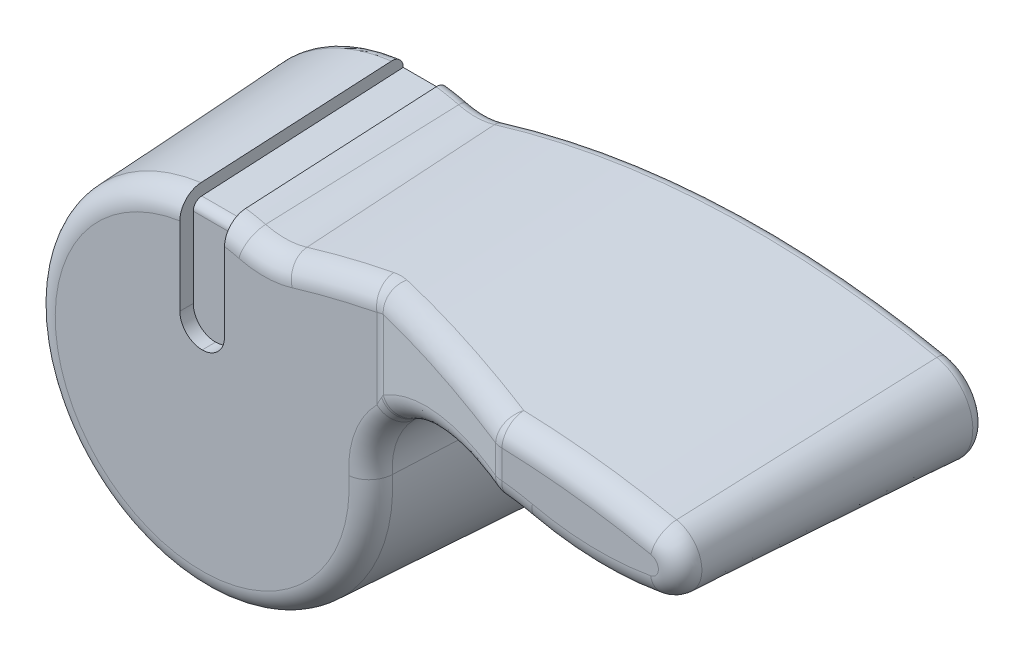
ISO-10303-21;
HEADER;
FILE_DESCRIPTION(('STEP AP214'),'2;1');
FILE_NAME('part.step','',(''),(''),'','','');
FILE_SCHEMA(('AUTOMOTIVE_DESIGN { 1 0 10303 214 1 1 1 1 }'));
ENDSEC;
DATA;
#1=APPLICATION_CONTEXT('core data for automotive mechanical design processes');
#2=APPLICATION_PROTOCOL_DEFINITION('international standard','automotive_design',2000,#1);
#3=PRODUCT_CONTEXT('',#1,'mechanical');
#4=PRODUCT('Part','Part','',(#3));
#5=PRODUCT_RELATED_PRODUCT_CATEGORY('part','',(#4));
#6=PRODUCT_DEFINITION_FORMATION('','',#4);
#7=PRODUCT_DEFINITION_CONTEXT('part definition',#1,'design');
#8=PRODUCT_DEFINITION('design','',#6,#7);
#9=PRODUCT_DEFINITION_SHAPE('','',#8);
#10=(LENGTH_UNIT() NAMED_UNIT(*) SI_UNIT(.MILLI.,.METRE.));
#11=(NAMED_UNIT(*) PLANE_ANGLE_UNIT() SI_UNIT($,.RADIAN.));
#12=(NAMED_UNIT(*) SI_UNIT($,.STERADIAN.) SOLID_ANGLE_UNIT());
#13=UNCERTAINTY_MEASURE_WITH_UNIT(LENGTH_MEASURE(1.E-05),#10,'distance_accuracy_value','');
#14=(GEOMETRIC_REPRESENTATION_CONTEXT(3) GLOBAL_UNCERTAINTY_ASSIGNED_CONTEXT((#13)) GLOBAL_UNIT_ASSIGNED_CONTEXT((#10,
#11,#12)) REPRESENTATION_CONTEXT('',''));
#15=CARTESIAN_POINT('',(0.,0.,0.));
#16=DIRECTION('',(0.,0.,1.));
#17=DIRECTION('',(1.,0.,0.));
#18=AXIS2_PLACEMENT_3D('',#15,#16,#17);
#19=CARTESIAN_POINT('',(0.,0.,1.));
#20=DIRECTION('',(0.,0.,-1.));
#21=DIRECTION('',(1.,0.,0.));
#22=AXIS2_PLACEMENT_3D('',#19,#20,#21);
#23=CONICAL_SURFACE('',#22,8.,0.05235987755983);
#24=CARTESIAN_POINT('',(0.,0.,9.05233595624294));
#25=DIRECTION('',(0.,0.,-1.));
#26=DIRECTION('',(-1.,0.,0.));
#27=AXIS2_PLACEMENT_3D('',#24,#25,#26);
#28=CIRCLE('',#27,7.57799495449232);
#29=CARTESIAN_POINT('',(7.56317970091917,0.473624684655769,9.05233595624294));
#30=VERTEX_POINT('',#29);
#31=CARTESIAN_POINT('',(-1.,7.51172467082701,9.05233595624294));
#32=VERTEX_POINT('',#31);
#33=EDGE_CURVE('E384',#30,#32,#28,.T.);
#34=ORIENTED_EDGE('',*,*,#33,.T.);
#35=CARTESIAN_POINT('',(-1.,7.1028422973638,16.7821753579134));
#36=CARTESIAN_POINT('',(-1.,7.23618383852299,14.2627004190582));
#37=CARTESIAN_POINT('',(-1.,7.36945410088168,11.7432217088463));
#38=CARTESIAN_POINT('',(-1.,7.63587076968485,6.70425774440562));
#39=CARTESIAN_POINT('',(-1.,7.76901717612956,4.18477249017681));
#40=CARTESIAN_POINT('',(-1.,8.0352048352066,-0.85420357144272));
#41=CARTESIAN_POINT('',(-1.,8.16824608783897,-3.37369437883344));
#42=CARTESIAN_POINT('',(-1.,8.43423720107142,-8.4126808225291));
#43=CARTESIAN_POINT('',(-1.,8.56718706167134,-10.932176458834));
#44=CARTESIAN_POINT('',(-1.,8.70009810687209,-13.4516741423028));
#45=B_SPLINE_CURVE_WITH_KNOTS('',3,(#35,#36,#37,#38,#39,#40,#41,#42,#43,#44),.UNSPECIFIED.,.F.,
.F.,(4,2,2,2,4),(0.,7.56900293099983,15.138005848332,22.707008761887,30.276011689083),.UNSPECIFIED.);
#46=CARTESIAN_POINT('',(-1.,7.96228210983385,0.526167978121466));
#47=VERTEX_POINT('',#46);
#48=EDGE_CURVE('E803',#32,#47,#45,.T.);
#49=ORIENTED_EDGE('',*,*,#48,.T.);
#50=CARTESIAN_POINT('',(0.,0.,0.526167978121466));
#51=DIRECTION('',(0.,0.,1.));
#52=DIRECTION('',(1.,0.,0.));
#53=AXIS2_PLACEMENT_3D('',#50,#51,#52);
#54=CIRCLE('',#53,8.02483248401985);
#55=CARTESIAN_POINT('',(8.00914364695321,0.50155203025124,0.526167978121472));
#56=VERTEX_POINT('',#55);
#57=EDGE_CURVE('E543',#47,#56,#54,.T.);
#58=ORIENTED_EDGE('',*,*,#57,.T.);
#59=DIRECTION('',(0.0522336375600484,0.00327099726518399,-0.998629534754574));
#60=VECTOR('',#59,1.);
#61=CARTESIAN_POINT('',(7.98435971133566,0.5,1.));
#62=LINE('',#61,#60);
#63=EDGE_CURVE('E757',#56,#30,#62,.F.);
#64=ORIENTED_EDGE('',*,*,#63,.T.);
#65=EDGE_LOOP('',(#34,#49,#58,#64));
#66=FACE_BOUND('',#65,.T.);
#67=ADVANCED_FACE('F14',(#66),#23,.T.);
#68=CARTESIAN_POINT('',(19.112378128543,-11.901978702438,0.));
#69=DIRECTION('',(0.,0.,-1.));
#70=DIRECTION('',(-1.,0.,0.));
#71=AXIS2_PLACEMENT_3D('',#68,#69,#70);
#72=PLANE('',#71);
#73=CARTESIAN_POINT('',(0.,0.,0.));
#74=DIRECTION('',(0.,0.,-1.));
#75=DIRECTION('',(-1.,0.,0.));
#76=AXIS2_PLACEMENT_3D('',#73,#74,#75);
#77=CIRCLE('',#76,7.52551771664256);
#78=CARTESIAN_POINT('',(7.51080505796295,0.470344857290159,0.));
#79=VERTEX_POINT('',#78);
#80=CARTESIAN_POINT('',(-1.,7.45878119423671,0.));
#81=VERTEX_POINT('',#80);
#82=EDGE_CURVE('E517',#79,#81,#77,.T.);
#83=ORIENTED_EDGE('',*,*,#82,.T.);
#84=DIRECTION('',(0.,1.,0.));
#85=VECTOR('',#84,1.);
#86=CARTESIAN_POINT('',(-1.,8.05240777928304,0.));
#87=LINE('',#86,#85);
#88=CARTESIAN_POINT('',(-1.,7.45158437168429,0.));
#89=VERTEX_POINT('',#88);
#90=EDGE_CURVE('E257',#89,#81,#87,.T.);
#91=ORIENTED_EDGE('',*,*,#90,.F.);
#92=DIRECTION('',(1.,0.,0.));
#93=VECTOR('',#92,1.);
#94=CARTESIAN_POINT('',(-1.,7.45158437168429,0.));
#95=LINE('',#94,#93);
#96=CARTESIAN_POINT('',(1.,7.45158437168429,0.));
#97=VERTEX_POINT('',#96);
#98=EDGE_CURVE('E258',#89,#97,#95,.T.);
#99=ORIENTED_EDGE('',*,*,#98,.T.);
#100=DIRECTION('',(0.,1.,0.));
#101=VECTOR('',#100,1.);
#102=CARTESIAN_POINT('',(1.,8.05240777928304,0.));
#103=LINE('',#102,#101);
#104=CARTESIAN_POINT('',(1.,7.45878119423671,0.));
#105=VERTEX_POINT('',#104);
#106=EDGE_CURVE('E246',#97,#105,#103,.T.);
#107=ORIENTED_EDGE('',*,*,#106,.T.);
#108=CARTESIAN_POINT('',(1.88137942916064,7.28655119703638,0.));
#109=VERTEX_POINT('',#108);
#110=EDGE_CURVE('E516',#105,#109,#77,.T.);
#111=ORIENTED_EDGE('',*,*,#110,.T.);
#112=CARTESIAN_POINT('',(2.75,10.6507042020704,0.));
#113=DIRECTION('',(0.,0.,-1.));
#114=DIRECTION('',(-1.,0.,0.));
#115=AXIS2_PLACEMENT_3D('',#112,#113,#114);
#116=CIRCLE('',#115,3.47448228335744);
#117=CARTESIAN_POINT('',(3.75798417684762,7.32564855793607,0.));
#118=VERTEX_POINT('',#117);
#119=EDGE_CURVE('E530',#109,#118,#116,.F.);
#120=ORIENTED_EDGE('',*,*,#119,.T.);
#121=CARTESIAN_POINT('',(15.224756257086,-30.5,0.));
#122=DIRECTION('',(0.,0.,-1.));
#123=DIRECTION('',(-1.,0.,0.));
#124=AXIS2_PLACEMENT_3D('',#121,#122,#123);
#125=CIRCLE('',#124,39.5255177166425);
#126=CARTESIAN_POINT('',(23.3121387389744,8.18928527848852,0.));
#127=VERTEX_POINT('',#126);
#128=EDGE_CURVE('E528',#118,#127,#125,.T.);
#129=ORIENTED_EDGE('',*,*,#128,.T.);
#130=CARTESIAN_POINT('',(23.,6.69604259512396,0.));
#131=DIRECTION('',(0.,0.,-1.));
#132=DIRECTION('',(-1.,0.,0.));
#133=AXIS2_PLACEMENT_3D('',#130,#131,#132);
#134=CIRCLE('',#133,1.52551771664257);
#135=CARTESIAN_POINT('',(23.2639321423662,5.19352999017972,0.));
#136=VERTEX_POINT('',#135);
#137=EDGE_CURVE('E526',#127,#136,#134,.T.);
#138=ORIENTED_EDGE('',*,*,#137,.T.);
#139=CARTESIAN_POINT('',(20.7508502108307,19.5,0.));
#140=DIRECTION('',(0.,0.,-1.));
#141=DIRECTION('',(-1.,0.,0.));
#142=AXIS2_PLACEMENT_3D('',#139,#140,#141);
#143=CIRCLE('',#142,14.5255177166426);
#144=CARTESIAN_POINT('',(17.5376704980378,5.3343323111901,0.));
#145=VERTEX_POINT('',#144);
#146=EDGE_CURVE('E524',#136,#145,#143,.T.);
#147=ORIENTED_EDGE('',*,*,#146,.T.);
#148=CARTESIAN_POINT('',(15.2206175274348,-4.88065886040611,0.));
#149=DIRECTION('',(0.,0.,-1.));
#150=DIRECTION('',(-1.,0.,0.));
#151=AXIS2_PLACEMENT_3D('',#148,#149,#150);
#152=CIRCLE('',#151,10.4744822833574);
#153=CARTESIAN_POINT('',(8.87289732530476,3.45128133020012,0.));
#154=VERTEX_POINT('',#153);
#155=EDGE_CURVE('E522',#145,#154,#152,.F.);
#156=ORIENTED_EDGE('',*,*,#155,.T.);
#157=CARTESIAN_POINT('',(10.9784946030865,0.6875,0.));
#158=DIRECTION('',(0.,0.,-1.));
#159=DIRECTION('',(-1.,0.,0.));
#160=AXIS2_PLACEMENT_3D('',#157,#158,#159);
#161=CIRCLE('',#160,3.47448228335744);
#162=EDGE_CURVE('E520',#154,#79,#161,.F.);
#163=ORIENTED_EDGE('',*,*,#162,.T.);
#164=EDGE_LOOP('',(#83,#91,#99,#107,#111,#120,#129,#138,#147,#156,#163));
#165=FACE_BOUND('',#164,.T.);
#166=ADVANCED_FACE('F346',(#165),#72,.T.);
#167=CARTESIAN_POINT('',(-7.52832998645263,-8.05240777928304,10.));
#168=DIRECTION('',(0.,0.,-1.));
#169=DIRECTION('',(-1.,0.,0.));
#170=AXIS2_PLACEMENT_3D('',#167,#168,#169);
#171=PLANE('',#170);
#172=DIRECTION('',(0.,-1.,0.));
#173=VECTOR('',#172,1.);
#174=CARTESIAN_POINT('',(-1.,6.57936541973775,10.));
#175=LINE('',#174,#173);
#176=CARTESIAN_POINT('',(-1.,6.50292621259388,10.));
#177=VERTEX_POINT('',#176);
#178=CARTESIAN_POINT('',(-1.,3.,10.));
#179=VERTEX_POINT('',#178);
#180=EDGE_CURVE('E229',#177,#179,#175,.T.);
#181=ORIENTED_EDGE('',*,*,#180,.F.);
#182=CARTESIAN_POINT('',(0.,0.,10.));
#183=DIRECTION('',(0.,0.,-1.));
#184=DIRECTION('',(-1.,0.,0.));
#185=AXIS2_PLACEMENT_3D('',#182,#183,#184);
#186=CIRCLE('',#185,6.57936541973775);
#187=CARTESIAN_POINT('',(6.56650252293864,0.411210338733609,10.));
#188=VERTEX_POINT('',#187);
#189=EDGE_CURVE('E744',#177,#188,#186,.F.);
#190=ORIENTED_EDGE('',*,*,#189,.T.);
#191=CARTESIAN_POINT('',(10.9784946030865,0.6875,10.));
#192=DIRECTION('',(0.,0.,-1.));
#193=DIRECTION('',(-1.,0.,0.));
#194=AXIS2_PLACEMENT_3D('',#191,#192,#193);
#195=CIRCLE('',#194,4.42063458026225);
#196=CARTESIAN_POINT('',(7.82367301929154,3.78412895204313,10.));
#197=VERTEX_POINT('',#196);
#198=EDGE_CURVE('E691',#188,#197,#195,.T.);
#199=ORIENTED_EDGE('',*,*,#198,.T.);
#200=DIRECTION('',(0.,1.,0.));
#201=VECTOR('',#200,1.);
#202=CARTESIAN_POINT('',(7.82367301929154,8.36247249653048,10.));
#203=LINE('',#202,#201);
#204=CARTESIAN_POINT('',(7.82367301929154,7.36279708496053,10.));
#205=VERTEX_POINT('',#204);
#206=EDGE_CURVE('E600',#197,#205,#203,.T.);
#207=ORIENTED_EDGE('',*,*,#206,.T.);
#208=CARTESIAN_POINT('',(15.224756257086,-30.5,10.));
#209=DIRECTION('',(0.,0.,-1.));
#210=DIRECTION('',(-1.,0.,0.));
#211=AXIS2_PLACEMENT_3D('',#208,#209,#210);
#212=CIRCLE('',#211,38.5793654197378);
#213=CARTESIAN_POINT('',(4.03247299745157,6.42018731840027,10.));
#214=VERTEX_POINT('',#213);
#215=EDGE_CURVE('E385',#205,#214,#212,.F.);
#216=ORIENTED_EDGE('',*,*,#215,.T.);
#217=CARTESIAN_POINT('',(2.75,10.6507042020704,10.));
#218=DIRECTION('',(0.,0.,-1.));
#219=DIRECTION('',(-1.,0.,0.));
#220=AXIS2_PLACEMENT_3D('',#217,#218,#219);
#221=CIRCLE('',#220,4.42063458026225);
#222=CARTESIAN_POINT('',(1.64484135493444,6.37044317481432,10.));
#223=VERTEX_POINT('',#222);
#224=EDGE_CURVE('E388',#214,#223,#221,.T.);
#225=ORIENTED_EDGE('',*,*,#224,.T.);
#226=CARTESIAN_POINT('',(1.,6.50292621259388,10.));
#227=VERTEX_POINT('',#226);
#228=EDGE_CURVE('E743',#223,#227,#186,.F.);
#229=ORIENTED_EDGE('',*,*,#228,.T.);
#230=DIRECTION('',(0.,-1.,0.));
#231=VECTOR('',#230,1.);
#232=CARTESIAN_POINT('',(1.,6.57936541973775,10.));
#233=LINE('',#232,#231);
#234=CARTESIAN_POINT('',(1.,3.,10.));
#235=VERTEX_POINT('',#234);
#236=EDGE_CURVE('E249',#227,#235,#233,.T.);
#237=ORIENTED_EDGE('',*,*,#236,.T.);
#238=CARTESIAN_POINT('',(0.,3.,10.));
#239=DIRECTION('',(0.,0.,-1.));
#240=DIRECTION('',(-1.,0.,0.));
#241=AXIS2_PLACEMENT_3D('',#238,#239,#240);
#242=CIRCLE('',#241,1.);
#243=CARTESIAN_POINT('',(0.,2.,10.));
#244=VERTEX_POINT('',#243);
#245=EDGE_CURVE('E9',#235,#244,#242,.T.);
#246=ORIENTED_EDGE('',*,*,#245,.T.);
#247=CARTESIAN_POINT('',(0.,3.,10.));
#248=DIRECTION('',(0.,0.,-1.));
#249=DIRECTION('',(-1.,0.,0.));
#250=AXIS2_PLACEMENT_3D('',#247,#248,#249);
#251=CIRCLE('',#250,1.);
#252=EDGE_CURVE('E23',#244,#179,#251,.T.);
#253=ORIENTED_EDGE('',*,*,#252,.T.);
#254=EDGE_LOOP('',(#181,#190,#199,#207,#216,#225,#229,#237,#246,#253));
#255=FACE_BOUND('',#254,.T.);
#256=ADVANCED_FACE('F351',(#255),#171,.F.);
#257=CARTESIAN_POINT('',(0.,0.,9.));
#258=DIRECTION('',(0.,0.,-1.));
#259=DIRECTION('',(-1.,0.,0.));
#260=AXIS2_PLACEMENT_3D('',#257,#258,#259);
#261=TOROIDAL_SURFACE('',#260,6.57936541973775,1.);
#262=ORIENTED_EDGE('',*,*,#189,.F.);
#263=CARTESIAN_POINT('',(-1.,5.55693761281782,9.35944288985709));
#264=CARTESIAN_POINT('',(-1.,5.57745409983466,9.41185727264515));
#265=CARTESIAN_POINT('',(-1.,5.60246318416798,9.46256060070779));
#266=CARTESIAN_POINT('',(-1.,5.66069391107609,9.55906870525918));
#267=CARTESIAN_POINT('',(-1.,5.69392665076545,9.60486674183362));
#268=CARTESIAN_POINT('',(-1.,5.76754856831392,9.69020904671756));
#269=CARTESIAN_POINT('',(-1.,5.8079297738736,9.72976018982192));
#270=CARTESIAN_POINT('',(-1.,5.89468308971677,9.80159762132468));
#271=CARTESIAN_POINT('',(-1.,5.94105376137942,9.83388564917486));
#272=CARTESIAN_POINT('',(-1.,6.03901398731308,9.89067285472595));
#273=CARTESIAN_POINT('',(-1.,6.09065452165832,9.91508409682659));
#274=CARTESIAN_POINT('',(-1.,6.19727627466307,9.95498903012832));
#275=CARTESIAN_POINT('',(-1.,6.25225782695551,9.97048182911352));
#276=CARTESIAN_POINT('',(-1.,6.36458051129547,9.99223808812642));
#277=CARTESIAN_POINT('',(-1.,6.42193951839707,9.99840937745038));
#278=CARTESIAN_POINT('',(-1.,6.53688163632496,10.0010503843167));
#279=CARTESIAN_POINT('',(-1.,6.59446475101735,9.99751993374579));
#280=CARTESIAN_POINT('',(-1.,6.70829908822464,9.98082171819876));
#281=CARTESIAN_POINT('',(-1.,6.76454837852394,9.96764076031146));
#282=CARTESIAN_POINT('',(-1.,6.87401334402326,9.93196633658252));
#283=CARTESIAN_POINT('',(-1.,6.92722909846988,9.90947311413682));
#284=CARTESIAN_POINT('',(-1.,7.02877054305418,9.85594066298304));
#285=CARTESIAN_POINT('',(-1.,7.07712336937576,9.82495292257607));
#286=CARTESIAN_POINT('',(-1.,7.16787509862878,9.75522637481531));
#287=CARTESIAN_POINT('',(-1.,7.21027428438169,9.71648793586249));
#288=CARTESIAN_POINT('',(-1.,7.28748382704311,9.63275317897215));
#289=CARTESIAN_POINT('',(-1.,7.32236247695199,9.58781983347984));
#290=CARTESIAN_POINT('',(-1.,7.38399826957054,9.49269061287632));
#291=CARTESIAN_POINT('',(-1.,7.41075583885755,9.44249501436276));
#292=CARTESIAN_POINT('',(-1.,7.45513941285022,9.33876122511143));
#293=CARTESIAN_POINT('',(-1.,7.47284666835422,9.28525779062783));
#294=CARTESIAN_POINT('',(-1.,7.49896728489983,9.1760286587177));
#295=CARTESIAN_POINT('',(-1.,7.50738100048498,9.12030304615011));
#296=CARTESIAN_POINT('',(-1.,7.51464080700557,9.00856414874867));
#297=CARTESIAN_POINT('',(-1.,7.51354316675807,8.95255451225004));
#298=CARTESIAN_POINT('',(-1.,7.50194766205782,8.84151772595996));
#299=CARTESIAN_POINT('',(-1.,7.4914499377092,8.78649056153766));
#300=CARTESIAN_POINT('',(-1.,7.4613838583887,8.67904362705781));
#301=CARTESIAN_POINT('',(-1.,7.44182612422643,8.62662088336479));
#302=CARTESIAN_POINT('',(-1.,7.39421947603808,8.52578558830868));
#303=CARTESIAN_POINT('',(-1.,7.36617046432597,8.47737308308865));
#304=CARTESIAN_POINT('',(-1.,7.30227615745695,8.3857259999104));
#305=CARTESIAN_POINT('',(-1.,7.2664015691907,8.34251185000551));
#306=CARTESIAN_POINT('',(-1.,7.18795763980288,8.26266217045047));
#307=CARTESIAN_POINT('',(-1.,7.14538806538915,8.22602687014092));
#308=CARTESIAN_POINT('',(-1.,7.05441126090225,8.16006161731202));
#309=CARTESIAN_POINT('',(-1.,7.00596091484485,8.13079113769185));
#310=CARTESIAN_POINT('',(-1.,6.90487007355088,8.08070987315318));
#311=CARTESIAN_POINT('',(-1.,6.85222936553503,8.05989951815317));
#312=CARTESIAN_POINT('',(-1.,6.74370641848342,8.02711741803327));
#313=CARTESIAN_POINT('',(-1.,6.68779769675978,8.01523333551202));
#314=CARTESIAN_POINT('',(-1.,6.57478200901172,8.00093580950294));
#315=CARTESIAN_POINT('',(-1.,6.51767498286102,7.99852284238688));
#316=CARTESIAN_POINT('',(-1.,6.40338378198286,8.00323357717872));
#317=CARTESIAN_POINT('',(-1.,6.34620283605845,8.01043588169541));
#318=CARTESIAN_POINT('',(-1.,6.2338512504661,8.03430903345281));
#319=CARTESIAN_POINT('',(-1.,6.17868067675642,8.05098019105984));
#320=CARTESIAN_POINT('',(-1.,6.07176595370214,8.09339670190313));
#321=CARTESIAN_POINT('',(-1.,6.0200317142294,8.11916705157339));
#322=CARTESIAN_POINT('',(-1.,5.92165509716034,8.17907392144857));
#323=CARTESIAN_POINT('',(-1.,5.87501264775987,8.21321032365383));
#324=CARTESIAN_POINT('',(-1.,5.7884471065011,8.28869915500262));
#325=CARTESIAN_POINT('',(-1.,5.74848768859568,8.33000990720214));
#326=CARTESIAN_POINT('',(-1.,5.67618447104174,8.41883003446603));
#327=CARTESIAN_POINT('',(-1.,5.64383982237,8.46633871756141));
#328=CARTESIAN_POINT('',(-1.,5.5881498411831,8.56553775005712));
#329=CARTESIAN_POINT('',(-1.,5.5646908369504,8.61716427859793));
#330=CARTESIAN_POINT('',(-1.,5.52691058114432,8.7236753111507));
#331=CARTESIAN_POINT('',(-1.,5.5125908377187,8.77856035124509));
#332=CARTESIAN_POINT('',(-1.,5.49369012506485,8.88919974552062));
#333=CARTESIAN_POINT('',(-1.,5.48897820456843,8.94493183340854));
#334=CARTESIAN_POINT('',(-1.,5.48905818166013,9.05634049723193));
#335=CARTESIAN_POINT('',(-1.,5.49383780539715,9.11201705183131));
#336=CARTESIAN_POINT('',(-1.,5.50892377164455,9.19975629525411));
#337=CARTESIAN_POINT('',(-1.,5.51625599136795,9.23235920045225));
#338=CARTESIAN_POINT('',(-1.,5.53417774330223,9.29665639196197));
#339=CARTESIAN_POINT('',(-1.,5.54476723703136,9.32835068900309));
#340=CARTESIAN_POINT('',(-1.,5.55693761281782,9.35944288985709));
#341=B_SPLINE_CURVE_WITH_KNOTS('',3,(#263,#264,#265,#266,#267,#268,#269,#270,#271,#272,#273,
#274,#275,#276,#277,#278,#279,#280,#281,#282,#283,#284,#285,#286,#287,#288,#289,#290,#291,#292,
#293,#294,#295,#296,#297,#298,#299,#300,#301,#302,#303,#304,#305,#306,#307,#308,#309,#310,#311,
#312,#313,#314,#315,#316,#317,#318,#319,#320,#321,#322,#323,#324,#325,#326,#327,#328,#329,#330,
#331,#332,#333,#334,#335,#336,#337,#338,#339,#340),.UNSPECIFIED.,.T.,.F.,(4,2,2,2,2,2,2,2,2,2,2,
2,2,2,2,2,2,2,2,2,2,2,2,2,2,2,2,2,2,2,2,2,2,2,2,2,2,2,4),(0.,0.168735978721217,
0.337700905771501,0.506478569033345,0.675215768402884,0.845776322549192,1.01635393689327,
1.18860742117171,1.36086389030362,1.53335628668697,1.70584417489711,1.8773088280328,
2.04876533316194,2.21859235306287,2.38841045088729,2.55667594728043,2.72493502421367,
2.89219936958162,3.05946122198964,3.22652749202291,3.39359568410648,3.5613003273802,
3.72901081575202,3.89803502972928,4.0670678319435,4.23773970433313,4.40842016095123,
4.58050446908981,4.75259441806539,4.92516084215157,5.09772483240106,5.26931799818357,
5.4408920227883,5.61019038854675,5.77951668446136,5.94651926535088,6.11330602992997,
6.21340135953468,6.31349550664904),.UNSPECIFIED.);
#342=EDGE_CURVE('E548',#177,#32,#341,.T.);
#343=ORIENTED_EDGE('',*,*,#342,.T.);
#344=ORIENTED_EDGE('',*,*,#33,.F.);
#345=CARTESIAN_POINT('',(6.56650252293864,0.411210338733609,9.));
#346=DIRECTION('',(0.0625,-0.998044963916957,0.));
#347=DIRECTION('',(0.998044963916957,0.0625,0.));
#348=AXIS2_PLACEMENT_3D('',#345,#346,#347);
#349=CIRCLE('',#348,1.);
#350=EDGE_CURVE('E441',#30,#188,#349,.T.);
#351=ORIENTED_EDGE('',*,*,#350,.T.);
#352=EDGE_LOOP('',(#262,#343,#344,#351));
#353=FACE_BOUND('',#352,.T.);
#354=ADVANCED_FACE('F795',(#353),#261,.T.);
#355=CARTESIAN_POINT('',(0.,0.,0.5));
#356=DIRECTION('',(0.,0.,-1.));
#357=DIRECTION('',(-1.,0.,0.));
#358=AXIS2_PLACEMENT_3D('',#355,#356,#357);
#359=TOROIDAL_SURFACE('',#358,7.52551771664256,0.5);
#360=ORIENTED_EDGE('',*,*,#57,.F.);
#361=CARTESIAN_POINT('',(-1.,7.10039775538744,0.147946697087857));
#362=CARTESIAN_POINT('',(-1.,7.08056245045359,0.167756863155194));
#363=CARTESIAN_POINT('',(-1.,7.06237442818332,0.189243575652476));
#364=CARTESIAN_POINT('',(-1.,7.02984069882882,0.234977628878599));
#365=CARTESIAN_POINT('',(-1.,7.01549919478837,0.259227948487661));
#366=CARTESIAN_POINT('',(-1.,6.99110291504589,0.309797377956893));
#367=CARTESIAN_POINT('',(-1.,6.98104770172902,0.336116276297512));
#368=CARTESIAN_POINT('',(-1.,6.96553090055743,0.39006833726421));
#369=CARTESIAN_POINT('',(-1.,6.96006817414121,0.417701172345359));
#370=CARTESIAN_POINT('',(-1.,6.95391616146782,0.473334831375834));
#371=CARTESIAN_POINT('',(-1.,6.95320005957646,0.501332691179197));
#372=CARTESIAN_POINT('',(-1.,6.95649201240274,0.557049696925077));
#373=CARTESIAN_POINT('',(-1.,6.96050013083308,0.584768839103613));
#374=CARTESIAN_POINT('',(-1.,6.97310257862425,0.639067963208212));
#375=CARTESIAN_POINT('',(-1.,6.98168507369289,0.665650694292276));
#376=CARTESIAN_POINT('',(-1.,7.00317220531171,0.717007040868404));
#377=CARTESIAN_POINT('',(-1.,7.01607689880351,0.741780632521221));
#378=CARTESIAN_POINT('',(-1.,7.04589405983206,0.788936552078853));
#379=CARTESIAN_POINT('',(-1.,7.06282377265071,0.811307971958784));
#380=CARTESIAN_POINT('',(-1.,7.10016808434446,0.852922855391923));
#381=CARTESIAN_POINT('',(-1.,7.1205828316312,0.872166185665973));
#382=CARTESIAN_POINT('',(-1.,7.16451166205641,0.907163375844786));
#383=CARTESIAN_POINT('',(-1.,7.18805181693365,0.92288450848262));
#384=CARTESIAN_POINT('',(-1.,7.2374186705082,0.950193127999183));
#385=CARTESIAN_POINT('',(-1.,7.26324548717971,0.961780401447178));
#386=CARTESIAN_POINT('',(-1.,7.31670331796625,0.980597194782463));
#387=CARTESIAN_POINT('',(-1.,7.34434850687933,0.987786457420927));
#388=CARTESIAN_POINT('',(-1.,7.40045150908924,0.997447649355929));
#389=CARTESIAN_POINT('',(-1.,7.42890934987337,0.99991941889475));
#390=CARTESIAN_POINT('',(-1.,7.48598112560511,1.0000770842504));
#391=CARTESIAN_POINT('',(-1.,7.51459513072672,0.997739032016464));
#392=CARTESIAN_POINT('',(-1.,7.57102406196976,0.988288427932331));
#393=CARTESIAN_POINT('',(-1.,7.59883898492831,0.981175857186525));
#394=CARTESIAN_POINT('',(-1.,7.65285035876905,0.962374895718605));
#395=CARTESIAN_POINT('',(-1.,7.67904820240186,0.950690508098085));
#396=CARTESIAN_POINT('',(-1.,7.72909440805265,0.923064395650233));
#397=CARTESIAN_POINT('',(-1.,7.75294283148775,0.907122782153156));
#398=CARTESIAN_POINT('',(-1.,7.79746099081,0.87153014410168));
#399=CARTESIAN_POINT('',(-1.,7.81814845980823,0.851901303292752));
#400=CARTESIAN_POINT('',(-1.,7.85590172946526,0.809424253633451));
#401=CARTESIAN_POINT('',(-1.,7.87296768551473,0.786576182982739));
#402=CARTESIAN_POINT('',(-1.,7.90284870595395,0.73850537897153));
#403=CARTESIAN_POINT('',(-1.,7.91569668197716,0.713303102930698));
#404=CARTESIAN_POINT('',(-1.,7.93694547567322,0.661088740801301));
#405=CARTESIAN_POINT('',(-1.,7.94534647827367,0.634076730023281));
#406=CARTESIAN_POINT('',(-1.,7.95740774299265,0.579209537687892));
#407=CARTESIAN_POINT('',(-1.,7.9611002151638,0.551361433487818));
#408=CARTESIAN_POINT('',(-1.,7.96374077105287,0.495441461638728));
#409=CARTESIAN_POINT('',(-1.,7.96268896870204,0.467369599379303));
#410=CARTESIAN_POINT('',(-1.,7.95588357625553,0.41189377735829));
#411=CARTESIAN_POINT('',(-1.,7.95014507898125,0.384487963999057));
#412=CARTESIAN_POINT('',(-1.,7.93415533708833,0.33102658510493));
#413=CARTESIAN_POINT('',(-1.,7.92390409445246,0.304971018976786));
#414=CARTESIAN_POINT('',(-1.,7.8991702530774,0.254902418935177));
#415=CARTESIAN_POINT('',(-1.,7.88468109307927,0.230892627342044));
#416=CARTESIAN_POINT('',(-1.,7.85189920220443,0.185628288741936));
#417=CARTESIAN_POINT('',(-1.,7.83360637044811,0.164373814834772));
#418=CARTESIAN_POINT('',(-1.,7.79362730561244,0.125089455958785));
#419=CARTESIAN_POINT('',(-1.,7.77192215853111,0.107078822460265));
#420=CARTESIAN_POINT('',(-1.,7.72581619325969,0.0749232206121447));
#421=CARTESIAN_POINT('',(-1.,7.70141526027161,0.0607784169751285));
#422=CARTESIAN_POINT('',(-1.,7.6504038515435,0.0366373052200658));
#423=CARTESIAN_POINT('',(-1.,7.6237774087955,0.0266747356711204));
#424=CARTESIAN_POINT('',(-1.,7.56923763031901,0.0113264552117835));
#425=CARTESIAN_POINT('',(-1.,7.54132429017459,0.00594076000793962));
#426=CARTESIAN_POINT('',(-1.,7.48479527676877,-0.000134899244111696));
#427=CARTESIAN_POINT('',(-1.,7.45617607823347,-0.00079208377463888));
#428=CARTESIAN_POINT('',(-1.,7.39922311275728,0.00269176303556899));
#429=CARTESIAN_POINT('',(-1.,7.37088942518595,0.00683409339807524));
#430=CARTESIAN_POINT('',(-1.,7.3152186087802,0.0198265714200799));
#431=CARTESIAN_POINT('',(-1.,7.28788537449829,0.0286933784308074));
#432=CARTESIAN_POINT('',(-1.,7.23512555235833,0.0508984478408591));
#433=CARTESIAN_POINT('',(-1.,7.20969673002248,0.064231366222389));
#434=CARTESIAN_POINT('',(-1.,7.17020807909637,0.0894113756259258));
#435=CARTESIAN_POINT('',(-1.,7.1553638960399,0.100050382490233));
#436=CARTESIAN_POINT('',(-1.,7.12691316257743,0.122871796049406));
#437=CARTESIAN_POINT('',(-1.,7.11330661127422,0.135054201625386));
#438=CARTESIAN_POINT('',(-1.,7.10039775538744,0.147946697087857));
#439=B_SPLINE_CURVE_WITH_KNOTS('',3,(#361,#362,#363,#364,#365,#366,#367,#368,#369,#370,#371,
#372,#373,#374,#375,#376,#377,#378,#379,#380,#381,#382,#383,#384,#385,#386,#387,#388,#389,#390,
#391,#392,#393,#394,#395,#396,#397,#398,#399,#400,#401,#402,#403,#404,#405,#406,#407,#408,#409,
#410,#411,#412,#413,#414,#415,#416,#417,#418,#419,#420,#421,#422,#423,#424,#425,#426,#427,#428,
#429,#430,#431,#432,#433,#434,#435,#436,#437,#438),.UNSPECIFIED.,.T.,.F.,(4,2,2,2,2,2,2,2,2,2,2,
2,2,2,2,2,2,2,2,2,2,2,2,2,2,2,2,2,2,2,2,2,2,2,2,2,2,2,4),(0.,0.0840349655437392,
0.168161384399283,0.252279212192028,0.336376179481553,0.419997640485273,0.503620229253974,
0.587027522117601,0.670435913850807,0.754208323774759,0.837984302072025,0.922509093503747,
1.00703824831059,1.09232999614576,1.17762463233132,1.26334497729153,1.34906566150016,
1.43471145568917,1.52035501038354,1.60549891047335,1.69063915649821,1.77509835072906,
1.85955403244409,1.94342881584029,2.02730158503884,2.11090531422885,2.19450900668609,
2.27824282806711,2.36197887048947,2.4461965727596,2.5304178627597,2.61530609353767,
2.70019461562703,2.78567104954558,2.87117062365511,2.95697369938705,3.04267447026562,
3.09736463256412,3.15205475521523),.UNSPECIFIED.);
#440=EDGE_CURVE('E298',#47,#81,#439,.T.);
#441=ORIENTED_EDGE('',*,*,#440,.T.);
#442=ORIENTED_EDGE('',*,*,#82,.F.);
#443=CARTESIAN_POINT('',(7.51080505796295,0.470344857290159,0.5));
#444=DIRECTION('',(0.0625,-0.998044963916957,0.));
#445=DIRECTION('',(0.998044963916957,0.0625,0.));
#446=AXIS2_PLACEMENT_3D('',#443,#444,#445);
#447=CIRCLE('',#446,0.5);
#448=EDGE_CURVE('E550',#79,#56,#447,.T.);
#449=ORIENTED_EDGE('',*,*,#448,.T.);
#450=EDGE_LOOP('',(#360,#441,#442,#449));
#451=FACE_BOUND('',#450,.T.);
#452=ADVANCED_FACE('F314',(#451),#359,.T.);
#453=CARTESIAN_POINT('',(15.224756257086,-30.5,1.));
#454=DIRECTION('',(0.,0.,-1.));
#455=DIRECTION('',(-1.,0.,0.));
#456=AXIS2_PLACEMENT_3D('',#453,#454,#455);
#457=CONICAL_SURFACE('',#456,40.,0.05235987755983);
#458=DIRECTION('',(0.0107085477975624,0.0512286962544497,-0.998629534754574));
#459=VECTOR('',#458,1.);
#460=CARTESIAN_POINT('',(23.4092233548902,8.65372904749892,1.));
#461=LINE('',#460,#459);
#462=CARTESIAN_POINT('',(23.4143043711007,8.67803615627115,0.526167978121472));
#463=VERTEX_POINT('',#462);
#464=CARTESIAN_POINT('',(23.2907064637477,8.08675526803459,12.0523359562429));
#465=VERTEX_POINT('',#464);
#466=EDGE_CURVE('E584',#463,#465,#461,.F.);
#467=ORIENTED_EDGE('',*,*,#466,.F.);
#468=CARTESIAN_POINT('',(15.224756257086,-30.5,0.526167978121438));
#469=DIRECTION('',(0.,0.,1.));
#470=DIRECTION('',(1.,0.,0.));
#471=AXIS2_PLACEMENT_3D('',#468,#469,#470);
#472=CIRCLE('',#471,40.0248324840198);
#473=CARTESIAN_POINT('',(3.61312766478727,7.80348935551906,0.526167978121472));
#474=VERTEX_POINT('',#473);
#475=EDGE_CURVE('E533',#463,#474,#472,.T.);
#476=ORIENTED_EDGE('',*,*,#475,.T.);
#477=DIRECTION('',(-0.0151832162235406,0.0500851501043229,-0.998629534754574));
#478=VECTOR('',#477,1.);
#479=CARTESIAN_POINT('',(3.62033183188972,7.77972483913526,1.));
#480=LINE('',#479,#478);
#481=CARTESIAN_POINT('',(3.74275997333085,7.37586891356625,9.05233595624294));
#482=VERTEX_POINT('',#481);
#483=EDGE_CURVE('E766',#474,#482,#480,.F.);
#484=ORIENTED_EDGE('',*,*,#483,.T.);
#485=CARTESIAN_POINT('',(15.224756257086,-30.5,9.05233595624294));
#486=DIRECTION('',(0.,0.,-1.));
#487=DIRECTION('',(-1.,0.,0.));
#488=AXIS2_PLACEMENT_3D('',#485,#486,#487);
#489=CIRCLE('',#488,39.5779949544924);
#490=CARTESIAN_POINT('',(7.63209546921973,8.34287819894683,9.05233595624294));
#491=VERTEX_POINT('',#490);
#492=EDGE_CURVE('E603',#482,#491,#489,.T.);
#493=ORIENTED_EDGE('',*,*,#492,.T.);
#494=CARTESIAN_POINT('',(8.9269987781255,8.54990539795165,9.50103458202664));
#495=CARTESIAN_POINT('',(8.39345004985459,8.42811203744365,10.1743987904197));
#496=CARTESIAN_POINT('',(8.45483544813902,7.56401481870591,10.2243493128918));
#497=CARTESIAN_POINT('',(8.83806932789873,8.53932691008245,9.43036561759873));
#498=CARTESIAN_POINT('',(8.34052784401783,8.42032204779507,10.136884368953));
#499=CARTESIAN_POINT('',(8.41148589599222,7.55379572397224,10.1890148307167));
#500=CARTESIAN_POINT('',(8.74312200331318,8.52704593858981,9.36725342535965));
#501=CARTESIAN_POINT('',(8.28395207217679,8.41150271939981,10.1046578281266));
#502=CARTESIAN_POINT('',(8.36520381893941,7.54190714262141,10.1574587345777));
#503=CARTESIAN_POINT('',(8.54438869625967,8.49934731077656,9.25751758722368));
#504=CARTESIAN_POINT('',(8.16611083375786,8.39223222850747,10.0514323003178));
#505=CARTESIAN_POINT('',(8.26833315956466,7.51505077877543,10.1025908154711));
#506=CARTESIAN_POINT('',(8.44062424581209,8.48393717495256,9.21085512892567));
#507=CARTESIAN_POINT('',(8.10473848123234,8.38176150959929,10.0304170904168));
#508=CARTESIAN_POINT('',(8.21775506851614,7.50009037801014,10.0792595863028));
#509=CARTESIAN_POINT('',(8.22124861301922,8.44928707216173,9.13300416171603));
#510=CARTESIAN_POINT('',(7.97617954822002,8.358941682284,9.99950365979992));
#511=CARTESIAN_POINT('',(8.11082636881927,7.46641609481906,10.0403341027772));
#512=CARTESIAN_POINT('',(8.10530036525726,8.42988549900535,9.10278477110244));
#513=CARTESIAN_POINT('',(7.90874417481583,8.34649530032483,9.99033099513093));
#514=CARTESIAN_POINT('',(8.05431156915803,7.44754341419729,10.0252244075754));
#515=CARTESIAN_POINT('',(7.87019458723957,8.38830750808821,9.06244091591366));
#516=CARTESIAN_POINT('',(7.77415996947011,8.32076749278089,9.98526619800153));
#517=CARTESIAN_POINT('',(7.93972000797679,7.40706700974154,10.0050524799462));
#518=CARTESIAN_POINT('',(7.75103481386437,8.36612910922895,9.05233088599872));
#519=CARTESIAN_POINT('',(7.70689311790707,8.30745504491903,9.98949580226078));
#520=CARTESIAN_POINT('',(7.88164215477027,7.38546133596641,9.99999746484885));
#521=CARTESIAN_POINT('',(7.5139418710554,8.31978089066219,9.05234099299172));
#522=CARTESIAN_POINT('',(7.57609880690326,8.28076442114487,10.0105451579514));
#523=CARTESIAN_POINT('',(7.76608684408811,7.34028256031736,10.0000025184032));
#524=CARTESIAN_POINT('',(7.39600579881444,8.29562519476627,9.06232792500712));
#525=CARTESIAN_POINT('',(7.51247281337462,8.26736289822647,10.0274323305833));
#526=CARTESIAN_POINT('',(7.70860795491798,7.31672339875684,10.0049959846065));
#527=CARTESIAN_POINT('',(7.16384416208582,8.24595640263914,9.1017038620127));
#528=CARTESIAN_POINT('',(7.39088777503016,8.24106771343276,10.0722038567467));
#529=CARTESIAN_POINT('',(7.59546141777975,7.26825688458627,10.0246839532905));
#530=CARTESIAN_POINT('',(7.04961988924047,8.22044284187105,9.13109954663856));
#531=CARTESIAN_POINT('',(7.33292007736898,8.2281630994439,10.1002569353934));
#532=CARTESIAN_POINT('',(7.53979440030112,7.24334907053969,10.0393817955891));
#533=CARTESIAN_POINT('',(6.93893156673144,8.19463875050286,9.16991501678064));
#534=CARTESIAN_POINT('',(7.27956436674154,8.21597141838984,10.1328307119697));
#535=CARTESIAN_POINT('',(7.485852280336,7.21814597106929,10.0587895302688));
#536=(BOUNDED_SURFACE() B_SPLINE_SURFACE(3,2,((#494,#495,#496),(#497,#498,#499),(#500,#501,
#502),(#503,#504,#505),(#506,#507,#508),(#509,#510,#511),(#512,#513,#514),(#515,#516,#517),
(#518,#519,#520),(#521,#522,#523),(#524,#525,#526),(#527,#528,#529),(#530,#531,#532),(#533,#534,
#535)),.UNSPECIFIED.,.F.,.F.,.F.) B_SPLINE_SURFACE_WITH_KNOTS((4,2,2,2,2,2,4),(3,3),(0.,
0.336438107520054,0.672077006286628,1.02579879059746,1.37977438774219,1.73141152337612,
2.08316974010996),(0.,1.),
.UNSPECIFIED.) GEOMETRIC_REPRESENTATION_ITEM() RATIONAL_B_SPLINE_SURFACE(((1.,0.755297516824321,
1.),(1.,0.754097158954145,1.),(1.,0.752604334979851,1.),(1.,0.749020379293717,1.),(1.,
0.746930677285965,1.),(1.,0.742004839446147,1.),(1.,0.739134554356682,1.),(1.,0.73273363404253,
1.),(1.,0.729202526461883,1.),(1.,0.721571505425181,1.),(1.,0.717475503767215,1.),(1.,
0.708813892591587,1.),(1.,0.704248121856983,1.),(1.,0.699507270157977,1.))) REPRESENTATION_ITEM('') SURFACE());
#537=CARTESIAN_POINT('',(6.93893156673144,8.19463875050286,9.16991501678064));
#538=CARTESIAN_POINT('',(7.04961988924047,8.22044284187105,9.13109954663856));
#539=CARTESIAN_POINT('',(7.16384416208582,8.24595640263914,9.1017038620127));
#540=CARTESIAN_POINT('',(7.39600579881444,8.29562519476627,9.06232792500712));
#541=CARTESIAN_POINT('',(7.5139418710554,8.31978089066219,9.05234099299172));
#542=CARTESIAN_POINT('',(7.75103481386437,8.36612910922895,9.05233088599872));
#543=CARTESIAN_POINT('',(7.87019458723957,8.38830750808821,9.06244091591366));
#544=CARTESIAN_POINT('',(8.10530036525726,8.42988549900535,9.10278477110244));
#545=CARTESIAN_POINT('',(8.22124861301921,8.44928707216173,9.13300416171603));
#546=CARTESIAN_POINT('',(8.44062424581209,8.48393717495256,9.21085512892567));
#547=CARTESIAN_POINT('',(8.54438869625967,8.49934731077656,9.25751758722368));
#548=CARTESIAN_POINT('',(8.74312200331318,8.52704593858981,9.36725342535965));
#549=CARTESIAN_POINT('',(8.83806932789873,8.53932691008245,9.43036561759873));
#550=CARTESIAN_POINT('',(8.9269987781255,8.54990539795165,9.50103458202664));
#551=B_SPLINE_CURVE_WITH_KNOTS('',3,(#537,#538,#539,#540,#541,#542,#543,#544,#545,#546,#547,
#548,#549,#550),.UNSPECIFIED.,.F.,.F.,(4,2,2,2,2,2,4),(0.,0.351758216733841,0.703395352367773,
1.0573709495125,1.41109273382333,1.74673163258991,2.08316974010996),.UNSPECIFIED.);
#552=CARTESIAN_POINT('',(8.33381369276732,8.46706658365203,9.17295071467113));
#553=VERTEX_POINT('',#552);
#554=EDGE_CURVE('E605',#491,#553,#551,.T.);
#555=ORIENTED_EDGE('',*,*,#554,.T.);
#556=CARTESIAN_POINT('',(-24.3097735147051,-30.5,-1.75979583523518));
#557=CARTESIAN_POINT('',(-24.9317424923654,-30.5,-1.98617402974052));
#558=CARTESIAN_POINT('',(-24.966382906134,-30.5,-2.64715249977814));
#559=CARTESIAN_POINT('',(-24.3097735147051,-28.8215910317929,-1.75979583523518));
#560=CARTESIAN_POINT('',(-24.9317424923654,-28.7908456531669,-1.98617402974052));
#561=CARTESIAN_POINT('',(-24.966382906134,-28.7788249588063,-2.64715249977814));
#562=CARTESIAN_POINT('',(-24.1996182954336,-27.1431820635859,-1.71970261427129));
#563=CARTESIAN_POINT('',(-24.8201123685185,-27.0805344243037,-1.94554398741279));
#564=CARTESIAN_POINT('',(-24.8534749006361,-27.0576499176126,-2.60705927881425));
#565=CARTESIAN_POINT('',(-23.7613956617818,-23.8151295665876,-1.5602026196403));
#566=CARTESIAN_POINT('',(-24.3765897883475,-23.6911090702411,-1.78411497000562));
#567=CARTESIAN_POINT('',(-24.404295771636,-23.6447573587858,-2.44755928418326));
#568=CARTESIAN_POINT('',(-23.4328404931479,-22.165558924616,-1.44061831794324));
#569=CARTESIAN_POINT('',(-24.0436067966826,-22.0098372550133,-1.66291907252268));
#570=CARTESIAN_POINT('',(-24.0675246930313,-21.9531144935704,-2.3279749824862));
#571=CARTESIAN_POINT('',(-22.5639289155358,-18.9233016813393,-1.12436036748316));
#572=CARTESIAN_POINT('',(-23.1640425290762,-18.7065703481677,-1.34278385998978));
#573=CARTESIAN_POINT('',(-23.1768677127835,-18.6280840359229,-2.01171703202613));
#574=CARTESIAN_POINT('',(-22.0226667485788,-17.3308905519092,-0.927357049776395));
#575=CARTESIAN_POINT('',(-22.6153897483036,-17.0828629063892,-1.14309057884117));
#576=CARTESIAN_POINT('',(-22.6220533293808,-16.9949785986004,-1.81471371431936));
#577=CARTESIAN_POINT('',(-20.7379973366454,-14.2299659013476,-0.459775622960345));
#578=CARTESIAN_POINT('',(-21.3146120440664,-13.9215654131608,-0.669646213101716));
#579=CARTESIAN_POINT('',(-21.3051830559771,-13.8146941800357,-1.34713228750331));
#580=CARTESIAN_POINT('',(-19.9933906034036,-12.722016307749,-0.188760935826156));
#581=CARTESIAN_POINT('',(-20.5596339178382,-12.382934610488,-0.394856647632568));
#582=CARTESIAN_POINT('',(-20.5418974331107,-12.2680928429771,-1.07611760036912));
#583=CARTESIAN_POINT('',(-18.3150237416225,-9.81550893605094,0.422114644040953));
#584=CARTESIAN_POINT('',(-18.8595555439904,-9.41701171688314,0.223921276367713));
#585=CARTESIAN_POINT('',(-18.8213701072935,-9.28693896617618,-0.465242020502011));
#586=CARTESIAN_POINT('',(-17.3799235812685,-8.41782926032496,0.762463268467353));
#587=CARTESIAN_POINT('',(-17.9110757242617,-7.98948832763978,0.569139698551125));
#588=CARTESIAN_POINT('',(-17.8627543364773,-7.85328596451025,-0.12489339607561));
#589=CARTESIAN_POINT('',(-15.3366569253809,-5.75546033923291,1.5061515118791));
#590=CARTESIAN_POINT('',(-15.8403096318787,-5.26904695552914,1.32283691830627));
#591=CARTESIAN_POINT('',(-15.768020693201,-5.12221842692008,0.618794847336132));
#592=CARTESIAN_POINT('',(-14.22716339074,-4.4919267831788,1.90997413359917));
#593=CARTESIAN_POINT('',(-14.7143907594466,-3.97674963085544,1.73263787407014));
#594=CARTESIAN_POINT('',(-14.6305417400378,-3.82598792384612,1.02261746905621));
#595=CARTESIAN_POINT('',(-11.8540256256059,-2.1192076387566,2.77372564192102));
#596=CARTESIAN_POINT('',(-12.3077541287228,-1.5477707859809,2.60858197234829));
#597=CARTESIAN_POINT('',(-12.1974337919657,-1.39166934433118,1.88636897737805));
#598=CARTESIAN_POINT('',(-10.5891966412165,-1.0113666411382,3.23408574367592));
#599=CARTESIAN_POINT('',(-11.0234085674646,-0.412518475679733,3.07604552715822));
#600=CARTESIAN_POINT('',(-10.90058925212,-0.254959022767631,2.34672907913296));
#601=CARTESIAN_POINT('',(-7.9268395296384,1.03117085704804,4.20310448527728));
#602=CARTESIAN_POINT('',(-8.32132796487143,1.68389284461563,4.05952243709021));
#603=CARTESIAN_POINT('',(-8.17070351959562,1.84102858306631,3.31574782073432));
#604=CARTESIAN_POINT('',(-6.52835763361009,1.9644567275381,4.71211026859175));
#605=CARTESIAN_POINT('',(-6.90018894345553,2.64292341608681,4.5767747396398));
#606=CARTESIAN_POINT('',(-6.73668334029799,2.79886021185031,3.82475360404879));
#607=CARTESIAN_POINT('',(-3.62235190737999,3.64194132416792,5.76980985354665));
#608=CARTESIAN_POINT('',(-3.94801499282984,4.37119865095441,5.65127818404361));
#609=CARTESIAN_POINT('',(-3.75666578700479,4.5207139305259,4.88245318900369));
#610=CARTESIAN_POINT('',(-2.11414628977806,4.38479995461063,6.31875180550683));
#611=CARTESIAN_POINT('',(-2.41396851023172,5.13776722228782,6.2096254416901));
#612=CARTESIAN_POINT('',(-2.20996817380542,5.28336239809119,5.43139514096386));
#613=CARTESIAN_POINT('',(0.98578486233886,5.66860861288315,7.44703447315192));
#614=CARTESIAN_POINT('',(0.738769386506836,6.46844000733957,7.35712819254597));
#615=CARTESIAN_POINT('',(0.969264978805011,6.60166279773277,6.55967780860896));
#616=CARTESIAN_POINT('',(2.57792580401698,6.20842042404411,8.02652638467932));
#617=CARTESIAN_POINT('',(2.3599622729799,7.02949239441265,7.94719414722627));
#618=CARTESIAN_POINT('',(2.60222755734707,7.15614779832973,7.13916972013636));
#619=CARTESIAN_POINT('',(5.81880604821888,7.07664784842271,9.2061103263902));
#620=CARTESIAN_POINT('',(5.66041200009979,7.93964749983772,9.14845960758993));
#621=CARTESIAN_POINT('',(5.92640585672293,8.04834399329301,8.31875366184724));
#622=CARTESIAN_POINT('',(7.46774041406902,7.40423789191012,9.80627335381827));
#623=CARTESIAN_POINT('',(7.34159008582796,8.28549849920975,9.76035838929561));
#624=CARTESIAN_POINT('',(7.61782242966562,8.38520860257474,8.9189166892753));
#625=CARTESIAN_POINT('',(10.7940473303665,7.84210116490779,11.0169500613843));
#626=CARTESIAN_POINT('',(10.73426906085,8.75915421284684,10.9951925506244));
#627=CARTESIAN_POINT('',(11.0300409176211,8.83603826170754,10.1295933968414));
#628=CARTESIAN_POINT('',(12.4714699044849,7.95194102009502,11.6274819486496));
#629=CARTESIAN_POINT('',(12.4470693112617,8.88367688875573,11.618600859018));
#630=CARTESIAN_POINT('',(12.7508945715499,8.94955880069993,10.7401252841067));
#631=CARTESIAN_POINT('',(15.8268047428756,7.95188608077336,12.8487239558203));
#632=CARTESIAN_POINT('',(15.8753890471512,8.91189572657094,12.8664071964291));
#633=CARTESIAN_POINT('',(16.1933229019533,8.95116398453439,11.9613672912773));
#634=CARTESIAN_POINT('',(17.5047170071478,7.84199128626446,13.4594340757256));
#635=CARTESIAN_POINT('',(17.591599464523,8.81243690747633,13.49105670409));
#636=CARTESIAN_POINT('',(17.9148975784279,8.83924862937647,12.5720774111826));
#637=CARTESIAN_POINT('',(20.0000212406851,7.51358636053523,14.3676505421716));
#638=CARTESIAN_POINT('',(20.1370257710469,8.49955089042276,14.4175161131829));
#639=CARTESIAN_POINT('',(20.4752952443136,8.50352627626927,13.4802938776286));
#640=CARTESIAN_POINT('',(20.8276203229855,7.37701113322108,14.668871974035));
#641=CARTESIAN_POINT('',(20.9847592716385,8.36693440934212,14.7260658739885));
#642=CARTESIAN_POINT('',(21.3245103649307,8.36380119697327,13.781515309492));
#643=CARTESIAN_POINT('',(22.4732761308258,7.04978686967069,15.2678417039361));
#644=CARTESIAN_POINT('',(22.6714543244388,8.04669207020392,15.3399726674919));
#645=CARTESIAN_POINT('',(23.013201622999,8.02885372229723,14.3804850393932));
#646=CARTESIAN_POINT('',(23.2913347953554,6.85914902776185,15.5655907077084));
#647=CARTESIAN_POINT('',(23.5103686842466,7.85866210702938,15.6453125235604));
#648=CARTESIAN_POINT('',(23.8526797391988,7.83364281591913,14.6782340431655));
#649=CARTESIAN_POINT('',(24.9117860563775,6.42503426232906,16.1553867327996));
#650=CARTESIAN_POINT('',(25.1731823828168,7.42870355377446,16.2505272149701));
#651=CARTESIAN_POINT('',(25.5156109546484,7.38898267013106,15.2680300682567));
#652=CARTESIAN_POINT('',(25.7142247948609,6.1817519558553,16.4474505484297));
#653=CARTESIAN_POINT('',(25.9970459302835,7.18655967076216,16.5503890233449));
#654=CARTESIAN_POINT('',(26.3391112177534,7.13973319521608,15.5600938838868));
#655=CARTESIAN_POINT('',(27.3031761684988,5.64259660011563,17.0257815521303));
#656=CARTESIAN_POINT('',(27.6295772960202,6.6484977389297,17.144581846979));
#657=CARTESIAN_POINT('',(27.9698168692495,6.58724604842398,16.1384248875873));
#658=CARTESIAN_POINT('',(28.0896921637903,5.34673477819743,17.3120499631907));
#659=CARTESIAN_POINT('',(28.4380974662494,6.3521936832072,17.4388591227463));
#660=CARTESIAN_POINT('',(28.7770256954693,6.28401990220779,16.4246932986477));
#661=CARTESIAN_POINT('',(29.639665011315,4.70483231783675,17.8761939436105));
#662=CARTESIAN_POINT('',(30.0326305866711,5.70809899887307,18.0192217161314));
#663=CARTESIAN_POINT('',(30.3678245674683,5.62604675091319,16.9888372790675));
#664=CARTESIAN_POINT('',(30.4032215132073,4.35906423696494,18.1541057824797));
#665=CARTESIAN_POINT('',(30.8185693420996,5.36020031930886,18.3052800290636));
#666=CARTESIAN_POINT('',(31.1515166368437,5.27157957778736,17.2667491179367));
#667=CARTESIAN_POINT('',(31.9082337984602,3.61718603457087,18.7018854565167));
#668=CARTESIAN_POINT('',(32.3689825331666,4.6125981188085,18.8695842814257));
#669=CARTESIAN_POINT('',(32.6962615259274,4.51095367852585,17.8145287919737));
#670=CARTESIAN_POINT('',(32.6496944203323,3.2210870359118,18.9717550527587));
#671=CARTESIAN_POINT('',(33.1332101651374,4.21255653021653,19.1477403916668));
#672=CARTESIAN_POINT('',(33.4573193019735,4.10480637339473,18.0843983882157));
#673=CARTESIAN_POINT('',(34.102700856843,2.38234600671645,19.5006061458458));
#674=CARTESIAN_POINT('',(34.6321309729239,3.36436291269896,19.6933029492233));
#675=CARTESIAN_POINT('',(34.9487708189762,3.24471196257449,18.6132494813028));
#676=CARTESIAN_POINT('',(34.8144112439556,1.94002695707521,19.7596475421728));
#677=CARTESIAN_POINT('',(35.3667228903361,2.91621308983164,19.9606725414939));
#678=CARTESIAN_POINT('',(35.6793332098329,2.79109653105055,18.8722908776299));
#679=CARTESIAN_POINT('',(36.209735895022,1.00809773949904,20.2675041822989));
#680=CARTESIAN_POINT('',(36.8082666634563,1.9708686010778,20.4853515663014));
#681=CARTESIAN_POINT('',(37.1116557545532,1.83529650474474,19.3801475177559));
#682=CARTESIAN_POINT('',(36.8933565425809,0.518498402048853,20.5163217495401));
#683=CARTESIAN_POINT('',(37.5148802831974,1.47341583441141,20.7425378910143));
#684=CARTESIAN_POINT('',(37.8134224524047,1.33312303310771,19.6289650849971));
#685=CARTESIAN_POINT('',(38.224540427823,-0.502769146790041,21.0008330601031));
#686=CARTESIAN_POINT('',(38.8921784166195,0.434625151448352,21.2438334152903));
#687=CARTESIAN_POINT('',(39.1799761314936,0.285560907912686,20.1134763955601));
#688=CARTESIAN_POINT('',(38.8723344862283,-1.03409651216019,21.2366108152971));
#689=CARTESIAN_POINT('',(39.5627444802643,-0.106600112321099,21.4878995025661));
#690=CARTESIAN_POINT('',(39.844999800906,-0.259477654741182,20.3492541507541));
#691=CARTESIAN_POINT('',(40.1340955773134,-2.1401551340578,21.6958542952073));
#692=CARTESIAN_POINT('',(40.8702229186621,-1.23447857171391,21.9637827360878));
#693=CARTESIAN_POINT('',(41.1403515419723,-1.3941402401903,20.8084976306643));
#694=CARTESIAN_POINT('',(40.748070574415,-2.71487609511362,21.919322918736));
#695=CARTESIAN_POINT('',(41.5067228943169,-1.82127846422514,22.1954497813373));
#696=CARTESIAN_POINT('',(41.7706877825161,-1.98375368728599,21.031966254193));
#697=CARTESIAN_POINT('',(41.9346453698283,-3.90123510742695,22.3512008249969));
#698=CARTESIAN_POINT('',(42.7381377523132,-3.03381894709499,22.6436481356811));
#699=CARTESIAN_POINT('',(42.9889100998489,-3.20091210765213,21.463844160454));
#700=CARTESIAN_POINT('',(42.5075319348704,-4.51254822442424,22.5597144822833));
#701=CARTESIAN_POINT('',(43.3329256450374,-3.65933864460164,22.8601332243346));
#702=CARTESIAN_POINT('',(43.5770903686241,-3.82812327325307,21.6723578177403));
#703=CARTESIAN_POINT('',(43.6141302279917,-5.77383397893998,22.9624833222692));
#704=CARTESIAN_POINT('',(44.4831107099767,-4.95126861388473,23.2787663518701));
#705=CARTESIAN_POINT('',(44.713254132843,-5.12226425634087,22.0751266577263));
#706=CARTESIAN_POINT('',(44.1478514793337,-6.42379714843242,23.156741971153));
#707=CARTESIAN_POINT('',(45.0380491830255,-5.61768728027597,23.480747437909));
#708=CARTESIAN_POINT('',(45.2612473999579,-5.78918434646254,22.2693853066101));
#709=CARTESIAN_POINT('',(45.1694871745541,-7.75497660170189,23.5285869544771));
#710=CARTESIAN_POINT('',(46.1014896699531,-6.98392918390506,23.8678081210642));
#711=CARTESIAN_POINT('',(46.3102225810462,-7.15514299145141,22.6412302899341));
#712=CARTESIAN_POINT('',(45.6577225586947,-8.43591384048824,23.7062901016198));
#713=CARTESIAN_POINT('',(46.6098646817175,-7.68342785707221,24.0528414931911));
#714=CARTESIAN_POINT('',(46.8115338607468,-7.853894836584,22.8189334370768));
#715=CARTESIAN_POINT('',(46.5902060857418,-9.83086295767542,24.0456863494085));
#716=CARTESIAN_POINT('',(47.5819292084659,-9.11782625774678,24.4066440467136));
#717=CARTESIAN_POINT('',(47.7690079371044,-9.28538415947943,23.1583296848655));
#718=CARTESIAN_POINT('',(47.0344644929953,-10.5448670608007,24.2073831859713));
#719=CARTESIAN_POINT('',(48.0451508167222,-9.85257912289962,24.5752429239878));
#720=CARTESIAN_POINT('',(48.2251812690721,-10.0181136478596,23.3200265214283));
#721=CARTESIAN_POINT('',(47.8736093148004,-11.9980442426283,24.512806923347));
#722=CARTESIAN_POINT('',(48.9211091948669,-11.3494112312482,24.8940657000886));
#723=CARTESIAN_POINT('',(49.0868453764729,-11.5094432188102,23.625450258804));
#724=CARTESIAN_POINT('',(48.2688237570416,-12.7370027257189,24.6566532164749));
#725=CARTESIAN_POINT('',(49.3337326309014,-12.1110675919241,25.0442483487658));
#726=CARTESIAN_POINT('',(49.4926728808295,-12.26782278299,23.7692965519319));
#727=CARTESIAN_POINT('',(49.0112225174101,-14.2417512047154,24.9268642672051));
#728=CARTESIAN_POINT('',(50.1097133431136,-13.6634808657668,25.3266822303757));
#729=CARTESIAN_POINT('',(50.2550184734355,-13.812155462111,24.0395076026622));
#730=CARTESIAN_POINT('',(49.3584079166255,-15.0075405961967,25.0532294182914));
#731=CARTESIAN_POINT('',(50.4726281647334,-14.4539375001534,25.4587724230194));
#732=CARTESIAN_POINT('',(50.6115376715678,-14.5981079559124,24.1658727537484));
#733=CARTESIAN_POINT('',(50.0007492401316,-16.5580077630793,25.2870225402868));
#734=CARTESIAN_POINT('',(51.14480953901,-16.0557499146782,25.7034264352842));
#735=CARTESIAN_POINT('',(51.2711556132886,-16.1894308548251,24.3996658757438));
#736=CARTESIAN_POINT('',(50.2962027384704,-17.3425458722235,25.3945588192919));
#737=CARTESIAN_POINT('',(51.4539849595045,-16.8665987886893,25.8159570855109));
#738=CARTESIAN_POINT('',(51.5745598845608,-16.994657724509,24.5072021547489));
#739=CARTESIAN_POINT('',(50.835777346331,-18.931352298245,25.590947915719));
#740=CARTESIAN_POINT('',(52.0192203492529,-18.5100448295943,26.0216859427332));
#741=CARTESIAN_POINT('',(52.128660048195,-18.6253890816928,24.703591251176));
#742=CARTESIAN_POINT('',(51.0798998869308,-19.7356200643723,25.6798012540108));
#743=CARTESIAN_POINT('',(52.2749209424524,-19.3421965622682,26.114753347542));
#744=CARTESIAN_POINT('',(52.3793574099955,-19.4508930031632,24.7924445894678));
#745=CARTESIAN_POINT('',(51.5143849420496,-21.3568455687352,25.8379408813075));
#746=CARTESIAN_POINT('',(52.7304701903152,-21.0208907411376,26.2805597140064));
#747=CARTESIAN_POINT('',(52.8255476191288,-21.1149478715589,24.9505842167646));
#748=CARTESIAN_POINT('',(51.7049656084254,-22.1737370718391,25.907306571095));
#749=CARTESIAN_POINT('',(52.9302459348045,-21.8668648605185,26.3532721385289));
#750=CARTESIAN_POINT('',(53.0212644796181,-21.9534307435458,25.019949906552));
#751=CARTESIAN_POINT('',(52.0324470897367,-23.8194054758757,26.0265000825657));
#752=CARTESIAN_POINT('',(53.2738498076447,-23.5722661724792,26.4783337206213));
#753=CARTESIAN_POINT('',(53.3575735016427,-23.6426126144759,25.1391434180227));
#754=CARTESIAN_POINT('',(52.1693615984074,-24.6481792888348,26.076332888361));
#755=CARTESIAN_POINT('',(53.4174562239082,-24.4311346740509,26.5306021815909));
#756=CARTESIAN_POINT('',(53.4981797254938,-24.4933084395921,25.188976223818));
#757=CARTESIAN_POINT('',(52.3884615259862,-26.3121059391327,26.1560787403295));
#758=CARTESIAN_POINT('',(53.6474619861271,-26.1564765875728,26.6143174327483));
#759=CARTESIAN_POINT('',(53.7231881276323,-26.2012589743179,25.2687220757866));
#760=CARTESIAN_POINT('',(52.4707614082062,-27.1472417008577,26.1860334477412));
#761=CARTESIAN_POINT('',(53.7338198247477,-27.0223406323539,26.6457491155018));
#762=CARTESIAN_POINT('',(53.8077078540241,-27.0584961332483,25.2986767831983));
#763=CARTESIAN_POINT('',(52.5805546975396,-28.8215849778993,26.2259949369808));
#764=CARTESIAN_POINT('',(53.8491148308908,-28.7591097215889,26.6877130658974));
#765=CARTESIAN_POINT('',(53.9204626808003,-28.7771555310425,25.3386382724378));
#766=CARTESIAN_POINT('',(52.6080481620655,-29.6607924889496,26.2360017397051));
#767=CARTESIAN_POINT('',(53.8779698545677,-29.6293987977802,26.6982154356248));
#768=CARTESIAN_POINT('',(53.9486978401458,-29.6385777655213,25.3486450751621));
#769=CARTESIAN_POINT('',(52.6080481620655,-31.3392075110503,26.2360017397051));
#770=CARTESIAN_POINT('',(53.8779698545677,-31.3706012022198,26.6982154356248));
#771=CARTESIAN_POINT('',(53.9486978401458,-31.3614222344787,25.3486450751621));
#772=CARTESIAN_POINT('',(52.5805546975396,-32.1784150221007,26.2259949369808));
#773=CARTESIAN_POINT('',(53.8491148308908,-32.2408902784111,26.6877130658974));
#774=CARTESIAN_POINT('',(53.9204626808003,-32.2228444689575,25.3386382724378));
#775=CARTESIAN_POINT('',(52.4707614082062,-33.8527582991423,26.1860334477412));
#776=CARTESIAN_POINT('',(53.7338198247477,-33.9776593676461,26.6457491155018));
#777=CARTESIAN_POINT('',(53.8077078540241,-33.9415038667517,25.2986767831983));
#778=CARTESIAN_POINT('',(52.3884615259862,-34.6878940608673,26.1560787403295));
#779=CARTESIAN_POINT('',(53.6474619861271,-34.8435234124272,26.6143174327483));
#780=CARTESIAN_POINT('',(53.7231881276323,-34.7987410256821,25.2687220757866));
#781=CARTESIAN_POINT('',(52.1693615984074,-36.3518207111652,26.076332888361));
#782=CARTESIAN_POINT('',(53.4174562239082,-36.5688653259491,26.5306021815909));
#783=CARTESIAN_POINT('',(53.4981797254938,-36.5066915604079,25.188976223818));
#784=CARTESIAN_POINT('',(52.0324470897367,-37.1805945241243,26.0265000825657));
#785=CARTESIAN_POINT('',(53.2738498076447,-37.4277338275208,26.4783337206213));
#786=CARTESIAN_POINT('',(53.3575735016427,-37.3573873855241,25.1391434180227));
#787=CARTESIAN_POINT('',(51.7049656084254,-38.8262629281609,25.907306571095));
#788=CARTESIAN_POINT('',(52.9302459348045,-39.1331351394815,26.3532721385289));
#789=CARTESIAN_POINT('',(53.0212644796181,-39.0465692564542,25.019949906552));
#790=CARTESIAN_POINT('',(51.5143849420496,-39.6431544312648,25.8379408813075));
#791=CARTESIAN_POINT('',(52.7304701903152,-39.9791092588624,26.2805597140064));
#792=CARTESIAN_POINT('',(52.8255476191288,-39.8850521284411,24.9505842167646));
#793=CARTESIAN_POINT('',(51.0798998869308,-41.2643799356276,25.6798012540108));
#794=CARTESIAN_POINT('',(52.2749209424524,-41.6578034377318,26.114753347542));
#795=CARTESIAN_POINT('',(52.3793574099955,-41.5491069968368,24.7924445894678));
#796=CARTESIAN_POINT('',(50.835777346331,-42.068647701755,25.590947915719));
#797=CARTESIAN_POINT('',(52.0192203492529,-42.4899551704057,26.0216859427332));
#798=CARTESIAN_POINT('',(52.128660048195,-42.3746109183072,24.7035912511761));
#799=CARTESIAN_POINT('',(50.2962027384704,-43.6574541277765,25.3945588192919));
#800=CARTESIAN_POINT('',(51.4539849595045,-44.1334012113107,25.8159570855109));
#801=CARTESIAN_POINT('',(51.5745598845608,-44.005342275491,24.5072021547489));
#802=CARTESIAN_POINT('',(50.0007492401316,-44.4419922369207,25.2870225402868));
#803=CARTESIAN_POINT('',(51.14480953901,-44.9442500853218,25.7034264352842));
#804=CARTESIAN_POINT('',(51.2711556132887,-44.8105691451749,24.3996658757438));
#805=CARTESIAN_POINT('',(49.3584079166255,-45.9924594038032,25.0532294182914));
#806=CARTESIAN_POINT('',(50.4726281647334,-46.5460624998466,25.4587724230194));
#807=CARTESIAN_POINT('',(50.6115376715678,-46.4018920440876,24.1658727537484));
#808=CARTESIAN_POINT('',(49.0112225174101,-46.7582487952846,24.9268642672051));
#809=CARTESIAN_POINT('',(50.1097133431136,-47.3365191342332,25.3266822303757));
#810=CARTESIAN_POINT('',(50.2550184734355,-47.187844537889,24.0395076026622));
#811=CARTESIAN_POINT('',(48.2688237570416,-48.2629972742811,24.6566532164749));
#812=CARTESIAN_POINT('',(49.3337326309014,-48.8889324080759,25.0442483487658));
#813=CARTESIAN_POINT('',(49.4926728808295,-48.73217721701,23.7692965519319));
#814=CARTESIAN_POINT('',(47.8736093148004,-49.0019557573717,24.512806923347));
#815=CARTESIAN_POINT('',(48.9211091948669,-49.6505887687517,24.8940657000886));
#816=CARTESIAN_POINT('',(49.0868453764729,-49.4905567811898,23.625450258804));
#817=CARTESIAN_POINT('',(47.0344644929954,-50.4551329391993,24.2073831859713));
#818=CARTESIAN_POINT('',(48.0451508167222,-51.1474208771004,24.5752429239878));
#819=CARTESIAN_POINT('',(48.2251812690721,-50.9818863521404,23.3200265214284));
#820=CARTESIAN_POINT('',(46.5902060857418,-51.1691370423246,24.0456863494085));
#821=CARTESIAN_POINT('',(47.581929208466,-51.8821737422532,24.4066440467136));
#822=CARTESIAN_POINT('',(47.7690079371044,-51.7146158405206,23.1583296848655));
#823=CARTESIAN_POINT('',(45.6577225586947,-52.5640861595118,23.7062901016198));
#824=CARTESIAN_POINT('',(46.6098646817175,-53.3165721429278,24.0528414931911));
#825=CARTESIAN_POINT('',(46.8115338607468,-53.146105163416,22.8189334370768));
#826=CARTESIAN_POINT('',(45.1694871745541,-53.2450233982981,23.5285869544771));
#827=CARTESIAN_POINT('',(46.1014896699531,-54.0160708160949,23.8678081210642));
#828=CARTESIAN_POINT('',(46.3102225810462,-53.8448570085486,22.6412302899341));
#829=CARTESIAN_POINT('',(44.1478514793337,-54.5762028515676,23.156741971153));
#830=CARTESIAN_POINT('',(45.0380491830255,-55.382312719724,23.480747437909));
#831=CARTESIAN_POINT('',(45.2612473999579,-55.2108156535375,22.2693853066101));
#832=CARTESIAN_POINT('',(43.6141302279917,-55.22616602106,22.9624833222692));
#833=CARTESIAN_POINT('',(44.4831107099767,-56.0487313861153,23.2787663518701));
#834=CARTESIAN_POINT('',(44.713254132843,-55.8777357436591,22.0751266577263));
#835=CARTESIAN_POINT('',(42.5075319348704,-56.4874517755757,22.5597144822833));
#836=CARTESIAN_POINT('',(43.3329256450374,-57.3406613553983,22.8601332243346));
#837=CARTESIAN_POINT('',(43.5770903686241,-57.1718767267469,21.6723578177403));
#838=CARTESIAN_POINT('',(41.9346453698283,-57.098764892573,22.3512008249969));
#839=CARTESIAN_POINT('',(42.7381377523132,-57.966181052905,22.6436481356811));
#840=CARTESIAN_POINT('',(42.988910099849,-57.7990878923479,21.463844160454));
#841=CARTESIAN_POINT('',(40.748070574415,-58.2851239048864,21.919322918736));
#842=CARTESIAN_POINT('',(41.5067228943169,-59.1787215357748,22.1954497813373));
#843=CARTESIAN_POINT('',(41.7706877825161,-59.016246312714,21.031966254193));
#844=CARTESIAN_POINT('',(40.1340955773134,-58.8598448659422,21.6958542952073));
#845=CARTESIAN_POINT('',(40.8702229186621,-59.7655214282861,21.9637827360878));
#846=CARTESIAN_POINT('',(41.1403515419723,-59.6058597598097,20.8084976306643));
#847=CARTESIAN_POINT('',(38.8723344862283,-59.9659034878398,21.2366108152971));
#848=CARTESIAN_POINT('',(39.5627444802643,-60.8933998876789,21.4878995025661));
#849=CARTESIAN_POINT('',(39.844999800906,-60.7405223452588,20.3492541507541));
#850=CARTESIAN_POINT('',(38.224540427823,-60.4972308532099,21.0008330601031));
#851=CARTESIAN_POINT('',(38.8921784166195,-61.4346251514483,21.2438334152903));
#852=CARTESIAN_POINT('',(39.1799761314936,-61.2855609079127,20.1134763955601));
#853=CARTESIAN_POINT('',(36.8933565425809,-61.5184984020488,20.5163217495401));
#854=CARTESIAN_POINT('',(37.5148802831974,-62.4734158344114,20.7425378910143));
#855=CARTESIAN_POINT('',(37.8134224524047,-62.3331230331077,19.6289650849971));
#856=CARTESIAN_POINT('',(36.209735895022,-62.008097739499,20.2675041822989));
#857=CARTESIAN_POINT('',(36.8082666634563,-62.9708686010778,20.4853515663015));
#858=CARTESIAN_POINT('',(37.1116557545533,-62.8352965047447,19.3801475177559));
#859=CARTESIAN_POINT('',(34.8144112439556,-62.9400269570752,19.7596475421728));
#860=CARTESIAN_POINT('',(35.3667228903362,-63.9162130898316,19.9606725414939));
#861=CARTESIAN_POINT('',(35.6793332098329,-63.7910965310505,18.8722908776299));
#862=CARTESIAN_POINT('',(34.1027008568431,-63.3823460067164,19.5006061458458));
#863=CARTESIAN_POINT('',(34.632130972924,-64.364362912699,19.6933029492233));
#864=CARTESIAN_POINT('',(34.9487708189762,-64.2447119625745,18.6132494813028));
#865=CARTESIAN_POINT('',(32.6496944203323,-64.2210870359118,18.9717550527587));
#866=CARTESIAN_POINT('',(33.1332101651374,-65.2125565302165,19.1477403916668));
#867=CARTESIAN_POINT('',(33.4573193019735,-65.1048063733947,18.0843983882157));
#868=CARTESIAN_POINT('',(31.9082337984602,-64.6171860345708,18.7018854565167));
#869=CARTESIAN_POINT('',(32.3689825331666,-65.6125981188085,18.8695842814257));
#870=CARTESIAN_POINT('',(32.6962615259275,-65.5109536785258,17.8145287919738));
#871=CARTESIAN_POINT('',(30.4032215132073,-65.3590642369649,18.1541057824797));
#872=CARTESIAN_POINT('',(30.8185693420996,-66.3602003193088,18.3052800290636));
#873=CARTESIAN_POINT('',(31.1515166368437,-66.2715795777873,17.2667491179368));
#874=CARTESIAN_POINT('',(29.639665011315,-65.7048323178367,17.8761939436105));
#875=CARTESIAN_POINT('',(30.0326305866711,-66.7080989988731,18.0192217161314));
#876=CARTESIAN_POINT('',(30.3678245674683,-66.6260467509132,16.9888372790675));
#877=CARTESIAN_POINT('',(28.0896921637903,-66.3467347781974,17.3120499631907));
#878=CARTESIAN_POINT('',(28.4380974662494,-67.3521936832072,17.4388591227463));
#879=CARTESIAN_POINT('',(28.7770256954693,-67.2840199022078,16.4246932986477));
#880=CARTESIAN_POINT('',(27.3031761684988,-66.6425966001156,17.0257815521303));
#881=CARTESIAN_POINT('',(27.6295772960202,-67.6484977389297,17.144581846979));
#882=CARTESIAN_POINT('',(27.9698168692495,-67.587246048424,16.1384248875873));
#883=CARTESIAN_POINT('',(25.714224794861,-67.1817519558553,16.4474505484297));
#884=CARTESIAN_POINT('',(25.9970459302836,-68.1865596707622,16.5503890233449));
#885=CARTESIAN_POINT('',(26.3391112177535,-68.1397331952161,15.5600938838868));
#886=CARTESIAN_POINT('',(24.9117860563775,-67.425034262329,16.1553867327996));
#887=CARTESIAN_POINT('',(25.1731823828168,-68.4287035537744,16.2505272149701));
#888=CARTESIAN_POINT('',(25.5156109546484,-68.3889826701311,15.2680300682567));
#889=CARTESIAN_POINT('',(23.2913347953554,-67.8591490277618,15.5655907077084));
#890=CARTESIAN_POINT('',(23.5103686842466,-68.8586621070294,15.6453125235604));
#891=CARTESIAN_POINT('',(23.8526797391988,-68.8336428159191,14.6782340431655));
#892=CARTESIAN_POINT('',(22.4732761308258,-68.0497868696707,15.2678417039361));
#893=CARTESIAN_POINT('',(22.6714543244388,-69.0466920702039,15.3399726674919));
#894=CARTESIAN_POINT('',(23.013201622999,-69.0288537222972,14.3804850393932));
#895=CARTESIAN_POINT('',(20.8276203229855,-68.3770111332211,14.668871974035));
#896=CARTESIAN_POINT('',(20.9847592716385,-69.3669344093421,14.7260658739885));
#897=CARTESIAN_POINT('',(21.3245103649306,-69.3638011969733,13.781515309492));
#898=CARTESIAN_POINT('',(20.0000212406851,-68.5135863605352,14.3676505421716));
#899=CARTESIAN_POINT('',(20.1370257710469,-69.4995508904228,14.4175161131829));
#900=CARTESIAN_POINT('',(20.4752952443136,-69.5035262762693,13.4802938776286));
#901=CARTESIAN_POINT('',(17.5047170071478,-68.8419912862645,13.4594340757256));
#902=CARTESIAN_POINT('',(17.591599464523,-69.8124369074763,13.49105670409));
#903=CARTESIAN_POINT('',(17.9148975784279,-69.8392486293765,12.5720774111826));
#904=CARTESIAN_POINT('',(15.8268047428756,-68.9518860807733,12.8487239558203));
#905=CARTESIAN_POINT('',(15.8753890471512,-69.9118957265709,12.8664071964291));
#906=CARTESIAN_POINT('',(16.1933229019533,-69.9511639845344,11.9613672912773));
#907=CARTESIAN_POINT('',(12.4714699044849,-68.951941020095,11.6274819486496));
#908=CARTESIAN_POINT('',(12.4470693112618,-69.8836768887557,11.618600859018));
#909=CARTESIAN_POINT('',(12.7508945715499,-69.9495588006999,10.7401252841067));
#910=CARTESIAN_POINT('',(10.7940473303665,-68.8421011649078,11.0169500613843));
#911=CARTESIAN_POINT('',(10.73426906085,-69.7591542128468,10.9951925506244));
#912=CARTESIAN_POINT('',(11.0300409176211,-69.8360382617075,10.1295933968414));
#913=CARTESIAN_POINT('',(7.46774041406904,-68.4042378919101,9.80627335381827));
#914=CARTESIAN_POINT('',(7.34159008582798,-69.2854984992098,9.76035838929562));
#915=CARTESIAN_POINT('',(7.61782242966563,-69.3852086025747,8.91891668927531));
#916=CARTESIAN_POINT('',(5.8188060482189,-68.0766478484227,9.20611032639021));
#917=CARTESIAN_POINT('',(5.66041200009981,-68.9396474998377,9.14845960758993));
#918=CARTESIAN_POINT('',(5.92640585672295,-69.048343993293,8.31875366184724));
#919=CARTESIAN_POINT('',(2.577925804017,-67.2084204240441,8.02652638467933));
#920=CARTESIAN_POINT('',(2.35996227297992,-68.0294923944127,7.94719414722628));
#921=CARTESIAN_POINT('',(2.60222755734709,-68.1561477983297,7.13916972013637));
#922=CARTESIAN_POINT('',(0.985784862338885,-66.6686086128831,7.44703447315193));
#923=CARTESIAN_POINT('',(0.738769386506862,-67.4684400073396,7.35712819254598));
#924=CARTESIAN_POINT('',(0.969264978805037,-67.6016627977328,6.55967780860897));
#925=CARTESIAN_POINT('',(-2.11414628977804,-65.3847999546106,6.31875180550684));
#926=CARTESIAN_POINT('',(-2.4139685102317,-66.1377672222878,6.20962544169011));
#927=CARTESIAN_POINT('',(-2.20996817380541,-66.2833623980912,5.43139514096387));
#928=CARTESIAN_POINT('',(-3.62235190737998,-64.6419413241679,5.76980985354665));
#929=CARTESIAN_POINT('',(-3.94801499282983,-65.3711986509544,5.65127818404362));
#930=CARTESIAN_POINT('',(-3.75666578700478,-65.5207139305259,4.88245318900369));
#931=CARTESIAN_POINT('',(-6.52835763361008,-62.9644567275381,4.71211026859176));
#932=CARTESIAN_POINT('',(-6.90018894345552,-63.6429234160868,4.5767747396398));
#933=CARTESIAN_POINT('',(-6.73668334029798,-63.7988602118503,3.82475360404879));
#934=CARTESIAN_POINT('',(-7.92683952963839,-62.031170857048,4.20310448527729));
#935=CARTESIAN_POINT('',(-8.32132796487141,-62.6838928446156,4.05952243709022));
#936=CARTESIAN_POINT('',(-8.1707035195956,-62.8410285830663,3.31574782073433));
#937=CARTESIAN_POINT('',(-10.5891966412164,-59.9886333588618,3.23408574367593));
#938=CARTESIAN_POINT('',(-11.0234085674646,-60.5874815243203,3.07604552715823));
#939=CARTESIAN_POINT('',(-10.90058925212,-60.7450409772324,2.34672907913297));
#940=CARTESIAN_POINT('',(-11.8540256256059,-58.8807923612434,2.77372564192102));
#941=CARTESIAN_POINT('',(-12.3077541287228,-59.4522292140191,2.6085819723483));
#942=CARTESIAN_POINT('',(-12.1974337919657,-59.6083306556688,1.88636897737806));
#943=CARTESIAN_POINT('',(-14.22716339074,-56.5080732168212,1.90997413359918));
#944=CARTESIAN_POINT('',(-14.7143907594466,-57.0232503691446,1.73263787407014));
#945=CARTESIAN_POINT('',(-14.6305417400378,-57.1740120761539,1.02261746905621));
#946=CARTESIAN_POINT('',(-15.3366569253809,-55.2445396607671,1.5061515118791));
#947=CARTESIAN_POINT('',(-15.8403096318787,-55.7309530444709,1.32283691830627));
#948=CARTESIAN_POINT('',(-15.768020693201,-55.8777815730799,0.618794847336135));
#949=CARTESIAN_POINT('',(-17.3799235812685,-52.582170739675,0.762463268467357));
#950=CARTESIAN_POINT('',(-17.9110757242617,-53.0105116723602,0.569139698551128));
#951=CARTESIAN_POINT('',(-17.8627543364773,-53.1467140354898,-0.124893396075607));
#952=CARTESIAN_POINT('',(-18.3150237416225,-51.1844910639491,0.422114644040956));
#953=CARTESIAN_POINT('',(-18.8595555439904,-51.5829882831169,0.223921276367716));
#954=CARTESIAN_POINT('',(-18.8213701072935,-51.7130610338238,-0.465242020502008));
#955=CARTESIAN_POINT('',(-19.9933906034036,-48.277983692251,-0.188760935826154));
#956=CARTESIAN_POINT('',(-20.5596339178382,-48.6170653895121,-0.394856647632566));
#957=CARTESIAN_POINT('',(-20.5418974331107,-48.7319071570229,-1.07611760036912));
#958=CARTESIAN_POINT('',(-20.7379973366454,-46.7700340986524,-0.459775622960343));
#959=CARTESIAN_POINT('',(-21.3146120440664,-47.0784345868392,-0.669646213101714));
#960=CARTESIAN_POINT('',(-21.3051830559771,-47.1853058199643,-1.34713228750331));
#961=CARTESIAN_POINT('',(-22.0226667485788,-43.6691094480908,-0.927357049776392));
#962=CARTESIAN_POINT('',(-22.6153897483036,-43.9171370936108,-1.14309057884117));
#963=CARTESIAN_POINT('',(-22.6220533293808,-44.0050214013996,-1.81471371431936));
#964=CARTESIAN_POINT('',(-22.5639289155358,-42.0766983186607,-1.12436036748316));
#965=CARTESIAN_POINT('',(-23.1640425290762,-42.2934296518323,-1.34278385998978));
#966=CARTESIAN_POINT('',(-23.1768677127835,-42.3719159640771,-2.01171703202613));
#967=CARTESIAN_POINT('',(-23.4328404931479,-38.834441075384,-1.44061831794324));
#968=CARTESIAN_POINT('',(-24.0436067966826,-38.9901627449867,-1.66291907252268));
#969=CARTESIAN_POINT('',(-24.0675246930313,-39.0468855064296,-2.3279749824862));
#970=CARTESIAN_POINT('',(-23.7613956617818,-37.1848704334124,-1.5602026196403));
#971=CARTESIAN_POINT('',(-24.3765897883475,-37.3088909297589,-1.78411497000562));
#972=CARTESIAN_POINT('',(-24.404295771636,-37.3552426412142,-2.44755928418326));
#973=CARTESIAN_POINT('',(-24.1996182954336,-33.8568179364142,-1.71970261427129));
#974=CARTESIAN_POINT('',(-24.8201123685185,-33.9194655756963,-1.94554398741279));
#975=CARTESIAN_POINT('',(-24.8534749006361,-33.9423500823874,-2.60705927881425));
#976=CARTESIAN_POINT('',(-24.3097735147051,-32.1784089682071,-1.75979583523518));
#977=CARTESIAN_POINT('',(-24.9317424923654,-32.2091543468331,-1.98617402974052));
#978=CARTESIAN_POINT('',(-24.966382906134,-32.2211750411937,-2.64715249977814));
#979=CARTESIAN_POINT('',(-24.3097735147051,-30.5,-1.75979583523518));
#980=CARTESIAN_POINT('',(-24.9317424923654,-30.5,-1.98617402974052));
#981=CARTESIAN_POINT('',(-24.966382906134,-30.5,-2.64715249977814));
#982=(BOUNDED_SURFACE() B_SPLINE_SURFACE(3,2,((#556,#557,#558),(#559,#560,#561),(#562,#563,
#564),(#565,#566,#567),(#568,#569,#570),(#571,#572,#573),(#574,#575,#576),(#577,#578,#579),
(#580,#581,#582),(#583,#584,#585),(#586,#587,#588),(#589,#590,#591),(#592,#593,#594),(#595,#596,
#597),(#598,#599,#600),(#601,#602,#603),(#604,#605,#606),(#607,#608,#609),(#610,#611,#612),
(#613,#614,#615),(#616,#617,#618),(#619,#620,#621),(#622,#623,#624),(#625,#626,#627),(#628,#629,
#630),(#631,#632,#633),(#634,#635,#636),(#637,#638,#639),(#640,#641,#642),(#643,#644,#645),
(#646,#647,#648),(#649,#650,#651),(#652,#653,#654),(#655,#656,#657),(#658,#659,#660),(#661,#662,
#663),(#664,#665,#666),(#667,#668,#669),(#670,#671,#672),(#673,#674,#675),(#676,#677,#678),
(#679,#680,#681),(#682,#683,#684),(#685,#686,#687),(#688,#689,#690),(#691,#692,#693),(#694,#695,
#696),(#697,#698,#699),(#700,#701,#702),(#703,#704,#705),(#706,#707,#708),(#709,#710,#711),
(#712,#713,#714),(#715,#716,#717),(#718,#719,#720),(#721,#722,#723),(#724,#725,#726),(#727,#728,
#729),(#730,#731,#732),(#733,#734,#735),(#736,#737,#738),(#739,#740,#741),(#742,#743,#744),
(#745,#746,#747),(#748,#749,#750),(#751,#752,#753),(#754,#755,#756),(#757,#758,#759),(#760,#761,
#762),(#763,#764,#765),(#766,#767,#768),(#769,#770,#771),(#772,#773,#774),(#775,#776,#777),
(#778,#779,#780),(#781,#782,#783),(#784,#785,#786),(#787,#788,#789),(#790,#791,#792),(#793,#794,
#795),(#796,#797,#798),(#799,#800,#801),(#802,#803,#804),(#805,#806,#807),(#808,#809,#810),
(#811,#812,#813),(#814,#815,#816),(#817,#818,#819),(#820,#821,#822),(#823,#824,#825),(#826,#827,
#828),(#829,#830,#831),(#832,#833,#834),(#835,#836,#837),(#838,#839,#840),(#841,#842,#843),
(#844,#845,#846),(#847,#848,#849),(#850,#851,#852),(#853,#854,#855),(#856,#857,#858),(#859,#860,
#861),(#862,#863,#864),(#865,#866,#867),(#868,#869,#870),(#871,#872,#873),(#874,#875,#876),
(#877,#878,#879),(#880,#881,#882),(#883,#884,#885),(#886,#887,#888),(#889,#890,#891),(#892,#893,
#894),(#895,#896,#897),(#898,#899,#900),(#901,#902,#903),(#904,#905,#906),(#907,#908,#909),
(#910,#911,#912),(#913,#914,#915),(#916,#917,#918),(#919,#920,#921),(#922,#923,#924),(#925,#926,
#927),(#928,#929,#930),(#931,#932,#933),(#934,#935,#936),(#937,#938,#939),(#940,#941,#942),
(#943,#944,#945),(#946,#947,#948),(#949,#950,#951),(#952,#953,#954),(#955,#956,#957),(#958,#959,
#960),(#961,#962,#963),(#964,#965,#966),(#967,#968,#969),(#970,#971,#972),(#973,#974,#975),
(#976,#977,#978),(#979,#980,#981)),.UNSPECIFIED.,.T.,.F.,.F.) B_SPLINE_SURFACE_WITH_KNOTS((4,2,
2,2,2,2,2,2,2,2,2,2,2,2,2,2,2,2,2,2,2,2,2,2,2,2,2,2,2,2,2,2,2,2,2,2,2,2,2,2,2,2,2,2,2,2,2,2,2,2,
2,2,2,2,2,2,2,2,2,2,2,2,2,2,2,2,2,2,2,2,4),(3,3),(0.,5.03118027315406,10.0736346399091,
15.1377978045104,20.232503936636,25.3643697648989,30.537366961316,35.7526047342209,
41.0083214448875,46.3000673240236,51.6210499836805,56.9626095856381,62.3147895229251,
67.6669694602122,70.3393000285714,73.011077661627,75.6731420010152,78.3346385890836,
80.9821141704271,83.6290056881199,86.2585022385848,88.887397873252,91.4966944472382,
94.1053738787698,96.6935911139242,99.281176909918,101.84884709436,104.415916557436,
106.964766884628,109.513559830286,112.047172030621,114.580713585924,117.103777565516,
119.626197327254,122.143313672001,124.660427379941,127.177541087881,129.694657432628,
132.217077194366,134.740141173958,137.273682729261,139.807294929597,142.356087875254,
144.904938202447,147.472007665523,150.039677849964,152.627263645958,155.215480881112,
157.824160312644,160.43345688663,163.062352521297,165.691849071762,168.338740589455,
170.986216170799,173.647712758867,176.309777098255,178.981554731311,181.65388529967,
187.006065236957,192.358245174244,197.699804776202,203.020787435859,208.312533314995,
213.568250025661,218.783487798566,223.956484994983,229.088350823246,234.183056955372,
239.247220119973,244.289674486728,249.320854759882),(0.,1.),
.UNSPECIFIED.) GEOMETRIC_REPRESENTATION_ITEM() RATIONAL_B_SPLINE_SURFACE(((1.,0.833885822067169,
1.),(1.,0.833885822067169,1.),(1.,0.833603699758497,1.),(1.,0.832479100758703,1.),(1.,
0.831635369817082,1.),(1.,0.829396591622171,1.),(1.,0.827999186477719,1.),(1.,0.824667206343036,
1.),(1.,0.822729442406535,1.),(1.,0.818336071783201,1.),(1.,0.815876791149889,1.),(1.,
0.81046509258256,1.),(1.,0.807508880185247,1.),(1.,0.801133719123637,1.),(1.,0.797711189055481,
1.),(1.,0.790439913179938,1.),(1.,0.786588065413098,1.),(1.,0.778501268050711,1.),(1.,
0.774263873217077,1.),(1.,0.765456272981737,1.),(1.,0.760884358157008,1.),(1.,0.751465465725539,
1.),(1.,0.746617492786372,1.),(1.,0.73671299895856,1.),(1.,0.731656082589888,1.),(1.,
0.721406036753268,1.),(1.,0.716212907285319,1.),(1.,0.708384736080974,1.),(1.,0.705770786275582,
1.),(1.,0.700537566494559,1.),(1.,0.697918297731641,1.),(1.,0.692694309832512,1.),(1.,
0.690089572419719,1.),(1.,0.684896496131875,1.),(1.,0.682308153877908,1.),(1.,0.677172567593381,
1.),(1.,0.674625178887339,1.),(1.,0.669570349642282,1.),(1.,0.667062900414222,1.),(1.,
0.662116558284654,1.),(1.,0.659677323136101,1.),(1.,0.654864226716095,1.),(1.,0.652490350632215,
1.),(1.,0.647838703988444,1.),(1.,0.645560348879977,1.),(1.,0.641095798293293,1.),(1.,
0.638909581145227,1.),(1.,0.634660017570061,1.),(1.,0.632595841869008,1.),(1.,0.628586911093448,
1.),(1.,0.626642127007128,1.),(1.,0.622900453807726,1.),(1.,0.621102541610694,1.),(1.,
0.617652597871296,1.),(1.,0.616000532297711,1.),(1.,0.612866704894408,1.),(1.,0.611383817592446,
1.),(1.,0.608587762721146,1.),(1.,0.607274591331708,1.),(1.,0.604837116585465,1.),(1.,
0.603711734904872,1.),(1.,0.601650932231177,1.),(1.,0.600715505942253,1.),(1.,0.599047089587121,
1.),(1.,0.598313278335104,1.),(1.,0.597050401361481,1.),(1.,0.59652128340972,1.),(1.,
0.595673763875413,1.),(1.,0.595354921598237,1.),(1.,0.594929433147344,1.),(1.,0.594822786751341,
1.),(1.,0.594822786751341,1.),(1.,0.594929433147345,1.),(1.,0.595354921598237,1.),(1.,
0.595673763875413,1.),(1.,0.596521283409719,1.),(1.,0.597050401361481,1.),(1.,0.598313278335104,
1.),(1.,0.599047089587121,1.),(1.,0.600715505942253,1.),(1.,0.601650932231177,1.),(1.,
0.603711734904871,1.),(1.,0.604837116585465,1.),(1.,0.607274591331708,1.),(1.,0.608587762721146,
1.),(1.,0.611383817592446,1.),(1.,0.612866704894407,1.),(1.,0.61600053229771,1.),(1.,
0.617652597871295,1.),(1.,0.621102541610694,1.),(1.,0.622900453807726,1.),(1.,0.626642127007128,
1.),(1.,0.628586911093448,1.),(1.,0.632595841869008,1.),(1.,0.634660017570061,1.),(1.,
0.638909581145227,1.),(1.,0.641095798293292,1.),(1.,0.645560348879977,1.),(1.,0.647838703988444,
1.),(1.,0.652490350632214,1.),(1.,0.654864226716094,1.),(1.,0.6596773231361,1.),(1.,
0.662116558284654,1.),(1.,0.667062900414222,1.),(1.,0.669570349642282,1.),(1.,0.674625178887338,
1.),(1.,0.677172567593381,1.),(1.,0.682308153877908,1.),(1.,0.684896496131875,1.),(1.,
0.690089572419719,1.),(1.,0.692694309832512,1.),(1.,0.697918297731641,1.),(1.,0.70053756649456,
1.),(1.,0.705770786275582,1.),(1.,0.708384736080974,1.),(1.,0.716212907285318,1.),(1.,
0.721406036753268,1.),(1.,0.731656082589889,1.),(1.,0.73671299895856,1.),(1.,0.746617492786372,
1.),(1.,0.751465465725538,1.),(1.,0.760884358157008,1.),(1.,0.765456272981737,1.),(1.,
0.774263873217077,1.),(1.,0.77850126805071,1.),(1.,0.786588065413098,1.),(1.,0.790439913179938,
1.),(1.,0.797711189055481,1.),(1.,0.801133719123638,1.),(1.,0.807508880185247,1.),(1.,
0.81046509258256,1.),(1.,0.815876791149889,1.),(1.,0.818336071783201,1.),(1.,0.822729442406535,
1.),(1.,0.824667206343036,1.),(1.,0.827999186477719,1.),(1.,0.82939659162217,1.),(1.,
0.831635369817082,1.),(1.,0.832479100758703,1.),(1.,0.833603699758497,1.),(1.,0.833885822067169,
1.),(1.,0.833885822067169,1.))) REPRESENTATION_ITEM('') SURFACE());
#983=CARTESIAN_POINT('',(-24.966382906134,-30.5,-2.64715249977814));
#984=CARTESIAN_POINT('',(-24.966382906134,-28.7788249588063,-2.64715249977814));
#985=CARTESIAN_POINT('',(-24.8534749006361,-27.0576499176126,-2.60705927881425));
#986=CARTESIAN_POINT('',(-24.404295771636,-23.6447573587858,-2.44755928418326));
#987=CARTESIAN_POINT('',(-24.0675246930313,-21.9531144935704,-2.3279749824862));
#988=CARTESIAN_POINT('',(-23.1768677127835,-18.6280840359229,-2.01171703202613));
#989=CARTESIAN_POINT('',(-22.6220533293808,-16.9949785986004,-1.81471371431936));
#990=CARTESIAN_POINT('',(-21.3051830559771,-13.8146941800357,-1.34713228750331));
#991=CARTESIAN_POINT('',(-20.5418974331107,-12.2680928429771,-1.07611760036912));
#992=CARTESIAN_POINT('',(-18.8213701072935,-9.28693896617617,-0.465242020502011));
#993=CARTESIAN_POINT('',(-17.8627543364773,-7.85328596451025,-0.12489339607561));
#994=CARTESIAN_POINT('',(-15.768020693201,-5.12221842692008,0.618794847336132));
#995=CARTESIAN_POINT('',(-14.6305417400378,-3.82598792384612,1.02261746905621));
#996=CARTESIAN_POINT('',(-12.1974337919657,-1.39166934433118,1.88636897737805));
#997=CARTESIAN_POINT('',(-10.90058925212,-0.25495902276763,2.34672907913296));
#998=CARTESIAN_POINT('',(-8.17070351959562,1.84102858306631,3.31574782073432));
#999=CARTESIAN_POINT('',(-6.73668334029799,2.79886021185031,3.82475360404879));
#1000=CARTESIAN_POINT('',(-3.75666578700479,4.5207139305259,4.88245318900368));
#1001=CARTESIAN_POINT('',(-2.20996817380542,5.28336239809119,5.43139514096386));
#1002=CARTESIAN_POINT('',(0.969264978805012,6.60166279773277,6.55967780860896));
#1003=CARTESIAN_POINT('',(2.60222755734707,7.15614779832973,7.13916972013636));
#1004=CARTESIAN_POINT('',(5.92640585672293,8.04834399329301,8.31875366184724));
#1005=CARTESIAN_POINT('',(7.61782242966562,8.38520860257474,8.9189166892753));
#1006=CARTESIAN_POINT('',(11.0300409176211,8.83603826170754,10.1295933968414));
#1007=CARTESIAN_POINT('',(12.7508945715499,8.94955880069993,10.7401252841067));
#1008=CARTESIAN_POINT('',(16.1933229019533,8.95116398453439,11.9613672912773));
#1009=CARTESIAN_POINT('',(17.914897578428,8.83924862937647,12.5720774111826));
#1010=CARTESIAN_POINT('',(20.4752952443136,8.50352627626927,13.4802938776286));
#1011=CARTESIAN_POINT('',(21.3245103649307,8.36380119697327,13.781515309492));
#1012=CARTESIAN_POINT('',(23.013201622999,8.02885372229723,14.3804850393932));
#1013=CARTESIAN_POINT('',(23.8526797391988,7.83364281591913,14.6782340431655));
#1014=CARTESIAN_POINT('',(25.5156109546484,7.38898267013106,15.2680300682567));
#1015=CARTESIAN_POINT('',(26.3391112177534,7.13973319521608,15.5600938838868));
#1016=CARTESIAN_POINT('',(27.9698168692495,6.58724604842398,16.1384248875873));
#1017=CARTESIAN_POINT('',(28.7770256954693,6.28401990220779,16.4246932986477));
#1018=CARTESIAN_POINT('',(30.3678245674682,5.62604675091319,16.9888372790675));
#1019=CARTESIAN_POINT('',(31.1515166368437,5.27157957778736,17.2667491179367));
#1020=CARTESIAN_POINT('',(32.6962615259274,4.51095367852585,17.8145287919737));
#1021=CARTESIAN_POINT('',(33.4573193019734,4.10480637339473,18.0843983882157));
#1022=CARTESIAN_POINT('',(34.9487708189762,3.24471196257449,18.6132494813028));
#1023=CARTESIAN_POINT('',(35.6793332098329,2.79109653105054,18.8722908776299));
#1024=CARTESIAN_POINT('',(37.1116557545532,1.83529650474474,19.3801475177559));
#1025=CARTESIAN_POINT('',(37.8134224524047,1.33312303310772,19.6289650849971));
#1026=CARTESIAN_POINT('',(39.1799761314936,0.285560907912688,20.1134763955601));
#1027=CARTESIAN_POINT('',(39.844999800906,-0.259477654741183,20.3492541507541));
#1028=CARTESIAN_POINT('',(41.1403515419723,-1.3941402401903,20.8084976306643));
#1029=CARTESIAN_POINT('',(41.7706877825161,-1.98375368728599,21.031966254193));
#1030=CARTESIAN_POINT('',(42.9889100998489,-3.20091210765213,21.463844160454));
#1031=CARTESIAN_POINT('',(43.5770903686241,-3.82812327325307,21.6723578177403));
#1032=CARTESIAN_POINT('',(44.713254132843,-5.12226425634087,22.0751266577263));
#1033=CARTESIAN_POINT('',(45.2612473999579,-5.78918434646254,22.2693853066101));
#1034=CARTESIAN_POINT('',(46.3102225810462,-7.15514299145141,22.6412302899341));
#1035=CARTESIAN_POINT('',(46.8115338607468,-7.853894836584,22.8189334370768));
#1036=CARTESIAN_POINT('',(47.7690079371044,-9.28538415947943,23.1583296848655));
#1037=CARTESIAN_POINT('',(48.2251812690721,-10.0181136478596,23.3200265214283));
#1038=CARTESIAN_POINT('',(49.0868453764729,-11.5094432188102,23.625450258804));
#1039=CARTESIAN_POINT('',(49.4926728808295,-12.26782278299,23.7692965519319));
#1040=CARTESIAN_POINT('',(50.2550184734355,-13.8121554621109,24.0395076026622));
#1041=CARTESIAN_POINT('',(50.6115376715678,-14.5981079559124,24.1658727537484));
#1042=CARTESIAN_POINT('',(51.2711556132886,-16.1894308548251,24.3996658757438));
#1043=CARTESIAN_POINT('',(51.5745598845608,-16.994657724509,24.5072021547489));
#1044=CARTESIAN_POINT('',(52.128660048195,-18.6253890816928,24.703591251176));
#1045=CARTESIAN_POINT('',(52.3793574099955,-19.4508930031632,24.7924445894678));
#1046=CARTESIAN_POINT('',(52.8255476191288,-21.1149478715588,24.9505842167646));
#1047=CARTESIAN_POINT('',(53.0212644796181,-21.9534307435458,25.019949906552));
#1048=CARTESIAN_POINT('',(53.3575735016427,-23.6426126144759,25.1391434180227));
#1049=CARTESIAN_POINT('',(53.4981797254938,-24.4933084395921,25.188976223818));
#1050=CARTESIAN_POINT('',(53.7231881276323,-26.2012589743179,25.2687220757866));
#1051=CARTESIAN_POINT('',(53.8077078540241,-27.0584961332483,25.2986767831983));
#1052=CARTESIAN_POINT('',(53.9204626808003,-28.7771555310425,25.3386382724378));
#1053=CARTESIAN_POINT('',(53.9486978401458,-29.6385777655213,25.3486450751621));
#1054=CARTESIAN_POINT('',(53.9486978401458,-31.3614222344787,25.3486450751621));
#1055=CARTESIAN_POINT('',(53.9204626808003,-32.2228444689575,25.3386382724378));
#1056=CARTESIAN_POINT('',(53.8077078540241,-33.9415038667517,25.2986767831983));
#1057=CARTESIAN_POINT('',(53.7231881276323,-34.7987410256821,25.2687220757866));
#1058=CARTESIAN_POINT('',(53.4981797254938,-36.5066915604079,25.188976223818));
#1059=CARTESIAN_POINT('',(53.3575735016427,-37.3573873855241,25.1391434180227));
#1060=CARTESIAN_POINT('',(53.0212644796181,-39.0465692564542,25.019949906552));
#1061=CARTESIAN_POINT('',(52.8255476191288,-39.8850521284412,24.9505842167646));
#1062=CARTESIAN_POINT('',(52.3793574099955,-41.5491069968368,24.7924445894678));
#1063=CARTESIAN_POINT('',(52.128660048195,-42.3746109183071,24.7035912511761));
#1064=CARTESIAN_POINT('',(51.5745598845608,-44.005342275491,24.5072021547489));
#1065=CARTESIAN_POINT('',(51.2711556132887,-44.8105691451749,24.3996658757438));
#1066=CARTESIAN_POINT('',(50.6115376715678,-46.4018920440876,24.1658727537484));
#1067=CARTESIAN_POINT('',(50.2550184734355,-47.187844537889,24.0395076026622));
#1068=CARTESIAN_POINT('',(49.4926728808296,-48.73217721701,23.7692965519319));
#1069=CARTESIAN_POINT('',(49.0868453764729,-49.4905567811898,23.625450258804));
#1070=CARTESIAN_POINT('',(48.2251812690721,-50.9818863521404,23.3200265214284));
#1071=CARTESIAN_POINT('',(47.7690079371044,-51.7146158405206,23.1583296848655));
#1072=CARTESIAN_POINT('',(46.8115338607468,-53.146105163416,22.8189334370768));
#1073=CARTESIAN_POINT('',(46.3102225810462,-53.8448570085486,22.6412302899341));
#1074=CARTESIAN_POINT('',(45.2612473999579,-55.2108156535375,22.2693853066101));
#1075=CARTESIAN_POINT('',(44.7132541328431,-55.8777357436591,22.0751266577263));
#1076=CARTESIAN_POINT('',(43.5770903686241,-57.1718767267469,21.6723578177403));
#1077=CARTESIAN_POINT('',(42.988910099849,-57.7990878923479,21.463844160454));
#1078=CARTESIAN_POINT('',(41.7706877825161,-59.016246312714,21.031966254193));
#1079=CARTESIAN_POINT('',(41.1403515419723,-59.6058597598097,20.8084976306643));
#1080=CARTESIAN_POINT('',(39.844999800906,-60.7405223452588,20.3492541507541));
#1081=CARTESIAN_POINT('',(39.1799761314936,-61.2855609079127,20.1134763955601));
#1082=CARTESIAN_POINT('',(37.8134224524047,-62.3331230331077,19.6289650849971));
#1083=CARTESIAN_POINT('',(37.1116557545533,-62.8352965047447,19.3801475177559));
#1084=CARTESIAN_POINT('',(35.6793332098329,-63.7910965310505,18.8722908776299));
#1085=CARTESIAN_POINT('',(34.9487708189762,-64.2447119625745,18.6132494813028));
#1086=CARTESIAN_POINT('',(33.4573193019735,-65.1048063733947,18.0843983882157));
#1087=CARTESIAN_POINT('',(32.6962615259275,-65.5109536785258,17.8145287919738));
#1088=CARTESIAN_POINT('',(31.1515166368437,-66.2715795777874,17.2667491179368));
#1089=CARTESIAN_POINT('',(30.3678245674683,-66.6260467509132,16.9888372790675));
#1090=CARTESIAN_POINT('',(28.7770256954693,-67.2840199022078,16.4246932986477));
#1091=CARTESIAN_POINT('',(27.9698168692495,-67.587246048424,16.1384248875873));
#1092=CARTESIAN_POINT('',(26.3391112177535,-68.1397331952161,15.5600938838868));
#1093=CARTESIAN_POINT('',(25.5156109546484,-68.388982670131,15.2680300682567));
#1094=CARTESIAN_POINT('',(23.8526797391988,-68.8336428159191,14.6782340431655));
#1095=CARTESIAN_POINT('',(23.013201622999,-69.0288537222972,14.3804850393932));
#1096=CARTESIAN_POINT('',(21.3245103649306,-69.3638011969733,13.781515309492));
#1097=CARTESIAN_POINT('',(20.4752952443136,-69.5035262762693,13.4802938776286));
#1098=CARTESIAN_POINT('',(17.9148975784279,-69.8392486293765,12.5720774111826));
#1099=CARTESIAN_POINT('',(16.1933229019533,-69.9511639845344,11.9613672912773));
#1100=CARTESIAN_POINT('',(12.7508945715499,-69.9495588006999,10.7401252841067));
#1101=CARTESIAN_POINT('',(11.0300409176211,-69.8360382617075,10.1295933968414));
#1102=CARTESIAN_POINT('',(7.61782242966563,-69.3852086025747,8.91891668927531));
#1103=CARTESIAN_POINT('',(5.92640585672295,-69.048343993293,8.31875366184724));
#1104=CARTESIAN_POINT('',(2.6022275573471,-68.1561477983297,7.13916972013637));
#1105=CARTESIAN_POINT('',(0.969264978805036,-67.6016627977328,6.55967780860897));
#1106=CARTESIAN_POINT('',(-2.20996817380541,-66.2833623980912,5.43139514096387));
#1107=CARTESIAN_POINT('',(-3.75666578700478,-65.5207139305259,4.88245318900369));
#1108=CARTESIAN_POINT('',(-6.73668334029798,-63.7988602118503,3.82475360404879));
#1109=CARTESIAN_POINT('',(-8.17070351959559,-62.8410285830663,3.31574782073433));
#1110=CARTESIAN_POINT('',(-10.90058925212,-60.7450409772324,2.34672907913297));
#1111=CARTESIAN_POINT('',(-12.1974337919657,-59.6083306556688,1.88636897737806));
#1112=CARTESIAN_POINT('',(-14.6305417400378,-57.1740120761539,1.02261746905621));
#1113=CARTESIAN_POINT('',(-15.768020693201,-55.8777815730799,0.618794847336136));
#1114=CARTESIAN_POINT('',(-17.8627543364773,-53.1467140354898,-0.124893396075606));
#1115=CARTESIAN_POINT('',(-18.8213701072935,-51.7130610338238,-0.465242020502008));
#1116=CARTESIAN_POINT('',(-20.5418974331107,-48.7319071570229,-1.07611760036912));
#1117=CARTESIAN_POINT('',(-21.3051830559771,-47.1853058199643,-1.34713228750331));
#1118=CARTESIAN_POINT('',(-22.6220533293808,-44.0050214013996,-1.81471371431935));
#1119=CARTESIAN_POINT('',(-23.1768677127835,-42.3719159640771,-2.01171703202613));
#1120=CARTESIAN_POINT('',(-24.0675246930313,-39.0468855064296,-2.3279749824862));
#1121=CARTESIAN_POINT('',(-24.404295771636,-37.3552426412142,-2.44755928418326));
#1122=CARTESIAN_POINT('',(-24.8534749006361,-33.9423500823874,-2.60705927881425));
#1123=CARTESIAN_POINT('',(-24.966382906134,-32.2211750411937,-2.64715249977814));
#1124=CARTESIAN_POINT('',(-24.966382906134,-30.5,-2.64715249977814));
#1125=B_SPLINE_CURVE_WITH_KNOTS('',3,(#983,#984,#985,#986,#987,#988,#989,#990,#991,#992,#993,
#994,#995,#996,#997,#998,#999,#1000,#1001,#1002,#1003,#1004,#1005,#1006,#1007,#1008,#1009,#1010,
#1011,#1012,#1013,#1014,#1015,#1016,#1017,#1018,#1019,#1020,#1021,#1022,#1023,#1024,#1025,#1026,
#1027,#1028,#1029,#1030,#1031,#1032,#1033,#1034,#1035,#1036,#1037,#1038,#1039,#1040,#1041,#1042,
#1043,#1044,#1045,#1046,#1047,#1048,#1049,#1050,#1051,#1052,#1053,#1054,#1055,#1056,#1057,#1058,
#1059,#1060,#1061,#1062,#1063,#1064,#1065,#1066,#1067,#1068,#1069,#1070,#1071,#1072,#1073,#1074,
#1075,#1076,#1077,#1078,#1079,#1080,#1081,#1082,#1083,#1084,#1085,#1086,#1087,#1088,#1089,#1090,
#1091,#1092,#1093,#1094,#1095,#1096,#1097,#1098,#1099,#1100,#1101,#1102,#1103,#1104,#1105,#1106,
#1107,#1108,#1109,#1110,#1111,#1112,#1113,#1114,#1115,#1116,#1117,#1118,#1119,#1120,#1121,#1122,
#1123,#1124),.UNSPECIFIED.,.T.,.F.,(4,2,2,2,2,2,2,2,2,2,2,2,2,2,2,2,2,2,2,2,2,2,2,2,2,2,2,2,2,2,
2,2,2,2,2,2,2,2,2,2,2,2,2,2,2,2,2,2,2,2,2,2,2,2,2,2,2,2,2,2,2,2,2,2,2,2,2,2,2,2,4),(0.,
5.03118027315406,10.0736346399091,15.1377978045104,20.232503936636,25.3643697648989,
30.537366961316,35.7526047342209,41.0083214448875,46.3000673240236,51.6210499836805,
56.9626095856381,62.3147895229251,67.6669694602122,70.3393000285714,73.011077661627,
75.6731420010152,78.3346385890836,80.9821141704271,83.6290056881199,86.2585022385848,
88.887397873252,91.4966944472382,94.1053738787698,96.6935911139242,99.281176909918,
101.84884709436,104.415916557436,106.964766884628,109.513559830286,112.047172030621,
114.580713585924,117.103777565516,119.626197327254,122.143313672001,124.660427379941,
127.177541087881,129.694657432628,132.217077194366,134.740141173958,137.273682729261,
139.807294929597,142.356087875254,144.904938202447,147.472007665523,150.039677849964,
152.627263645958,155.215480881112,157.824160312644,160.43345688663,163.062352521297,
165.691849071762,168.338740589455,170.986216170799,173.647712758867,176.309777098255,
178.981554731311,181.65388529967,187.006065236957,192.358245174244,197.699804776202,
203.020787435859,208.312533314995,213.568250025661,218.783487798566,223.956484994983,
229.088350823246,234.183056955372,239.247220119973,244.289674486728,249.320854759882),.UNSPECIFIED.);
#1126=CARTESIAN_POINT('',(16.4497925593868,8.90173246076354,12.0523359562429));
#1127=VERTEX_POINT('',#1126);
#1128=EDGE_CURVE('E612',#553,#1127,#1125,.T.);
#1129=ORIENTED_EDGE('',*,*,#1128,.T.);
#1130=CARTESIAN_POINT('',(15.224756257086,-30.5,12.0523359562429));
#1131=DIRECTION('',(0.,0.,-1.));
#1132=DIRECTION('',(-1.,0.,0.));
#1133=AXIS2_PLACEMENT_3D('',#1130,#1131,#1132);
#1134=CIRCLE('',#1133,39.4207716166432);
#1135=EDGE_CURVE('E708',#1127,#465,#1134,.T.);
#1136=ORIENTED_EDGE('',*,*,#1135,.T.);
#1137=EDGE_LOOP('',(#467,#476,#484,#493,#555,#1129,#1136));
#1138=FACE_BOUND('',#1137,.T.);
#1139=ADVANCED_FACE('F427',(#1138),#457,.T.);
#1140=CARTESIAN_POINT('',(23.,6.69604259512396,1.));
#1141=DIRECTION('',(0.,0.,-1.));
#1142=DIRECTION('',(-1.,0.,0.));
#1143=AXIS2_PLACEMENT_3D('',#1140,#1141,#1142);
#1144=CONICAL_SURFACE('',#1143,2.,0.05235987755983);
#1145=DIRECTION('',(0.00905472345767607,-0.0515467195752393,-0.998629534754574));
#1146=VECTOR('',#1145,1.);
#1147=CARTESIAN_POINT('',(23.3460230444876,4.7262029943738,1.));
#1148=LINE('',#1147,#1146);
#1149=CARTESIAN_POINT('',(23.350319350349,4.70174498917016,0.526167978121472));
#1150=VERTEX_POINT('',#1149);
#1151=CARTESIAN_POINT('',(23.2458098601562,5.29669649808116,12.0523359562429));
#1152=VERTEX_POINT('',#1151);
#1153=EDGE_CURVE('E575',#1150,#1152,#1148,.F.);
#1154=ORIENTED_EDGE('',*,*,#1153,.F.);
#1155=CARTESIAN_POINT('',(23.,6.69604259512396,0.526167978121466));
#1156=DIRECTION('',(0.,0.,1.));
#1157=DIRECTION('',(1.,0.,0.));
#1158=AXIS2_PLACEMENT_3D('',#1155,#1156,#1157);
#1159=CIRCLE('',#1158,2.02483248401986);
#1160=EDGE_CURVE('E535',#1150,#463,#1159,.T.);
#1161=ORIENTED_EDGE('',*,*,#1160,.T.);
#1162=ORIENTED_EDGE('',*,*,#466,.T.);
#1163=CARTESIAN_POINT('',(23.,6.69604259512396,12.0523359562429));
#1164=DIRECTION('',(0.,0.,-1.));
#1165=DIRECTION('',(-1.,0.,0.));
#1166=AXIS2_PLACEMENT_3D('',#1163,#1164,#1165);
#1167=CIRCLE('',#1166,1.4207716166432);
#1168=EDGE_CURVE('E582',#465,#1152,#1167,.T.);
#1169=ORIENTED_EDGE('',*,*,#1168,.T.);
#1170=EDGE_LOOP('',(#1154,#1161,#1162,#1169));
#1171=FACE_BOUND('',#1170,.T.);
#1172=ADVANCED_FACE('F579',(#1171),#1144,.T.);
#1173=CARTESIAN_POINT('',(20.7508502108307,19.5,1.));
#1174=DIRECTION('',(0.,0.,-1.));
#1175=DIRECTION('',(-1.,0.,0.));
#1176=AXIS2_PLACEMENT_3D('',#1173,#1174,#1175);
#1177=CONICAL_SURFACE('',#1176,15.,0.05235987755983);
#1178=DIRECTION('',(-0.0115772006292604,-0.0510394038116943,-0.998629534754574));
#1179=VECTOR('',#1178,1.);
#1180=CARTESIAN_POINT('',(17.4327106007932,4.87160468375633,1.));
#1181=LINE('',#1180,#1179);
#1182=CARTESIAN_POINT('',(17.4272174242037,4.84738739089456,0.526167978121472));
#1183=VERTEX_POINT('',#1182);
#1184=CARTESIAN_POINT('',(17.5608413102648,5.4364834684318,12.0523359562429));
#1185=VERTEX_POINT('',#1184);
#1186=EDGE_CURVE('E577',#1183,#1185,#1181,.F.);
#1187=ORIENTED_EDGE('',*,*,#1186,.F.);
#1188=CARTESIAN_POINT('',(20.7508502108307,19.5,0.526167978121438));
#1189=DIRECTION('',(0.,0.,1.));
#1190=DIRECTION('',(1.,0.,0.));
#1191=AXIS2_PLACEMENT_3D('',#1188,#1189,#1190);
#1192=CIRCLE('',#1191,15.0248324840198);
#1193=EDGE_CURVE('E537',#1183,#1150,#1192,.T.);
#1194=ORIENTED_EDGE('',*,*,#1193,.T.);
#1195=ORIENTED_EDGE('',*,*,#1153,.T.);
#1196=CARTESIAN_POINT('',(20.7508502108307,19.5,12.0523359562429));
#1197=DIRECTION('',(0.,0.,-1.));
#1198=DIRECTION('',(-1.,0.,0.));
#1199=AXIS2_PLACEMENT_3D('',#1196,#1197,#1198);
#1200=CIRCLE('',#1199,14.4207716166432);
#1201=EDGE_CURVE('E664',#1152,#1185,#1200,.T.);
#1202=ORIENTED_EDGE('',*,*,#1201,.T.);
#1203=EDGE_LOOP('',(#1187,#1194,#1195,#1202));
#1204=FACE_BOUND('',#1203,.T.);
#1205=ADVANCED_FACE('F573',(#1204),#1177,.T.);
#1206=CARTESIAN_POINT('',(15.2206175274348,-4.88065886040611,1.));
#1207=DIRECTION('',(0.,0.,1.));
#1208=DIRECTION('',(1.,0.,0.));
#1209=AXIS2_PLACEMENT_3D('',#1206,#1207,#1208);
#1210=CONICAL_SURFACE('',#1209,10.,0.05235987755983);
#1211=DIRECTION('',(0.0317165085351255,-0.0416307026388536,-0.998629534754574));
#1212=VECTOR('',#1211,1.);
#1213=CARTESIAN_POINT('',(9.160441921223,3.07385379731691,1.));
#1214=LINE('',#1213,#1212);
#1215=CARTESIAN_POINT('',(9.17549084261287,3.05410076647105,0.526167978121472));
#1216=VERTEX_POINT('',#1215);
#1217=CARTESIAN_POINT('',(8.90288951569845,3.41191394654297,9.10932384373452));
#1218=VERTEX_POINT('',#1217);
#1219=EDGE_CURVE('E588',#1216,#1218,#1214,.F.);
#1220=ORIENTED_EDGE('',*,*,#1219,.F.);
#1221=CARTESIAN_POINT('',(15.2206175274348,-4.88065886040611,0.526167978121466));
#1222=DIRECTION('',(0.,0.,-1.));
#1223=DIRECTION('',(-1.,0.,0.));
#1224=AXIS2_PLACEMENT_3D('',#1221,#1222,#1223);
#1225=CIRCLE('',#1224,9.97516751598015);
#1226=EDGE_CURVE('E539',#1216,#1183,#1225,.T.);
#1227=ORIENTED_EDGE('',*,*,#1226,.T.);
#1228=ORIENTED_EDGE('',*,*,#1186,.T.);
#1229=CARTESIAN_POINT('',(15.2206175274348,-4.88065886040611,12.0523359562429));
#1230=DIRECTION('',(0.,0.,1.));
#1231=DIRECTION('',(1.,0.,0.));
#1232=AXIS2_PLACEMENT_3D('',#1229,#1230,#1231);
#1233=CIRCLE('',#1232,10.5792283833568);
#1234=CARTESIAN_POINT('',(16.3154154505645,5.64176912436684,12.0523359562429));
#1235=VERTEX_POINT('',#1234);
#1236=EDGE_CURVE('E679',#1185,#1235,#1233,.T.);
#1237=ORIENTED_EDGE('',*,*,#1236,.T.);
#1238=CARTESIAN_POINT('',(26.0016877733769,-4.88065886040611,15.9037081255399));
#1239=CARTESIAN_POINT('',(26.0363281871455,-4.88065886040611,16.5646865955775));
#1240=CARTESIAN_POINT('',(26.6582971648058,-4.88065886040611,16.7910647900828));
#1241=CARTESIAN_POINT('',(26.0016877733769,-5.34235534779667,15.9037081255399));
#1242=CARTESIAN_POINT('',(26.0363281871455,-5.35436891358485,16.5646865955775));
#1243=CARTESIAN_POINT('',(26.6582971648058,-5.38512142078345,16.7910647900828));
#1244=CARTESIAN_POINT('',(25.9713323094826,-5.80405183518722,15.8916577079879));
#1245=CARTESIAN_POINT('',(26.0045010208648,-5.8283996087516,16.5531024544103));
#1246=CARTESIAN_POINT('',(26.6251889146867,-5.88958398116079,16.7790143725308));
#1247=CARTESIAN_POINT('',(25.8505766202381,-6.7194911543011,15.8437183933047));
#1248=CARTESIAN_POINT('',(25.8780917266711,-6.76730119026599,16.5070932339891));
#1249=CARTESIAN_POINT('',(26.4934767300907,-6.88986336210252,16.7310750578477));
#1250=CARTESIAN_POINT('',(25.7600419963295,-7.17321384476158,15.807776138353));
#1251=CARTESIAN_POINT('',(25.7831988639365,-7.23276791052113,16.4725550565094));
#1252=CARTESIAN_POINT('',(26.3947261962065,-7.38565827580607,16.695132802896));
#1253=CARTESIAN_POINT('',(25.5206273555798,-8.06493339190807,15.7127216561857));
#1254=CARTESIAN_POINT('',(25.5326904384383,-8.14627186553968,16.3813774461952));
#1255=CARTESIAN_POINT('',(26.1335661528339,-8.36015103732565,16.6000783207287));
#1256=CARTESIAN_POINT('',(25.3714978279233,-8.50285413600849,15.6535103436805));
#1257=CARTESIAN_POINT('',(25.3764856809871,-8.5947753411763,16.3245235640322));
#1258=CARTESIAN_POINT('',(25.9708844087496,-8.83876608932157,16.5408670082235));
#1259=CARTESIAN_POINT('',(25.0175784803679,-9.35550820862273,15.5129740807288));
#1260=CARTESIAN_POINT('',(25.0064566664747,-9.46647361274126,16.1898440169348));
#1261=CARTESIAN_POINT('',(25.5847641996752,-9.77077992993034,16.4003307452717));
#1262=CARTESIAN_POINT('',(24.8124583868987,-9.77008575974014,15.4315179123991));
#1263=CARTESIAN_POINT('',(24.7918234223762,-9.88993952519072,16.111723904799));
#1264=CARTESIAN_POINT('',(25.3609652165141,-10.2240092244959,16.3188745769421));
#1265=CARTESIAN_POINT('',(24.3501689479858,-10.5690190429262,15.2479131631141));
#1266=CARTESIAN_POINT('',(24.3090381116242,-10.7042000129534,15.9360044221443));
#1267=CARTESIAN_POINT('',(24.8565153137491,-11.0975890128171,16.1352698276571));
#1268=CARTESIAN_POINT('',(24.0926308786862,-10.9531322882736,15.1456179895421));
#1269=CARTESIAN_POINT('',(24.0399323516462,-11.0950311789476,15.8380579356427));
#1270=CARTESIAN_POINT('',(24.5754616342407,-11.517675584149,16.032974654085));
#1271=CARTESIAN_POINT('',(23.5299736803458,-11.684635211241,14.9220950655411));
#1272=CARTESIAN_POINT('',(23.4532189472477,-11.8372896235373,15.6245117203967));
#1273=CARTESIAN_POINT('',(23.9613374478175,-12.3178771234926,15.809451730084));
#1274=CARTESIAN_POINT('',(23.2244897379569,-12.0317058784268,14.8007221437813));
#1275=CARTESIAN_POINT('',(23.1345931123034,-12.1885077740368,15.5085414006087));
#1276=CARTESIAN_POINT('',(23.6278680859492,-12.6976447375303,15.6880788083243));
#1277=CARTESIAN_POINT('',(22.5711897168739,-12.6832508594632,14.5411130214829));
#1278=CARTESIAN_POINT('',(22.4546846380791,-12.845542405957,15.2610749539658));
#1279=CARTESIAN_POINT('',(22.9145978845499,-13.4107891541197,15.4284696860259));
#1280=CARTESIAN_POINT('',(22.2230483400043,-12.9873542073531,14.4027472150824));
#1281=CARTESIAN_POINT('',(22.0923946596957,-13.1509182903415,15.1292121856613));
#1282=CARTESIAN_POINT('',(22.5344409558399,-13.7437618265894,15.2901038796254));
#1283=CARTESIAN_POINT('',(21.4903788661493,-13.5478091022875,14.111498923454));
#1284=CARTESIAN_POINT('',(21.3317345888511,-13.7111035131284,14.852354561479));
#1285=CARTESIAN_POINT('',(21.7342428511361,-14.3576668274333,14.9988555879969));
#1286=CARTESIAN_POINT('',(21.1055893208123,-13.8037716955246,13.9585121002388));
#1287=CARTESIAN_POINT('',(20.9324315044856,-13.9652745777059,14.7070201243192));
#1288=CARTESIAN_POINT('',(21.3139150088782,-14.638175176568,14.8458687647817));
#1289=CARTESIAN_POINT('',(20.3061725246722,-14.2635873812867,13.6406100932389));
#1290=CARTESIAN_POINT('',(20.1049458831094,-14.4188101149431,14.405839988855));
#1291=CARTESIAN_POINT('',(20.4404864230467,-15.1423599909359,14.5279667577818));
#1292=CARTESIAN_POINT('',(19.8913588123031,-14.4670712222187,13.4756203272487));
#1293=CARTESIAN_POINT('',(19.6759528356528,-14.6173849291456,14.2496992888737));
#1294=CARTESIAN_POINT('',(19.9871807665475,-15.365633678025,14.3629769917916));
#1295=CARTESIAN_POINT('',(19.0389441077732,-14.8184406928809,13.1365031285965));
#1296=CARTESIAN_POINT('',(18.7967904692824,-14.9564966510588,13.9297103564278));
#1297=CARTESIAN_POINT('',(19.0554639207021,-15.7514948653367,14.0238597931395));
#1298=CARTESIAN_POINT('',(18.6012298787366,-14.9660129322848,12.9623302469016));
#1299=CARTESIAN_POINT('',(18.3459654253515,-15.0961447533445,13.7656234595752));
#1300=CARTESIAN_POINT('',(18.5769278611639,-15.9137402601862,13.8496869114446));
#1301=CARTESIAN_POINT('',(17.7104545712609,-15.2029996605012,12.6077967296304));
#1302=CARTESIAN_POINT('',(17.4312075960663,-15.3152528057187,13.4326788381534));
#1303=CARTESIAN_POINT('',(17.6028550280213,-16.1746958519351,13.4951533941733));
#1304=CARTESIAN_POINT('',(17.2573406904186,-15.2921870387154,12.4274147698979));
#1305=CARTESIAN_POINT('',(16.9667919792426,-15.3937779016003,13.2636453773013));
#1306=CARTESIAN_POINT('',(17.1072596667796,-16.2731579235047,13.3147714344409));
#1307=CARTESIAN_POINT('',(16.3434768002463,-15.410820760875,12.0635255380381));
#1308=CARTESIAN_POINT('',(16.0331333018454,-15.4896267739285,12.9238214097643));
#1309=CARTESIAN_POINT('',(16.1074822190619,-16.4047576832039,12.950882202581));
#1310=CARTESIAN_POINT('',(15.8827133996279,-15.4401479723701,11.8800127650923));
#1311=CARTESIAN_POINT('',(15.5635869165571,-15.5060203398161,12.7529205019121));
#1312=CARTESIAN_POINT('',(15.6032850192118,-16.4377651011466,12.7673694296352));
#1313=CARTESIAN_POINT('',(14.9614050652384,-15.4384865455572,11.5129872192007));
#1314=CARTESIAN_POINT('',(14.6279895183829,-15.4777641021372,12.4123908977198));
#1315=CARTESIAN_POINT('',(14.5948906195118,-16.4377651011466,12.4003438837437));
#1316=CARTESIAN_POINT('',(14.5008601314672,-15.4074979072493,11.3294744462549));
#1317=CARTESIAN_POINT('',(14.161812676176,-15.4322354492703,12.2427164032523));
#1318=CARTESIAN_POINT('',(14.0906934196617,-16.4047576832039,12.2168311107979));
#1319=CARTESIAN_POINT('',(13.5878561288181,-15.2856544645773,10.9655852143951));
#1320=CARTESIAN_POINT('',(13.2411372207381,-15.28146958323,11.9076179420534));
#1321=CARTESIAN_POINT('',(13.090915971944,-16.2731579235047,11.852941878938));
#1322=CARTESIAN_POINT('',(13.135382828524,-15.1949185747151,10.7852032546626));
#1323=CARTESIAN_POINT('',(12.7866820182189,-15.1754473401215,11.742209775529));
#1324=CARTESIAN_POINT('',(12.5953206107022,-16.1746958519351,11.6725599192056));
#1325=CARTESIAN_POINT('',(12.2462688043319,-14.95505384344,10.4306697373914));
#1326=CARTESIAN_POINT('',(11.8973016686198,-14.9061766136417,11.4185018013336));
#1327=CARTESIAN_POINT('',(11.6212477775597,-15.9137402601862,11.3180264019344));
#1328=CARTESIAN_POINT('',(11.8095738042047,-14.8061512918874,10.2564968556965));
#1329=CARTESIAN_POINT('',(11.4625761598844,-14.7422755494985,11.2602746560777));
#1330=CARTESIAN_POINT('',(11.1427117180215,-15.7514948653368,11.1438535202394));
#1331=CARTESIAN_POINT('',(10.9595087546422,-14.4524315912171,9.91737965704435));
#1332=CARTESIAN_POINT('',(10.6199839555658,-14.3608058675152,10.953596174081));
#1333=CARTESIAN_POINT('',(10.2109948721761,-15.365633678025,10.8047363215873));
#1334=CARTESIAN_POINT('',(10.5460237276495,-14.2479261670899,9.75238989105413));
#1335=CARTESIAN_POINT('',(10.212455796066,-14.1427524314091,10.8052680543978));
#1336=CARTESIAN_POINT('',(9.75768921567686,-15.1423599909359,10.6397465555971));
#1337=CARTESIAN_POINT('',(9.74948505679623,-13.7864482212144,9.43448788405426));
#1338=CARTESIAN_POINT('',(9.43088249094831,-13.6574947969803,10.5207986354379));
#1339=CARTESIAN_POINT('',(8.88426062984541,-14.638175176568,10.3218445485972));
#1340=CARTESIAN_POINT('',(9.36624338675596,-13.5298424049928,9.28150106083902));
#1341=CARTESIAN_POINT('',(9.05729262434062,-13.3900055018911,10.3848230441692));
#1342=CARTESIAN_POINT('',(8.46393278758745,-14.3576668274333,10.168857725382));
#1343=CARTESIAN_POINT('',(8.6367845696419,-12.968526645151,8.9902527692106));
#1344=CARTESIAN_POINT('',(8.34936053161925,-12.8111841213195,10.1271568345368));
#1345=CARTESIAN_POINT('',(7.66373468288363,-13.7437618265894,9.87760943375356));
#1346=CARTESIAN_POINT('',(8.29030499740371,-12.6642024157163,8.8518869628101));
#1347=CARTESIAN_POINT('',(8.01556226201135,-12.4997941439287,10.00566420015));
#1348=CARTESIAN_POINT('',(7.28357775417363,-13.4107891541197,9.73924362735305));
#1349=CARTESIAN_POINT('',(7.64032948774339,-12.0126568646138,8.5922778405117));
#1350=CARTESIAN_POINT('',(7.39200938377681,-11.8390606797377,9.7787095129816));
#1351=CARTESIAN_POINT('',(6.57030755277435,-12.6976447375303,9.47963450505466));
#1352=CARTESIAN_POINT('',(7.33650813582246,-11.6658029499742,8.47090491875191));
#1353=CARTESIAN_POINT('',(7.10285239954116,-11.4899070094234,9.67346497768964));
#1354=CARTESIAN_POINT('',(6.2368381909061,-12.3178771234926,9.35826158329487));
#1355=CARTESIAN_POINT('',(6.77706275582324,-10.9351600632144,8.24738199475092));
#1356=CARTESIAN_POINT('',(6.57236629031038,-10.7598806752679,9.48038382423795));
#1357=CARTESIAN_POINT('',(5.62271400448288,-11.517675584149,9.13473865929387));
#1358=CARTESIAN_POINT('',(6.52107471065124,-10.5516866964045,8.14508682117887));
#1359=CARTESIAN_POINT('',(6.33164633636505,-10.3794552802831,9.39276892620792));
#1360=CARTESIAN_POINT('',(5.34166032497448,-11.0975890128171,9.03244348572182));
#1361=CARTESIAN_POINT('',(6.06166540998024,-9.75441569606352,7.9614820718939));
#1362=CARTESIAN_POINT('',(5.90084294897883,-9.59323273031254,9.23596931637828));
#1363=CARTESIAN_POINT('',(4.83721042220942,-10.2240092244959,8.84883873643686));
#1364=CARTESIAN_POINT('',(5.85787694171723,-9.34085774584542,7.88002590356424));
#1365=CARTESIAN_POINT('',(5.71133250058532,-9.18813488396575,9.1669931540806));
#1366=CARTESIAN_POINT('',(4.61341143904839,-9.77077992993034,8.7673825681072));
#1367=CARTESIAN_POINT('',(5.5063095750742,-8.49055509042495,7.7394896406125));
#1368=CARTESIAN_POINT('',(5.38489584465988,-8.35883836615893,9.04817992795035));
#1369=CARTESIAN_POINT('',(4.22729122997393,-8.83876608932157,8.62684630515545));
#1370=CARTESIAN_POINT('',(5.35820222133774,-8.05396425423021,7.6802783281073));
#1371=CARTESIAN_POINT('',(5.24845673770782,-7.93556667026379,8.99852015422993));
#1372=CARTESIAN_POINT('',(4.06460948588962,-8.36015103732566,8.56763499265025));
#1373=CARTESIAN_POINT('',(5.12045087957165,-7.16512506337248,7.58522384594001));
#1374=CARTESIAN_POINT('',(5.0294190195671,-7.0760116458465,8.91879694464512));
#1375=CARTESIAN_POINT('',(3.80344944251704,-7.38565827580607,8.47258051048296));
#1376=CARTESIAN_POINT('',(5.03055899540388,-6.71295185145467,7.54928159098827));
#1377=CARTESIAN_POINT('',(4.94717557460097,-6.64083792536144,8.88886277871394));
#1378=CARTESIAN_POINT('',(3.70469890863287,-6.88986336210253,8.43663825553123));
#1379=CARTESIAN_POINT('',(4.91066435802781,-5.80072546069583,7.50134227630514));
#1380=CARTESIAN_POINT('',(4.83727244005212,-5.76338850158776,8.8488613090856));
#1381=CARTESIAN_POINT('',(3.57298672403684,-5.88958398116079,8.3886989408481));
#1382=CARTESIAN_POINT('',(4.88052815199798,-5.34069216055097,7.48929185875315));
#1383=CARTESIAN_POINT('',(4.80980016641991,-5.32234103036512,8.83886221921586));
#1384=CARTESIAN_POINT('',(3.53987847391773,-5.38512142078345,8.3766485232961));
#1385=CARTESIAN_POINT('',(4.88052815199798,-4.42062556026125,7.48929185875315));
#1386=CARTESIAN_POINT('',(4.80980016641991,-4.4389766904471,8.83886221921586));
#1387=CARTESIAN_POINT('',(3.53987847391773,-4.37619630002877,8.3766485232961));
#1388=CARTESIAN_POINT('',(4.91066435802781,-3.9605922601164,7.50134227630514));
#1389=CARTESIAN_POINT('',(4.83727244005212,-3.99792921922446,8.8488613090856));
#1390=CARTESIAN_POINT('',(3.57298672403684,-3.87173373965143,8.3886989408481));
#1391=CARTESIAN_POINT('',(5.03055899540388,-3.04836586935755,7.54928159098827));
#1392=CARTESIAN_POINT('',(4.94717557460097,-3.12047979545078,8.88886277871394));
#1393=CARTESIAN_POINT('',(3.70469890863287,-2.8714543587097,8.43663825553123));
#1394=CARTESIAN_POINT('',(5.12045087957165,-2.59619265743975,7.58522384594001));
#1395=CARTESIAN_POINT('',(5.02941901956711,-2.68530607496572,8.91879694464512));
#1396=CARTESIAN_POINT('',(3.80344944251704,-2.37565944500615,8.47258051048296));
#1397=CARTESIAN_POINT('',(5.35820222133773,-1.70735346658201,7.6802783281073));
#1398=CARTESIAN_POINT('',(5.24845673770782,-1.82575105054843,8.99852015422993));
#1399=CARTESIAN_POINT('',(4.06460948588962,-1.40116668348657,8.56763499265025));
#1400=CARTESIAN_POINT('',(5.5063095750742,-1.27076263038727,7.7394896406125));
#1401=CARTESIAN_POINT('',(5.38489584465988,-1.4024793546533,9.04817992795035));
#1402=CARTESIAN_POINT('',(4.22729122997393,-0.922551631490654,8.62684630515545));
#1403=CARTESIAN_POINT('',(5.85787694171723,-0.4204599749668,7.88002590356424));
#1404=CARTESIAN_POINT('',(5.71133250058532,-0.57318283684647,9.1669931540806));
#1405=CARTESIAN_POINT('',(4.61341143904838,0.00946220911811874,8.76738256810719));
#1406=CARTESIAN_POINT('',(6.06166540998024,-0.0069020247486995,7.9614820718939));
#1407=CARTESIAN_POINT('',(5.90084294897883,-0.168084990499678,9.23596931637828));
#1408=CARTESIAN_POINT('',(4.83721042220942,0.462691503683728,8.84883873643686));
#1409=CARTESIAN_POINT('',(6.52107471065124,0.790368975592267,8.14508682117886));
#1410=CARTESIAN_POINT('',(6.33164633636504,0.618137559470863,9.39276892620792));
#1411=CARTESIAN_POINT('',(5.34166032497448,1.33627129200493,9.03244348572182));
#1412=CARTESIAN_POINT('',(6.77706275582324,1.17384234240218,8.24738199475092));
#1413=CARTESIAN_POINT('',(6.57236629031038,0.998562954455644,9.48038382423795));
#1414=CARTESIAN_POINT('',(5.62271400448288,1.75635786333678,9.13473865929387));
#1415=CARTESIAN_POINT('',(7.33650813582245,1.90448522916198,8.47090491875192));
#1416=CARTESIAN_POINT('',(7.10285239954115,1.72858928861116,9.67346497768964));
#1417=CARTESIAN_POINT('',(6.2368381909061,2.55655940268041,9.35826158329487));
#1418=CARTESIAN_POINT('',(7.64032948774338,2.25133914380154,8.5922778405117));
#1419=CARTESIAN_POINT('',(7.39200938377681,2.07774295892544,9.7787095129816));
#1420=CARTESIAN_POINT('',(6.57030755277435,2.93632701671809,9.47963450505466));
#1421=CARTESIAN_POINT('',(8.29030499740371,2.9028846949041,8.8518869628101));
#1422=CARTESIAN_POINT('',(8.01556226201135,2.73847642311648,10.00566420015));
#1423=CARTESIAN_POINT('',(7.28357775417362,3.64947143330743,9.73924362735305));
#1424=CARTESIAN_POINT('',(8.6367845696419,3.20720892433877,8.9902527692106));
#1425=CARTESIAN_POINT('',(8.34936053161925,3.04986640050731,10.1271568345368));
#1426=CARTESIAN_POINT('',(7.66373468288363,3.98244410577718,9.87760943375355));
#1427=CARTESIAN_POINT('',(9.36624338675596,3.76852468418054,9.28150106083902));
#1428=CARTESIAN_POINT('',(9.05729262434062,3.62868778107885,10.3848230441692));
#1429=CARTESIAN_POINT('',(8.46393278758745,4.59634910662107,10.168857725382));
#1430=CARTESIAN_POINT('',(9.74948505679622,4.02513050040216,9.43448788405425));
#1431=CARTESIAN_POINT('',(9.4308824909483,3.89617707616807,10.5207986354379));
#1432=CARTESIAN_POINT('',(8.8842606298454,4.87685745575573,10.3218445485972));
#1433=CARTESIAN_POINT('',(10.5460237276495,4.48660844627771,9.75238989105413));
#1434=CARTESIAN_POINT('',(10.212455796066,4.38143471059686,10.8052680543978));
#1435=CARTESIAN_POINT('',(9.75768921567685,5.3810422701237,10.6397465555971));
#1436=CARTESIAN_POINT('',(10.9595087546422,4.69111387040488,9.91737965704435));
#1437=CARTESIAN_POINT('',(10.6199839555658,4.59948814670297,10.953596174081));
#1438=CARTESIAN_POINT('',(10.2109948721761,5.60431595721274,10.8047363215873));
#1439=CARTESIAN_POINT('',(11.8095738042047,5.04483357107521,10.2564968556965));
#1440=CARTESIAN_POINT('',(11.4625761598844,4.98095782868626,11.2602746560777));
#1441=CARTESIAN_POINT('',(11.1427117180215,5.99017714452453,11.1438535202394));
#1442=CARTESIAN_POINT('',(12.2462688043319,5.19373612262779,10.4306697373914));
#1443=CARTESIAN_POINT('',(11.8973016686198,5.14485889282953,11.4185018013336));
#1444=CARTESIAN_POINT('',(11.6212477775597,6.15242253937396,11.3180264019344));
#1445=CARTESIAN_POINT('',(13.135382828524,5.43360085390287,10.7852032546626));
#1446=CARTESIAN_POINT('',(12.7866820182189,5.41412961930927,11.742209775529));
#1447=CARTESIAN_POINT('',(12.5953206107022,6.41337813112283,11.6725599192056));
#1448=CARTESIAN_POINT('',(13.5878561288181,5.52433674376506,10.9655852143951));
#1449=CARTESIAN_POINT('',(13.2411372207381,5.52015186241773,11.9076179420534));
#1450=CARTESIAN_POINT('',(13.090915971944,6.5118402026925,11.852941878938));
#1451=CARTESIAN_POINT('',(14.5008601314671,5.64618018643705,11.3294744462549));
#1452=CARTESIAN_POINT('',(14.161812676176,5.67091772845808,12.2427164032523));
#1453=CARTESIAN_POINT('',(14.0906934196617,6.64343996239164,12.2168311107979));
#1454=CARTESIAN_POINT('',(14.9614050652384,5.67716882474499,11.5129872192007));
#1455=CARTESIAN_POINT('',(14.6279895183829,5.71644638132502,12.4123908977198));
#1456=CARTESIAN_POINT('',(14.5948906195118,6.67644738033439,12.4003438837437));
#1457=CARTESIAN_POINT('',(15.8827133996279,5.67883025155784,11.8800127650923));
#1458=CARTESIAN_POINT('',(15.5635869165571,5.74470261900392,12.7529205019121));
#1459=CARTESIAN_POINT('',(15.6032850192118,6.67644738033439,12.7673694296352));
#1460=CARTESIAN_POINT('',(16.3434768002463,5.64950304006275,12.0635255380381));
#1461=CARTESIAN_POINT('',(16.0331333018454,5.72830905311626,12.9238214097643));
#1462=CARTESIAN_POINT('',(16.1074822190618,6.64343996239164,12.950882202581));
#1463=CARTESIAN_POINT('',(17.2573406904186,5.5308693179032,12.4274147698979));
#1464=CARTESIAN_POINT('',(16.9667919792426,5.63246018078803,13.2636453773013));
#1465=CARTESIAN_POINT('',(17.1072596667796,6.5118402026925,13.3147714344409));
#1466=CARTESIAN_POINT('',(17.7104545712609,5.44168193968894,12.6077967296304));
#1467=CARTESIAN_POINT('',(17.4312075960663,5.55393508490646,13.4326788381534));
#1468=CARTESIAN_POINT('',(17.6028550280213,6.41337813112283,13.4951533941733));
#1469=CARTESIAN_POINT('',(18.6012298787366,5.20469521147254,12.9623302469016));
#1470=CARTESIAN_POINT('',(18.3459654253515,5.33482703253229,13.7656234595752));
#1471=CARTESIAN_POINT('',(18.5769278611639,6.15242253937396,13.8496869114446));
#1472=CARTESIAN_POINT('',(19.0389441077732,5.05712297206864,13.1365031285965));
#1473=CARTESIAN_POINT('',(18.7967904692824,5.19517893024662,13.9297103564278));
#1474=CARTESIAN_POINT('',(19.0554639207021,5.99017714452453,14.0238597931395));
#1475=CARTESIAN_POINT('',(19.8913588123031,4.70575350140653,13.4756203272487));
#1476=CARTESIAN_POINT('',(19.6759528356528,4.85606720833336,14.2496992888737));
#1477=CARTESIAN_POINT('',(19.9871807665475,5.60431595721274,14.3629769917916));
#1478=CARTESIAN_POINT('',(20.3061725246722,4.50226966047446,13.6406100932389));
#1479=CARTESIAN_POINT('',(20.1049458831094,4.65749239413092,14.405839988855));
#1480=CARTESIAN_POINT('',(20.4404864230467,5.3810422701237,14.5279667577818));
#1481=CARTESIAN_POINT('',(21.1055893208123,4.04245397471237,13.9585121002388));
#1482=CARTESIAN_POINT('',(20.9324315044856,4.20395685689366,14.7070201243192));
#1483=CARTESIAN_POINT('',(21.3139150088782,4.87685745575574,14.8458687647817));
#1484=CARTESIAN_POINT('',(21.4903788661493,3.78649138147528,14.111498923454));
#1485=CARTESIAN_POINT('',(21.3317345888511,3.94978579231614,14.852354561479));
#1486=CARTESIAN_POINT('',(21.7342428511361,4.59634910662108,14.9988555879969));
#1487=CARTESIAN_POINT('',(22.2230483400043,3.22603648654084,14.4027472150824));
#1488=CARTESIAN_POINT('',(22.0923946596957,3.38960056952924,15.1292121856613));
#1489=CARTESIAN_POINT('',(22.5344409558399,3.98244410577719,15.2901038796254));
#1490=CARTESIAN_POINT('',(22.5711897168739,2.92193313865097,14.5411130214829));
#1491=CARTESIAN_POINT('',(22.4546846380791,3.0842246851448,15.2610749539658));
#1492=CARTESIAN_POINT('',(22.9145978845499,3.64947143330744,15.4284696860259));
#1493=CARTESIAN_POINT('',(23.2244897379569,2.27038815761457,14.8007221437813));
#1494=CARTESIAN_POINT('',(23.1345931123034,2.42719005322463,15.5085414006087));
#1495=CARTESIAN_POINT('',(23.6278680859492,2.9363270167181,15.6880788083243));
#1496=CARTESIAN_POINT('',(23.5299736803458,1.92331749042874,14.9220950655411));
#1497=CARTESIAN_POINT('',(23.4532189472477,2.07597190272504,15.6245117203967));
#1498=CARTESIAN_POINT('',(23.9613374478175,2.55655940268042,15.809451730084));
#1499=CARTESIAN_POINT('',(24.0926308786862,1.19181456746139,15.1456179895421));
#1500=CARTESIAN_POINT('',(24.0399323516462,1.33371345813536,15.8380579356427));
#1501=CARTESIAN_POINT('',(24.5754616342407,1.75635786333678,16.032974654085));
#1502=CARTESIAN_POINT('',(24.3501689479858,0.807701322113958,15.2479131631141));
#1503=CARTESIAN_POINT('',(24.3090381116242,0.942882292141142,15.9360044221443));
#1504=CARTESIAN_POINT('',(24.8565153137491,1.33627129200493,16.1352698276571));
#1505=CARTESIAN_POINT('',(24.8124583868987,0.00876803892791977,15.4315179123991));
#1506=CARTESIAN_POINT('',(24.7918234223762,0.128621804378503,16.111723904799));
#1507=CARTESIAN_POINT('',(25.3609652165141,0.462691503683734,16.3188745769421));
#1508=CARTESIAN_POINT('',(25.0175784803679,-0.405809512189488,15.5129740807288));
#1509=CARTESIAN_POINT('',(25.0064566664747,-0.294844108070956,16.1898440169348));
#1510=CARTESIAN_POINT('',(25.5847641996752,0.00946220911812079,16.4003307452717));
#1511=CARTESIAN_POINT('',(25.3714978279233,-1.25846358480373,15.6535103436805));
#1512=CARTESIAN_POINT('',(25.3764856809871,-1.16654237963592,16.3245235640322));
#1513=CARTESIAN_POINT('',(25.9708844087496,-0.922551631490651,16.5408670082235));
#1514=CARTESIAN_POINT('',(25.5206273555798,-1.69638432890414,15.7127216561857));
#1515=CARTESIAN_POINT('',(25.5326904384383,-1.61504585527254,16.3813774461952));
#1516=CARTESIAN_POINT('',(26.1335661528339,-1.40116668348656,16.6000783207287));
#1517=CARTESIAN_POINT('',(25.7600419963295,-2.58810387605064,15.807776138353));
#1518=CARTESIAN_POINT('',(25.7831988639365,-2.52854981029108,16.4725550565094));
#1519=CARTESIAN_POINT('',(26.3947261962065,-2.37565944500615,16.695132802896));
#1520=CARTESIAN_POINT('',(25.8505766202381,-3.04182656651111,15.8437183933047));
#1521=CARTESIAN_POINT('',(25.8780917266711,-2.99401653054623,16.5070932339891));
#1522=CARTESIAN_POINT('',(26.4934767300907,-2.8714543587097,16.7310750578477));
#1523=CARTESIAN_POINT('',(25.9713323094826,-3.957265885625,15.8916577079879));
#1524=CARTESIAN_POINT('',(26.0045010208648,-3.93291811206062,16.5531024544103));
#1525=CARTESIAN_POINT('',(26.6251889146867,-3.87173373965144,16.7790143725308));
#1526=CARTESIAN_POINT('',(26.0016877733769,-4.41896237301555,15.9037081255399));
#1527=CARTESIAN_POINT('',(26.0363281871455,-4.40694880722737,16.5646865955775));
#1528=CARTESIAN_POINT('',(26.6582971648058,-4.37619630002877,16.7910647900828));
#1529=CARTESIAN_POINT('',(26.0016877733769,-4.88065886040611,15.9037081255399));
#1530=CARTESIAN_POINT('',(26.0363281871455,-4.88065886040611,16.5646865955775));
#1531=CARTESIAN_POINT('',(26.6582971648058,-4.88065886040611,16.7910647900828));
#1532=(BOUNDED_SURFACE() B_SPLINE_SURFACE(3,2,((#1238,#1239,#1240),(#1241,#1242,#1243),(#1244,
#1245,#1246),(#1247,#1248,#1249),(#1250,#1251,#1252),(#1253,#1254,#1255),(#1256,#1257,#1258),
(#1259,#1260,#1261),(#1262,#1263,#1264),(#1265,#1266,#1267),(#1268,#1269,#1270),(#1271,#1272,
#1273),(#1274,#1275,#1276),(#1277,#1278,#1279),(#1280,#1281,#1282),(#1283,#1284,#1285),(#1286,
#1287,#1288),(#1289,#1290,#1291),(#1292,#1293,#1294),(#1295,#1296,#1297),(#1298,#1299,#1300),
(#1301,#1302,#1303),(#1304,#1305,#1306),(#1307,#1308,#1309),(#1310,#1311,#1312),(#1313,#1314,
#1315),(#1316,#1317,#1318),(#1319,#1320,#1321),(#1322,#1323,#1324),(#1325,#1326,#1327),(#1328,
#1329,#1330),(#1331,#1332,#1333),(#1334,#1335,#1336),(#1337,#1338,#1339),(#1340,#1341,#1342),
(#1343,#1344,#1345),(#1346,#1347,#1348),(#1349,#1350,#1351),(#1352,#1353,#1354),(#1355,#1356,
#1357),(#1358,#1359,#1360),(#1361,#1362,#1363),(#1364,#1365,#1366),(#1367,#1368,#1369),(#1370,
#1371,#1372),(#1373,#1374,#1375),(#1376,#1377,#1378),(#1379,#1380,#1381),(#1382,#1383,#1384),
(#1385,#1386,#1387),(#1388,#1389,#1390),(#1391,#1392,#1393),(#1394,#1395,#1396),(#1397,#1398,
#1399),(#1400,#1401,#1402),(#1403,#1404,#1405),(#1406,#1407,#1408),(#1409,#1410,#1411),(#1412,
#1413,#1414),(#1415,#1416,#1417),(#1418,#1419,#1420),(#1421,#1422,#1423),(#1424,#1425,#1426),
(#1427,#1428,#1429),(#1430,#1431,#1432),(#1433,#1434,#1435),(#1436,#1437,#1438),(#1439,#1440,
#1441),(#1442,#1443,#1444),(#1445,#1446,#1447),(#1448,#1449,#1450),(#1451,#1452,#1453),(#1454,
#1455,#1456),(#1457,#1458,#1459),(#1460,#1461,#1462),(#1463,#1464,#1465),(#1466,#1467,#1468),
(#1469,#1470,#1471),(#1472,#1473,#1474),(#1475,#1476,#1477),(#1478,#1479,#1480),(#1481,#1482,
#1483),(#1484,#1485,#1486),(#1487,#1488,#1489),(#1490,#1491,#1492),(#1493,#1494,#1495),(#1496,
#1497,#1498),(#1499,#1500,#1501),(#1502,#1503,#1504),(#1505,#1506,#1507),(#1508,#1509,#1510),
(#1511,#1512,#1513),(#1514,#1515,#1516),(#1517,#1518,#1519),(#1520,#1521,#1522),(#1523,#1524,
#1525),(#1526,#1527,#1528),(#1529,#1530,#1531)),.UNSPECIFIED.,.T.,.F.,
.F.) B_SPLINE_SURFACE_WITH_KNOTS((4,2,2,2,2,2,2,2,2,2,2,2,2,2,2,2,2,2,2,2,2,2,2,2,2,2,2,2,2,2,2,
2,2,2,2,2,2,2,2,2,2,2,2,2,2,2,2,2,4),(3,3),(0.,1.51217142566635,3.02773139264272,
4.54981615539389,6.0810809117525,7.62351438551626,9.17831030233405,10.7458020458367,
12.3254601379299,13.9159471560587,15.5152215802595,17.1206806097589,18.7293316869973,
20.3379827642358,21.9434417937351,23.542716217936,25.1332032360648,26.712861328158,
28.2803530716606,29.8351489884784,31.3775824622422,32.9088472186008,34.430931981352,
35.9464919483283,37.4586633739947,38.970834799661,40.4863947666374,42.0084795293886,
43.5397442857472,45.0821777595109,46.6369736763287,48.2044654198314,49.7841235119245,
51.3746105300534,52.9738849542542,54.5793439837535,56.187995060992,57.7966461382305,
59.4021051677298,61.0013795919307,62.5918666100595,64.1715247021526,65.7390164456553,
67.2938123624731,68.8362458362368,70.3675105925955,71.8895953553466,73.405155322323,
74.9173267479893),(0.,1.),
.UNSPECIFIED.) GEOMETRIC_REPRESENTATION_ITEM() RATIONAL_B_SPLINE_SURFACE(((1.,0.833885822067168,
1.),(1.,0.833885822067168,1.),(1.,0.833603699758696,1.),(1.,0.832479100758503,1.),(1.,
0.831635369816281,1.),(1.,0.829396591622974,1.),(1.,0.827999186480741,1.),(1.,0.824667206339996,
1.),(1.,0.822729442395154,1.),(1.,0.818336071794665,1.),(1.,0.815876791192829,1.),(1.,
0.810465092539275,1.),(1.,0.807508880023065,1.),(1.,0.801133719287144,1.),(1.,0.797711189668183,
1.),(1.,0.79043991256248,1.),(1.,0.786588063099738,1.),(1.,0.77850127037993,1.),(1.,
0.774263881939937,1.),(1.,0.765456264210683,1.),(1.,0.760884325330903,1.),(1.,0.751465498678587,
1.),(1.,0.746617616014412,1.),(1.,0.736712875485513,1.),(1.,0.731655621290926,1.),(1.,
0.721406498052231,1.),(1.,0.716214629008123,1.),(1.,0.705779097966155,1.),(1.,0.700535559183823,
1.),(1.,0.69008769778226,1.),(1.,0.684883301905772,1.),(1.,0.674612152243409,1.),(1.,
0.669544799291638,1.),(1.,0.659652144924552,1.),(1.,0.654825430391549,1.),(1.,0.645522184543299,
1.),(1.,0.641043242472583,1.),(1.,0.632544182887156,1.),(1.,0.628520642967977,1.),(1.,
0.621037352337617,1.),(1.,0.617573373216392,1.),(1.,0.611305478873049,1.),(1.,0.608496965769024,
1.),(1.,0.603622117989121,1.),(1.,0.601551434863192,1.),(1.,0.598214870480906,1.),(1.,
0.596945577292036,1.),(1.,0.595250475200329,1.),(1.,0.594822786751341,1.),(1.,0.594822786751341,
1.),(1.,0.595250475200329,1.),(1.,0.596945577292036,1.),(1.,0.598214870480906,1.),(1.,
0.601551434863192,1.),(1.,0.603622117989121,1.),(1.,0.608496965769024,1.),(1.,0.611305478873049,
1.),(1.,0.617573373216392,1.),(1.,0.621037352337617,1.),(1.,0.628520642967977,1.),(1.,
0.632544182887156,1.),(1.,0.641043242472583,1.),(1.,0.645522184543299,1.),(1.,0.654825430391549,
1.),(1.,0.659652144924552,1.),(1.,0.669544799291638,1.),(1.,0.674612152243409,1.),(1.,
0.684883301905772,1.),(1.,0.69008769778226,1.),(1.,0.700535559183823,1.),(1.,0.705779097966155,
1.),(1.,0.716214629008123,1.),(1.,0.721406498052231,1.),(1.,0.731655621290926,1.),(1.,
0.736712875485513,1.),(1.,0.746617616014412,1.),(1.,0.751465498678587,1.),(1.,0.760884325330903,
1.),(1.,0.765456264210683,1.),(1.,0.774263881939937,1.),(1.,0.77850127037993,1.),(1.,
0.786588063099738,1.),(1.,0.79043991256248,1.),(1.,0.797711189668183,1.),(1.,0.801133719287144,
1.),(1.,0.807508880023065,1.),(1.,0.810465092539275,1.),(1.,0.815876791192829,1.),(1.,
0.818336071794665,1.),(1.,0.822729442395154,1.),(1.,0.824667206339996,1.),(1.,0.827999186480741,
1.),(1.,0.829396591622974,1.),(1.,0.831635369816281,1.),(1.,0.832479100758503,1.),(1.,
0.833603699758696,1.),(1.,0.833885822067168,1.),(1.,0.833885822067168,1.))) REPRESENTATION_ITEM('') SURFACE());
#1533=CARTESIAN_POINT('',(26.0016877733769,-4.88065886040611,15.9037081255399));
#1534=CARTESIAN_POINT('',(26.0016877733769,-4.41896237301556,15.9037081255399));
#1535=CARTESIAN_POINT('',(25.9713323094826,-3.957265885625,15.8916577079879));
#1536=CARTESIAN_POINT('',(25.8505766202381,-3.04182656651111,15.8437183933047));
#1537=CARTESIAN_POINT('',(25.7600419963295,-2.58810387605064,15.807776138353));
#1538=CARTESIAN_POINT('',(25.5206273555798,-1.69638432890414,15.7127216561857));
#1539=CARTESIAN_POINT('',(25.3714978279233,-1.25846358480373,15.6535103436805));
#1540=CARTESIAN_POINT('',(25.0175784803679,-0.405809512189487,15.5129740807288));
#1541=CARTESIAN_POINT('',(24.8124583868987,0.00876803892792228,15.4315179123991));
#1542=CARTESIAN_POINT('',(24.3501689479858,0.807701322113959,15.2479131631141));
#1543=CARTESIAN_POINT('',(24.0926308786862,1.19181456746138,15.1456179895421));
#1544=CARTESIAN_POINT('',(23.5299736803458,1.92331749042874,14.9220950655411));
#1545=CARTESIAN_POINT('',(23.2244897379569,2.27038815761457,14.8007221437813));
#1546=CARTESIAN_POINT('',(22.5711897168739,2.92193313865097,14.5411130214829));
#1547=CARTESIAN_POINT('',(22.2230483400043,3.22603648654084,14.4027472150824));
#1548=CARTESIAN_POINT('',(21.4903788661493,3.78649138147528,14.111498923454));
#1549=CARTESIAN_POINT('',(21.1055893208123,4.04245397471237,13.9585121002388));
#1550=CARTESIAN_POINT('',(20.3061725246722,4.50226966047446,13.6406100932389));
#1551=CARTESIAN_POINT('',(19.8913588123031,4.70575350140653,13.4756203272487));
#1552=CARTESIAN_POINT('',(19.0389441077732,5.05712297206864,13.1365031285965));
#1553=CARTESIAN_POINT('',(18.6012298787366,5.20469521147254,12.9623302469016));
#1554=CARTESIAN_POINT('',(17.7104545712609,5.44168193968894,12.6077967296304));
#1555=CARTESIAN_POINT('',(17.2573406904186,5.5308693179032,12.4274147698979));
#1556=CARTESIAN_POINT('',(16.3434768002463,5.64950304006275,12.0635255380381));
#1557=CARTESIAN_POINT('',(15.8827133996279,5.67883025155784,11.8800127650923));
#1558=CARTESIAN_POINT('',(14.9614050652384,5.67716882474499,11.5129872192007));
#1559=CARTESIAN_POINT('',(14.5008601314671,5.64618018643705,11.3294744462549));
#1560=CARTESIAN_POINT('',(13.587856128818,5.52433674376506,10.9655852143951));
#1561=CARTESIAN_POINT('',(13.135382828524,5.43360085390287,10.7852032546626));
#1562=CARTESIAN_POINT('',(12.2462688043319,5.19373612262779,10.4306697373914));
#1563=CARTESIAN_POINT('',(11.8095738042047,5.04483357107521,10.2564968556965));
#1564=CARTESIAN_POINT('',(10.9595087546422,4.69111387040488,9.91737965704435));
#1565=CARTESIAN_POINT('',(10.5460237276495,4.48660844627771,9.75238989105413));
#1566=CARTESIAN_POINT('',(9.74948505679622,4.02513050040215,9.43448788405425));
#1567=CARTESIAN_POINT('',(9.36624338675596,3.76852468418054,9.28150106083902));
#1568=CARTESIAN_POINT('',(8.6367845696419,3.20720892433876,8.9902527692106));
#1569=CARTESIAN_POINT('',(8.29030499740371,2.9028846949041,8.8518869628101));
#1570=CARTESIAN_POINT('',(7.64032948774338,2.25133914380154,8.5922778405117));
#1571=CARTESIAN_POINT('',(7.33650813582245,1.90448522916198,8.47090491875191));
#1572=CARTESIAN_POINT('',(6.77706275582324,1.17384234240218,8.24738199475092));
#1573=CARTESIAN_POINT('',(6.52107471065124,0.790368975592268,8.14508682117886));
#1574=CARTESIAN_POINT('',(6.06166540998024,-0.006902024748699,7.9614820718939));
#1575=CARTESIAN_POINT('',(5.85787694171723,-0.420459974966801,7.88002590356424));
#1576=CARTESIAN_POINT('',(5.5063095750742,-1.27076263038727,7.7394896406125));
#1577=CARTESIAN_POINT('',(5.35820222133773,-1.70735346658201,7.6802783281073));
#1578=CARTESIAN_POINT('',(5.12045087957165,-2.59619265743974,7.58522384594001));
#1579=CARTESIAN_POINT('',(5.03055899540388,-3.04836586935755,7.54928159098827));
#1580=CARTESIAN_POINT('',(4.91066435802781,-3.9605922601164,7.50134227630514));
#1581=CARTESIAN_POINT('',(4.88052815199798,-4.42062556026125,7.48929185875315));
#1582=CARTESIAN_POINT('',(4.88052815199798,-5.34069216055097,7.48929185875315));
#1583=CARTESIAN_POINT('',(4.91066435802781,-5.80072546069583,7.50134227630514));
#1584=CARTESIAN_POINT('',(5.03055899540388,-6.71295185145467,7.54928159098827));
#1585=CARTESIAN_POINT('',(5.12045087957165,-7.16512506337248,7.58522384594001));
#1586=CARTESIAN_POINT('',(5.35820222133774,-8.05396425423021,7.6802783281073));
#1587=CARTESIAN_POINT('',(5.5063095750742,-8.49055509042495,7.7394896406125));
#1588=CARTESIAN_POINT('',(5.85787694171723,-9.34085774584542,7.88002590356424));
#1589=CARTESIAN_POINT('',(6.06166540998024,-9.75441569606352,7.9614820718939));
#1590=CARTESIAN_POINT('',(6.52107471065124,-10.5516866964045,8.14508682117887));
#1591=CARTESIAN_POINT('',(6.77706275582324,-10.9351600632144,8.24738199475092));
#1592=CARTESIAN_POINT('',(7.33650813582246,-11.6658029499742,8.47090491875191));
#1593=CARTESIAN_POINT('',(7.64032948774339,-12.0126568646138,8.5922778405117));
#1594=CARTESIAN_POINT('',(8.29030499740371,-12.6642024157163,8.8518869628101));
#1595=CARTESIAN_POINT('',(8.6367845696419,-12.968526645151,8.9902527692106));
#1596=CARTESIAN_POINT('',(9.36624338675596,-13.5298424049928,9.28150106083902));
#1597=CARTESIAN_POINT('',(9.74948505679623,-13.7864482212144,9.43448788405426));
#1598=CARTESIAN_POINT('',(10.5460237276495,-14.2479261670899,9.75238989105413));
#1599=CARTESIAN_POINT('',(10.9595087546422,-14.4524315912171,9.91737965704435));
#1600=CARTESIAN_POINT('',(11.8095738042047,-14.8061512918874,10.2564968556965));
#1601=CARTESIAN_POINT('',(12.2462688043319,-14.95505384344,10.4306697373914));
#1602=CARTESIAN_POINT('',(13.135382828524,-15.1949185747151,10.7852032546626));
#1603=CARTESIAN_POINT('',(13.5878561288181,-15.2856544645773,10.9655852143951));
#1604=CARTESIAN_POINT('',(14.5008601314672,-15.4074979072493,11.3294744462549));
#1605=CARTESIAN_POINT('',(14.9614050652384,-15.4384865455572,11.5129872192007));
#1606=CARTESIAN_POINT('',(15.8827133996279,-15.4401479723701,11.8800127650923));
#1607=CARTESIAN_POINT('',(16.3434768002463,-15.410820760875,12.0635255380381));
#1608=CARTESIAN_POINT('',(17.2573406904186,-15.2921870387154,12.4274147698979));
#1609=CARTESIAN_POINT('',(17.7104545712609,-15.2029996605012,12.6077967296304));
#1610=CARTESIAN_POINT('',(18.6012298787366,-14.9660129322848,12.9623302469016));
#1611=CARTESIAN_POINT('',(19.0389441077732,-14.8184406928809,13.1365031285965));
#1612=CARTESIAN_POINT('',(19.8913588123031,-14.4670712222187,13.4756203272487));
#1613=CARTESIAN_POINT('',(20.3061725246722,-14.2635873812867,13.6406100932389));
#1614=CARTESIAN_POINT('',(21.1055893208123,-13.8037716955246,13.9585121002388));
#1615=CARTESIAN_POINT('',(21.4903788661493,-13.5478091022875,14.111498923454));
#1616=CARTESIAN_POINT('',(22.2230483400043,-12.9873542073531,14.4027472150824));
#1617=CARTESIAN_POINT('',(22.5711897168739,-12.6832508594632,14.5411130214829));
#1618=CARTESIAN_POINT('',(23.2244897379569,-12.0317058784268,14.8007221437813));
#1619=CARTESIAN_POINT('',(23.5299736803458,-11.684635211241,14.9220950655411));
#1620=CARTESIAN_POINT('',(24.0926308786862,-10.9531322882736,15.1456179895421));
#1621=CARTESIAN_POINT('',(24.3501689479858,-10.5690190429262,15.2479131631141));
#1622=CARTESIAN_POINT('',(24.8124583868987,-9.77008575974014,15.4315179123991));
#1623=CARTESIAN_POINT('',(25.0175784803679,-9.35550820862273,15.5129740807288));
#1624=CARTESIAN_POINT('',(25.3714978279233,-8.50285413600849,15.6535103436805));
#1625=CARTESIAN_POINT('',(25.5206273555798,-8.06493339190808,15.7127216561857));
#1626=CARTESIAN_POINT('',(25.7600419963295,-7.17321384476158,15.807776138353));
#1627=CARTESIAN_POINT('',(25.8505766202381,-6.7194911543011,15.8437183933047));
#1628=CARTESIAN_POINT('',(25.9713323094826,-5.80405183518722,15.8916577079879));
#1629=CARTESIAN_POINT('',(26.0016877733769,-5.34235534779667,15.9037081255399));
#1630=CARTESIAN_POINT('',(26.0016877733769,-4.88065886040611,15.9037081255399));
#1631=B_SPLINE_CURVE_WITH_KNOTS('',3,(#1533,#1534,#1535,#1536,#1537,#1538,#1539,#1540,#1541,
#1542,#1543,#1544,#1545,#1546,#1547,#1548,#1549,#1550,#1551,#1552,#1553,#1554,#1555,#1556,#1557,
#1558,#1559,#1560,#1561,#1562,#1563,#1564,#1565,#1566,#1567,#1568,#1569,#1570,#1571,#1572,#1573,
#1574,#1575,#1576,#1577,#1578,#1579,#1580,#1581,#1582,#1583,#1584,#1585,#1586,#1587,#1588,#1589,
#1590,#1591,#1592,#1593,#1594,#1595,#1596,#1597,#1598,#1599,#1600,#1601,#1602,#1603,#1604,#1605,
#1606,#1607,#1608,#1609,#1610,#1611,#1612,#1613,#1614,#1615,#1616,#1617,#1618,#1619,#1620,#1621,
#1622,#1623,#1624,#1625,#1626,#1627,#1628,#1629,#1630),.UNSPECIFIED.,.T.,.F.,(4,2,2,2,2,2,2,2,2,
2,2,2,2,2,2,2,2,2,2,2,2,2,2,2,2,2,2,2,2,2,2,2,2,2,2,2,2,2,2,2,2,2,2,2,2,2,2,2,4),(0.,
1.51217142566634,3.02773139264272,4.54981615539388,6.0810809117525,7.62351438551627,
9.17831030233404,10.7458020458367,12.3254601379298,13.9159471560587,15.5152215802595,
17.1206806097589,18.7293316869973,20.3379827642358,21.9434417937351,23.542716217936,
25.1332032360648,26.7128613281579,28.2803530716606,29.8351489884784,31.3775824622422,
32.9088472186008,34.4309319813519,35.9464919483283,37.4586633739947,38.970834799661,
40.4863947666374,42.0084795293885,43.5397442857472,45.0821777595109,46.6369736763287,
48.2044654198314,49.7841235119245,51.3746105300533,52.9738849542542,54.5793439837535,
56.187995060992,57.7966461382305,59.4021051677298,61.0013795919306,62.5918666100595,
64.1715247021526,65.7390164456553,67.2938123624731,68.8362458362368,70.3675105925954,
71.8895953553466,73.405155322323,74.9173267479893),.UNSPECIFIED.);
#1632=CARTESIAN_POINT('',(9.09437038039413,3.55848109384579,9.17295071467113));
#1633=VERTEX_POINT('',#1632);
#1634=EDGE_CURVE('E673',#1235,#1633,#1631,.T.);
#1635=ORIENTED_EDGE('',*,*,#1634,.T.);
#1636=CARTESIAN_POINT('',(8.46957093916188,4.80051156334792,10.2365762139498));
#1637=CARTESIAN_POINT('',(8.95277879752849,3.58668736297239,10.6453962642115));
#1638=CARTESIAN_POINT('',(9.64815142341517,3.95581621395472,9.5254883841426));
#1639=CARTESIAN_POINT('',(8.44606087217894,4.76839786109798,10.2166870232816));
#1640=CARTESIAN_POINT('',(8.94816616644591,3.57737858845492,10.6161633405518));
#1641=CARTESIAN_POINT('',(9.60533086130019,3.92635060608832,9.4857100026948));
#1642=CARTESIAN_POINT('',(8.42189513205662,4.73511083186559,10.1981035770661));
#1643=CARTESIAN_POINT('',(8.94144293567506,3.56683092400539,10.5860920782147));
#1644=CARTESIAN_POINT('',(9.56130934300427,3.89582562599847,9.44854311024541));
#1645=CARTESIAN_POINT('',(8.37251987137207,4.66636984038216,10.1635335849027));
#1646=CARTESIAN_POINT('',(8.92361782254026,3.54315804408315,10.5255279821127));
#1647=CARTESIAN_POINT('',(9.47135216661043,3.83282051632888,9.37940312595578));
#1648=CARTESIAN_POINT('',(8.34731084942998,4.63091690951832,10.1475458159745));
#1649=CARTESIAN_POINT('',(8.91259643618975,3.53008653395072,10.4950711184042));
#1650=CARTESIAN_POINT('',(9.42541742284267,3.80034131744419,9.34742758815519));
#1651=CARTESIAN_POINT('',(8.27091602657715,4.52214443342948,10.1036751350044));
#1652=CARTESIAN_POINT('',(8.87342722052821,3.48739898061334,10.4054690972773));
#1653=CARTESIAN_POINT('',(9.28619636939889,3.70073564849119,9.25968622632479));
#1654=CARTESIAN_POINT('',(8.21855860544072,4.4458656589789,10.0795517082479));
#1655=CARTESIAN_POINT('',(8.83894343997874,3.45378375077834,10.346206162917));
#1656=CARTESIAN_POINT('',(9.19075763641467,3.63094059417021,9.21143937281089));
#1657=CARTESIAN_POINT('',(8.1482861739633,4.34053168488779,10.05397080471));
#1658=CARTESIAN_POINT('',(8.78220347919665,3.40148787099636,10.2715482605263));
#1659=CARTESIAN_POINT('',(9.06263297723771,3.53462237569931,9.16027756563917));
#1660=CARTESIAN_POINT('',(8.13082410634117,4.31411843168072,10.0481632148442));
#1661=CARTESIAN_POINT('',(8.7675147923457,3.38813952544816,10.2536602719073));
#1662=CARTESIAN_POINT('',(9.03079273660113,3.51047478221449,9.14866238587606));
#1663=CARTESIAN_POINT('',(8.09580890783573,4.26065777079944,10.0375675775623));
#1664=CARTESIAN_POINT('',(8.73662101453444,3.36034530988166,10.218804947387));
#1665=CARTESIAN_POINT('',(8.96694137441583,3.46160903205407,9.12747111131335));
#1666=CARTESIAN_POINT('',(8.07825572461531,4.23360995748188,10.0327802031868));
#1667=CARTESIAN_POINT('',(8.72043412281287,3.34591303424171,10.2018307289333));
#1668=CARTESIAN_POINT('',(8.93493015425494,3.43689051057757,9.11789636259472));
#1669=CARTESIAN_POINT('',(8.00747002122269,4.12347096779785,10.015509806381));
#1670=CARTESIAN_POINT('',(8.65311347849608,3.28625169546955,10.136349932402));
#1671=CARTESIAN_POINT('',(8.8058305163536,3.3362537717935,9.08335556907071));
#1672=CARTESIAN_POINT('',(7.95411656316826,4.0380326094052,10.0071240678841));
#1673=CARTESIAN_POINT('',(8.59573666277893,3.23616647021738,10.091331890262));
#1674=CARTESIAN_POINT('',(8.70850156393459,3.25822571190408,9.06658409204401));
#1675=CARTESIAN_POINT('',(7.84823258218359,3.86330860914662,9.99889146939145));
#1676=CARTESIAN_POINT('',(8.47166404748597,3.12734803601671,10.0141345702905));
#1677=CARTESIAN_POINT('',(8.51529816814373,3.09872094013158,9.05011889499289));
#1678=CARTESIAN_POINT('',(7.79570285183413,3.774019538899,9.99905238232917));
#1679=CARTESIAN_POINT('',(8.40527331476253,3.0688971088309,9.98156716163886));
#1680=CARTESIAN_POINT('',(8.41942512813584,3.01724115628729,9.05044072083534));
#1681=CARTESIAN_POINT('',(7.74418226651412,3.68359547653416,10.0031643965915));
#1682=CARTESIAN_POINT('',(8.33471581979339,3.00571761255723,9.95607342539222));
#1683=CARTESIAN_POINT('',(8.32536861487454,2.9347518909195,9.05866474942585));
#1684=(BOUNDED_SURFACE() B_SPLINE_SURFACE(3,2,((#1636,#1637,#1638),(#1639,#1640,#1641),(#1642,
#1643,#1644),(#1645,#1646,#1647),(#1648,#1649,#1650),(#1651,#1652,#1653),(#1654,#1655,#1656),
(#1657,#1658,#1659),(#1660,#1661,#1662),(#1663,#1664,#1665),(#1666,#1667,#1668),(#1669,#1670,
#1671),(#1672,#1673,#1674),(#1675,#1676,#1677),(#1678,#1679,#1680),(#1681,#1682,#1683)),
.UNSPECIFIED.,.F.,.F.,.F.) B_SPLINE_SURFACE_WITH_KNOTS((4,2,2,2,2,2,2,4),(3,3),(0.,
0.208188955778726,0.41627953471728,0.828961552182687,0.964845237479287,1.10081829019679,
1.51271421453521,1.92498475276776),(0.,1.),
.UNSPECIFIED.) GEOMETRIC_REPRESENTATION_ITEM() RATIONAL_B_SPLINE_SURFACE(((1.,0.589871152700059,
1.),(1.,0.594469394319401,1.),(1.,0.599230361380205,1.),(1.,0.609040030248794,1.),(1.,
0.614088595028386,1.),(1.,0.629528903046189,1.),(1.,0.640293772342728,1.),(1.,0.654999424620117,
1.),(1.,0.658674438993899,1.),(1.,0.666083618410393,1.),(1.,0.66981782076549,1.),(1.,
0.684956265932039,1.),(1.,0.696548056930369,1.),(1.,0.719857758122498,1.),(1.,0.731575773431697,
1.),(1.,0.743198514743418,1.))) REPRESENTATION_ITEM('') SURFACE());
#1685=CARTESIAN_POINT('',(9.64815142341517,3.95581621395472,9.5254883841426));
#1686=CARTESIAN_POINT('',(9.60533086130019,3.92635060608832,9.48571000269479));
#1687=CARTESIAN_POINT('',(9.56130934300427,3.89582562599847,9.44854311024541));
#1688=CARTESIAN_POINT('',(9.47135216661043,3.83282051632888,9.37940312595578));
#1689=CARTESIAN_POINT('',(9.42541742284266,3.80034131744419,9.34742758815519));
#1690=CARTESIAN_POINT('',(9.2861963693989,3.70073564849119,9.25968622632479));
#1691=CARTESIAN_POINT('',(9.19075763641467,3.63094059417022,9.21143937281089));
#1692=CARTESIAN_POINT('',(9.06263297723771,3.53462237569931,9.16027756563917));
#1693=CARTESIAN_POINT('',(9.03079273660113,3.51047478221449,9.14866238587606));
#1694=CARTESIAN_POINT('',(8.96694137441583,3.46160903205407,9.12747111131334));
#1695=CARTESIAN_POINT('',(8.93493015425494,3.43689051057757,9.11789636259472));
#1696=CARTESIAN_POINT('',(8.8058305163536,3.3362537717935,9.08335556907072));
#1697=CARTESIAN_POINT('',(8.70850156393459,3.25822571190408,9.06658409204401));
#1698=CARTESIAN_POINT('',(8.51529816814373,3.09872094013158,9.05011889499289));
#1699=CARTESIAN_POINT('',(8.41942512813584,3.01724115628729,9.05044072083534));
#1700=CARTESIAN_POINT('',(8.32536861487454,2.9347518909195,9.05866474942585));
#1701=B_SPLINE_CURVE_WITH_KNOTS('',3,(#1685,#1686,#1687,#1688,#1689,#1690,#1691,#1692,#1693,
#1694,#1695,#1696,#1697,#1698,#1699,#1700),.UNSPECIFIED.,.F.,.F.,(4,2,2,2,2,2,2,4),(0.,
0.208188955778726,0.41627953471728,0.828961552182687,0.964845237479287,1.10081829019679,
1.51271421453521,1.92498475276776),.UNSPECIFIED.);
#1702=EDGE_CURVE('E666',#1633,#1218,#1701,.T.);
#1703=ORIENTED_EDGE('',*,*,#1702,.T.);
#1704=EDGE_LOOP('',(#1220,#1227,#1228,#1237,#1635,#1703));
#1705=FACE_BOUND('',#1704,.T.);
#1706=ADVANCED_FACE('F365',(#1705),#1210,.F.);
#1707=CARTESIAN_POINT('',(10.9784946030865,0.6875,1.));
#1708=DIRECTION('',(0.,0.,1.));
#1709=DIRECTION('',(1.,0.,0.));
#1710=AXIS2_PLACEMENT_3D('',#1707,#1708,#1709);
#1711=CONICAL_SURFACE('',#1710,3.,0.05235987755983);
#1712=ORIENTED_EDGE('',*,*,#63,.F.);
#1713=CARTESIAN_POINT('',(10.9784946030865,0.6875,0.526167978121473));
#1714=DIRECTION('',(0.,0.,-1.));
#1715=DIRECTION('',(-1.,0.,0.));
#1716=AXIS2_PLACEMENT_3D('',#1713,#1714,#1715);
#1717=CIRCLE('',#1716,2.97516751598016);
#1718=EDGE_CURVE('E541',#56,#1216,#1717,.T.);
#1719=ORIENTED_EDGE('',*,*,#1718,.T.);
#1720=ORIENTED_EDGE('',*,*,#1219,.T.);
#1721=CARTESIAN_POINT('',(8.05344980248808,2.47352762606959,9.15168965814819));
#1722=CARTESIAN_POINT('',(8.085968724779,2.59819913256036,9.8618150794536));
#1723=CARTESIAN_POINT('',(7.51240799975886,2.9939447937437,10.0496768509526));
#1724=CARTESIAN_POINT('',(8.08755651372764,2.52793098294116,9.13733268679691));
#1725=CARTESIAN_POINT('',(8.12036344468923,2.65043899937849,9.86530086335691));
#1726=CARTESIAN_POINT('',(7.53433674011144,3.0643143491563,10.0424983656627));
#1727=CARTESIAN_POINT('',(8.12319757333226,2.58150365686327,9.12398660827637));
#1728=CARTESIAN_POINT('',(8.15520668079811,2.70031222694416,9.87055759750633));
#1729=CARTESIAN_POINT('',(7.55726623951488,3.13361416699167,10.0358253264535));
#1730=CARTESIAN_POINT('',(8.19755965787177,2.68695629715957,9.10005092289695));
#1731=CARTESIAN_POINT('',(8.22546180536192,2.7960230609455,9.88492516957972));
#1732=CARTESIAN_POINT('',(7.60513731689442,3.27002045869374,10.023857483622));
#1733=CARTESIAN_POINT('',(8.2362851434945,2.73883365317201,9.08946540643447));
#1734=CARTESIAN_POINT('',(8.26091038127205,2.84181731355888,9.89411603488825));
#1735=CARTESIAN_POINT('',(7.63008180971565,3.33712355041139,10.0185647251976));
#1736=CARTESIAN_POINT('',(8.35742215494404,2.89223952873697,9.06291163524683));
#1737=CARTESIAN_POINT('',(8.3680227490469,2.97423672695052,9.92857573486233));
#1738=CARTESIAN_POINT('',(7.70815815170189,3.53552729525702,10.0052878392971));
#1739=CARTESIAN_POINT('',(8.44439021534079,2.99089588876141,9.0523340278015));
#1740=CARTESIAN_POINT('',(8.43806304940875,3.05237977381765,9.96059624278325));
#1741=CARTESIAN_POINT('',(7.76427318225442,3.66308655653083,9.99999903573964));
#1742=CARTESIAN_POINT('',(8.59421166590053,3.14354556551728,9.05233716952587));
#1743=CARTESIAN_POINT('',(8.54176115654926,3.16294000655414,10.0256136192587));
#1744=CARTESIAN_POINT('',(7.8610445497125,3.86028302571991,10.0000006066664));
#1745=CARTESIAN_POINT('',(8.6540473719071,3.20053404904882,9.05652610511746));
#1746=CARTESIAN_POINT('',(8.57957246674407,3.20178811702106,10.0543464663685));
#1747=CARTESIAN_POINT('',(7.899716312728,3.93385751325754,10.0020950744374));
#1748=CARTESIAN_POINT('',(8.77657914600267,3.30981155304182,9.07499061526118));
#1749=CARTESIAN_POINT('',(8.64781410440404,3.27197772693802,10.1168030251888));
#1750=CARTESIAN_POINT('',(7.978950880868,4.07480669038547,10.0113273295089));
#1751=CARTESIAN_POINT('',(8.83926163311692,3.36211994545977,9.0892222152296));
#1752=CARTESIAN_POINT('',(8.6780299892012,3.30310044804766,10.150577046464));
#1753=CARTESIAN_POINT('',(8.01950472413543,4.14220696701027,10.0184431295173));
#1754=CARTESIAN_POINT('',(8.97616052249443,3.469254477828,9.13247197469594));
#1755=CARTESIAN_POINT('',(8.73344773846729,3.36362410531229,10.2263047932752));
#1756=CARTESIAN_POINT('',(8.10811227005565,4.28005302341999,10.0400680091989));
#1757=CARTESIAN_POINT('',(9.05068519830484,3.52326072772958,9.16340422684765));
#1758=CARTESIAN_POINT('',(8.75665480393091,3.39158504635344,10.2684898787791));
#1759=CARTESIAN_POINT('',(8.15637113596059,4.34941225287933,10.0555341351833));
#1760=CARTESIAN_POINT('',(9.1625188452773,3.59881221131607,9.2230686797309));
#1761=CARTESIAN_POINT('',(8.78255348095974,3.42978102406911,10.3310378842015));
#1762=CARTESIAN_POINT('',(8.22881432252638,4.44619487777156,10.0853663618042));
#1763=CARTESIAN_POINT('',(9.20001183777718,3.62320577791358,9.24532835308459));
#1764=CARTESIAN_POINT('',(8.78971257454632,3.44199706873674,10.3519954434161));
#1765=CARTESIAN_POINT('',(8.25310560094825,4.47739832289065,10.0964961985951));
#1766=CARTESIAN_POINT('',(9.27448705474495,3.67001849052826,9.29444410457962));
#1767=CARTESIAN_POINT('',(8.80142371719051,3.46560750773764,10.393305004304));
#1768=CARTESIAN_POINT('',(8.30136389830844,4.53718162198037,10.1210540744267));
#1769=CARTESIAN_POINT('',(9.31146880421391,3.69243589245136,9.32130418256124));
#1770=CARTESIAN_POINT('',(8.805937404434,3.4769716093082,10.4136128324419));
#1771=CARTESIAN_POINT('',(8.32533061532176,4.56575915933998,10.1344841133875));
#1772=CARTESIAN_POINT('',(9.34796943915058,3.7138349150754,9.35052034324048));
#1773=CARTESIAN_POINT('',(8.80939404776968,3.48812176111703,10.4333276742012));
#1774=CARTESIAN_POINT('',(8.34898807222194,4.59298289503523,10.1490921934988));
#1775=(BOUNDED_SURFACE() B_SPLINE_SURFACE(3,2,((#1721,#1722,#1723),(#1724,#1725,#1726),(#1727,
#1728,#1729),(#1730,#1731,#1732),(#1733,#1734,#1735),(#1736,#1737,#1738),(#1739,#1740,#1741),
(#1742,#1743,#1744),(#1745,#1746,#1747),(#1748,#1749,#1750),(#1751,#1752,#1753),(#1754,#1755,
#1756),(#1757,#1758,#1759),(#1760,#1761,#1762),(#1763,#1764,#1765),(#1766,#1767,#1768),(#1769,
#1770,#1771),(#1772,#1773,#1774)),.UNSPECIFIED.,.F.,.F.,.F.) B_SPLINE_SURFACE_WITH_KNOTS((4,2,2,
2,2,2,2,2,4),(3,3),(0.,0.252356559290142,0.505084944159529,1.01352537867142,1.33341173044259,
1.65190599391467,2.018669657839,2.20411285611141,2.3897181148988),(0.,1.),
.UNSPECIFIED.) GEOMETRIC_REPRESENTATION_ITEM() RATIONAL_B_SPLINE_SURFACE(((1.,0.810872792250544,
1.),(1.,0.804293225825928,1.),(1.,0.797509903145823,1.),(1.,0.783629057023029,1.),(1.,
0.77653108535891,1.),(1.,0.754850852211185,1.),(1.,0.73996249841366,1.),(1.,0.716196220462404,
1.),(1.,0.707136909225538,1.),(1.,0.689725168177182,1.),(1.,0.681369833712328,1.),(1.,
0.664598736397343,1.),(1.,0.656365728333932,1.),(1.,0.645553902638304,1.),(1.,0.642192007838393,
1.),(1.,0.636037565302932,1.),(1.,0.633245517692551,1.),(1.,0.630757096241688,1.))) REPRESENTATION_ITEM('') SURFACE());
#1776=CARTESIAN_POINT('',(9.34796943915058,3.7138349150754,9.35052034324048));
#1777=CARTESIAN_POINT('',(9.31146880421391,3.69243589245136,9.32130418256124));
#1778=CARTESIAN_POINT('',(9.27448705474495,3.67001849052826,9.29444410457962));
#1779=CARTESIAN_POINT('',(9.20001183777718,3.62320577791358,9.24532835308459));
#1780=CARTESIAN_POINT('',(9.1625188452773,3.59881221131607,9.2230686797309));
#1781=CARTESIAN_POINT('',(9.05068519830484,3.52326072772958,9.16340422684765));
#1782=CARTESIAN_POINT('',(8.97616052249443,3.469254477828,9.13247197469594));
#1783=CARTESIAN_POINT('',(8.83926163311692,3.36211994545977,9.0892222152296));
#1784=CARTESIAN_POINT('',(8.77657914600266,3.30981155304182,9.07499061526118));
#1785=CARTESIAN_POINT('',(8.6540473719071,3.20053404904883,9.05652610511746));
#1786=CARTESIAN_POINT('',(8.59421166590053,3.14354556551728,9.05233716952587));
#1787=CARTESIAN_POINT('',(8.44439021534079,2.99089588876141,9.0523340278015));
#1788=CARTESIAN_POINT('',(8.35742215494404,2.89223952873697,9.06291163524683));
#1789=CARTESIAN_POINT('',(8.2362851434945,2.73883365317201,9.08946540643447));
#1790=CARTESIAN_POINT('',(8.19755965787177,2.68695629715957,9.10005092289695));
#1791=CARTESIAN_POINT('',(8.12319757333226,2.58150365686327,9.12398660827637));
#1792=CARTESIAN_POINT('',(8.08755651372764,2.52793098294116,9.13733268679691));
#1793=CARTESIAN_POINT('',(8.05344980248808,2.47352762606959,9.15168965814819));
#1794=B_SPLINE_CURVE_WITH_KNOTS('',3,(#1776,#1777,#1778,#1779,#1780,#1781,#1782,#1783,#1784,
#1785,#1786,#1787,#1788,#1789,#1790,#1791,#1792,#1793),.UNSPECIFIED.,.F.,.F.,(4,2,2,2,2,2,2,2,
4),(0.,0.185605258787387,0.371048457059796,0.737812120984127,1.05630638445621,1.37619273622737,
1.88463317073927,2.13736155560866,2.3897181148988),.UNSPECIFIED.);
#1795=CARTESIAN_POINT('',(8.53635305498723,3.08459473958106,9.05233595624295));
#1796=VERTEX_POINT('',#1795);
#1797=EDGE_CURVE('E685',#1218,#1796,#1794,.T.);
#1798=ORIENTED_EDGE('',*,*,#1797,.T.);
#1799=CARTESIAN_POINT('',(10.9784946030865,0.6875,9.05233595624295));
#1800=DIRECTION('',(0.,0.,1.));
#1801=DIRECTION('',(1.,0.,0.));
#1802=AXIS2_PLACEMENT_3D('',#1799,#1800,#1801);
#1803=CIRCLE('',#1802,3.42200504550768);
#1804=EDGE_CURVE('E682',#1796,#30,#1803,.T.);
#1805=ORIENTED_EDGE('',*,*,#1804,.T.);
#1806=EDGE_LOOP('',(#1712,#1719,#1720,#1798,#1805));
#1807=FACE_BOUND('',#1806,.T.);
#1808=ADVANCED_FACE('F357',(#1807),#1711,.F.);
#1809=CARTESIAN_POINT('',(1.,7.1028422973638,16.7821753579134));
#1810=CARTESIAN_POINT('',(1.,7.23618383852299,14.2627004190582));
#1811=CARTESIAN_POINT('',(1.,7.36945410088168,11.7432217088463));
#1812=CARTESIAN_POINT('',(1.,7.63587076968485,6.70425774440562));
#1813=CARTESIAN_POINT('',(1.,7.76901717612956,4.18477249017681));
#1814=CARTESIAN_POINT('',(1.,8.0352048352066,-0.85420357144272));
#1815=CARTESIAN_POINT('',(1.,8.16824608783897,-3.37369437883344));
#1816=CARTESIAN_POINT('',(1.,8.43423720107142,-8.4126808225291));
#1817=CARTESIAN_POINT('',(1.,8.56718706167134,-10.932176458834));
#1818=CARTESIAN_POINT('',(1.,8.70009810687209,-13.4516741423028));
#1819=B_SPLINE_CURVE_WITH_KNOTS('',3,(#1809,#1810,#1811,#1812,#1813,#1814,#1815,#1816,#1817,
#1818),.UNSPECIFIED.,.F.,.F.,(4,2,2,2,4),(0.,7.56900293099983,15.138005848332,22.707008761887,
30.276011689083),.UNSPECIFIED.);
#1820=CARTESIAN_POINT('',(1.,7.51172467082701,9.05233595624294));
#1821=VERTEX_POINT('',#1820);
#1822=CARTESIAN_POINT('',(1.,7.96228210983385,0.526167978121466));
#1823=VERTEX_POINT('',#1822);
#1824=EDGE_CURVE('E261',#1821,#1823,#1819,.T.);
#1825=ORIENTED_EDGE('',*,*,#1824,.F.);
#1826=CARTESIAN_POINT('',(1.89449873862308,7.33736206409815,9.05233595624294));
#1827=VERTEX_POINT('',#1826);
#1828=EDGE_CURVE('E371',#1821,#1827,#28,.T.);
#1829=ORIENTED_EDGE('',*,*,#1828,.T.);
#1830=DIRECTION('',(0.013083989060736,0.0506740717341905,-0.998629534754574));
#1831=VECTOR('',#1830,1.);
#1832=CARTESIAN_POINT('',(2.,7.74596669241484,1.));
#1833=LINE('',#1832,#1831);
#1834=CARTESIAN_POINT('',(2.00620812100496,7.77001064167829,0.526167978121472));
#1835=VERTEX_POINT('',#1834);
#1836=EDGE_CURVE('E810',#1835,#1827,#1833,.F.);
#1837=ORIENTED_EDGE('',*,*,#1836,.F.);
#1838=EDGE_CURVE('E299',#1835,#1823,#54,.T.);
#1839=ORIENTED_EDGE('',*,*,#1838,.T.);
#1840=EDGE_LOOP('',(#1825,#1829,#1837,#1839));
#1841=FACE_BOUND('',#1840,.T.);
#1842=ADVANCED_FACE('F276',(#1841),#23,.T.);
#1843=CARTESIAN_POINT('',(2.75,10.6507042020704,1.));
#1844=DIRECTION('',(0.,0.,1.));
#1845=DIRECTION('',(1.,0.,0.));
#1846=AXIS2_PLACEMENT_3D('',#1843,#1844,#1845);
#1847=CONICAL_SURFACE('',#1846,3.,0.05235987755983);
#1848=ORIENTED_EDGE('',*,*,#483,.F.);
#1849=CARTESIAN_POINT('',(2.75,10.6507042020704,0.526167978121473));
#1850=DIRECTION('',(0.,0.,-1.));
#1851=DIRECTION('',(-1.,0.,0.));
#1852=AXIS2_PLACEMENT_3D('',#1849,#1850,#1851);
#1853=CIRCLE('',#1852,2.97516751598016);
#1854=EDGE_CURVE('E394',#474,#1835,#1853,.T.);
#1855=ORIENTED_EDGE('',*,*,#1854,.T.);
#1856=ORIENTED_EDGE('',*,*,#1836,.T.);
#1857=CARTESIAN_POINT('',(2.75,10.6507042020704,9.05233595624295));
#1858=DIRECTION('',(0.,0.,1.));
#1859=DIRECTION('',(1.,0.,0.));
#1860=AXIS2_PLACEMENT_3D('',#1857,#1858,#1859);
#1861=CIRCLE('',#1860,3.42200504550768);
#1862=EDGE_CURVE('E387',#1827,#482,#1861,.T.);
#1863=ORIENTED_EDGE('',*,*,#1862,.T.);
#1864=EDGE_LOOP('',(#1848,#1855,#1856,#1863));
#1865=FACE_BOUND('',#1864,.T.);
#1866=ADVANCED_FACE('F356',(#1865),#1847,.F.);
#1867=CARTESIAN_POINT('',(19.112378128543,-11.901978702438,13.));
#1868=DIRECTION('',(0.,0.,-1.));
#1869=DIRECTION('',(-1.,0.,0.));
#1870=AXIS2_PLACEMENT_3D('',#1867,#1868,#1869);
#1871=PLANE('',#1870);
#1872=CARTESIAN_POINT('',(23.,6.69604259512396,13.));
#1873=DIRECTION('',(0.,0.,-1.));
#1874=DIRECTION('',(-1.,0.,0.));
#1875=AXIS2_PLACEMENT_3D('',#1872,#1873,#1874);
#1876=CIRCLE('',#1875,0.422142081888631);
#1877=CARTESIAN_POINT('',(23.0730354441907,6.28026650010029,13.));
#1878=VERTEX_POINT('',#1877);
#1879=CARTESIAN_POINT('',(23.0863751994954,7.10925351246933,13.));
#1880=VERTEX_POINT('',#1879);
#1881=EDGE_CURVE('E659',#1878,#1880,#1876,.F.);
#1882=ORIENTED_EDGE('',*,*,#1881,.T.);
#1883=CARTESIAN_POINT('',(15.224756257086,-30.5,13.));
#1884=DIRECTION('',(0.,0.,-1.));
#1885=DIRECTION('',(-1.,0.,0.));
#1886=AXIS2_PLACEMENT_3D('',#1883,#1884,#1885);
#1887=CIRCLE('',#1886,38.4221420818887);
#1888=CARTESIAN_POINT('',(16.4187592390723,7.90358523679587,13.));
#1889=VERTEX_POINT('',#1888);
#1890=EDGE_CURVE('E661',#1880,#1889,#1887,.F.);
#1891=ORIENTED_EDGE('',*,*,#1890,.T.);
#1892=DIRECTION('',(0.,-1.,0.));
#1893=VECTOR('',#1892,1.);
#1894=CARTESIAN_POINT('',(16.4187592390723,-11.901978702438,13.));
#1895=LINE('',#1894,#1893);
#1896=CARTESIAN_POINT('',(16.4187592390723,6.6350369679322,13.));
#1897=VERTEX_POINT('',#1896);
#1898=EDGE_CURVE('E586',#1889,#1897,#1895,.T.);
#1899=ORIENTED_EDGE('',*,*,#1898,.T.);
#1900=CARTESIAN_POINT('',(15.2206175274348,-4.88065886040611,13.));
#1901=DIRECTION('',(0.,0.,-1.));
#1902=DIRECTION('',(-1.,0.,0.));
#1903=AXIS2_PLACEMENT_3D('',#1900,#1901,#1902);
#1904=CIRCLE('',#1903,11.5778579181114);
#1905=CARTESIAN_POINT('',(17.7817474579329,6.41037330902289,13.));
#1906=VERTEX_POINT('',#1905);
#1907=EDGE_CURVE('E655',#1897,#1906,#1904,.T.);
#1908=ORIENTED_EDGE('',*,*,#1907,.T.);
#1909=CARTESIAN_POINT('',(20.7508502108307,19.5,13.));
#1910=DIRECTION('',(0.,0.,-1.));
#1911=DIRECTION('',(-1.,0.,0.));
#1912=AXIS2_PLACEMENT_3D('',#1909,#1910,#1911);
#1913=CIRCLE('',#1912,13.4221420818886);
#1914=EDGE_CURVE('E657',#1906,#1878,#1913,.F.);
#1915=ORIENTED_EDGE('',*,*,#1914,.T.);
#1916=EDGE_LOOP('',(#1882,#1891,#1899,#1908,#1915));
#1917=FACE_BOUND('',#1916,.T.);
#1918=ADVANCED_FACE('F363',(#1917),#1871,.F.);
#1919=CARTESIAN_POINT('',(8.,-8.05240777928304,10.));
#1920=DIRECTION('',(0.342020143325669,0.,-0.939692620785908));
#1921=DIRECTION('',(-0.939692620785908,0.,-0.342020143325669));
#1922=AXIS2_PLACEMENT_3D('',#1919,#1920,#1921);
#1923=PLANE('',#1922);
#1924=DIRECTION('',(0.,-1.,0.));
#1925=VECTOR('',#1924,1.);
#1926=CARTESIAN_POINT('',(16.0767390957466,-8.05240777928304,12.9396926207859));
#1927=LINE('',#1926,#1925);
#1928=CARTESIAN_POINT('',(16.0767390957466,6.63503696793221,12.9396926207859));
#1929=VERTEX_POINT('',#1928);
#1930=CARTESIAN_POINT('',(16.0767390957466,7.90358523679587,12.9396926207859));
#1931=VERTEX_POINT('',#1930);
#1932=EDGE_CURVE('E597',#1929,#1931,#1927,.F.);
#1933=ORIENTED_EDGE('',*,*,#1932,.T.);
#1934=CARTESIAN_POINT('',(14.1491373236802,-30.5,12.2381029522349));
#1935=DIRECTION('',(0.342020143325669,0.,-0.939692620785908));
#1936=DIRECTION('',(-0.939692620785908,0.,-0.342020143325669));
#1937=AXIS2_PLACEMENT_3D('',#1934,#1935,#1936);
#1938=ELLIPSE('',#1937,40.9271180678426,38.4519135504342);
#1939=CARTESIAN_POINT('',(8.16569316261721,7.48369489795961,10.0603073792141));
#1940=VERTEX_POINT('',#1939);
#1941=EDGE_CURVE('E649',#1931,#1940,#1938,.F.);
#1942=ORIENTED_EDGE('',*,*,#1941,.T.);
#1943=DIRECTION('',(0.,1.,0.));
#1944=VECTOR('',#1943,1.);
#1945=CARTESIAN_POINT('',(8.16569316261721,2.47105335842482,10.0603073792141));
#1946=LINE('',#1945,#1944);
#1947=CARTESIAN_POINT('',(8.16569316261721,4.36662367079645,10.0603073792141));
#1948=VERTEX_POINT('',#1947);
#1949=EDGE_CURVE('E594',#1940,#1948,#1946,.F.);
#1950=ORIENTED_EDGE('',*,*,#1949,.T.);
#1951=CARTESIAN_POINT('',(15.0990878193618,-4.88065886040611,12.5838566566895));
#1952=DIRECTION('',(0.342020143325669,0.,-0.939692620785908));
#1953=DIRECTION('',(0.939692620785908,0.,0.342020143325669));
#1954=AXIS2_PLACEMENT_3D('',#1951,#1952,#1953);
#1955=ELLIPSE('',#1954,12.3010536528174,11.5571062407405);
#1956=EDGE_CURVE('E641',#1948,#1929,#1955,.T.);
#1957=ORIENTED_EDGE('',*,*,#1956,.T.);
#1958=EDGE_LOOP('',(#1933,#1942,#1950,#1957));
#1959=FACE_BOUND('',#1958,.T.);
#1960=ADVANCED_FACE('F423',(#1959),#1923,.F.);
#1961=CARTESIAN_POINT('',(16.4187592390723,-11.901978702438,12.));
#1962=DIRECTION('',(0.,-1.,0.));
#1963=DIRECTION('',(0.,0.,-1.));
#1964=AXIS2_PLACEMENT_3D('',#1961,#1962,#1963);
#1965=CYLINDRICAL_SURFACE('',#1964,1.);
#1966=ORIENTED_EDGE('',*,*,#1898,.F.);
#1967=CARTESIAN_POINT('',(16.4187592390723,7.90358523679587,12.));
#1968=DIRECTION('',(0.,-1.,0.));
#1969=DIRECTION('',(0.,0.,-1.));
#1970=AXIS2_PLACEMENT_3D('',#1967,#1968,#1969);
#1971=CIRCLE('',#1970,1.);
#1972=EDGE_CURVE('E653',#1889,#1931,#1971,.T.);
#1973=ORIENTED_EDGE('',*,*,#1972,.T.);
#1974=ORIENTED_EDGE('',*,*,#1932,.F.);
#1975=CARTESIAN_POINT('',(16.4187592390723,6.6350369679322,12.));
#1976=DIRECTION('',(0.,-1.,0.));
#1977=DIRECTION('',(0.,0.,-1.));
#1978=AXIS2_PLACEMENT_3D('',#1975,#1976,#1977);
#1979=CIRCLE('',#1978,1.);
#1980=EDGE_CURVE('E651',#1929,#1897,#1979,.F.);
#1981=ORIENTED_EDGE('',*,*,#1980,.T.);
#1982=EDGE_LOOP('',(#1966,#1973,#1974,#1981));
#1983=FACE_BOUND('',#1982,.T.);
#1984=ADVANCED_FACE('F776',(#1983),#1965,.T.);
#1985=CARTESIAN_POINT('',(7.82367301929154,-8.05240777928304,11.));
#1986=DIRECTION('',(0.,-1.,0.));
#1987=DIRECTION('',(0.,0.,-1.));
#1988=AXIS2_PLACEMENT_3D('',#1985,#1986,#1987);
#1989=CYLINDRICAL_SURFACE('',#1988,1.);
#1990=ORIENTED_EDGE('',*,*,#1949,.F.);
#1991=CARTESIAN_POINT('',(8.45483544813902,7.56401481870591,10.2243493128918));
#1992=CARTESIAN_POINT('',(8.41148589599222,7.55379572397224,10.1890148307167));
#1993=CARTESIAN_POINT('',(8.36520381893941,7.54190714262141,10.1574587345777));
#1994=CARTESIAN_POINT('',(8.26833315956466,7.51505077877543,10.1025908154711));
#1995=CARTESIAN_POINT('',(8.21775506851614,7.50009037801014,10.0792595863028));
#1996=CARTESIAN_POINT('',(8.11082636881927,7.46641609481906,10.0403341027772));
#1997=CARTESIAN_POINT('',(8.05431156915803,7.44754341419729,10.0252244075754));
#1998=CARTESIAN_POINT('',(7.9397200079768,7.40706700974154,10.0050524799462));
#1999=CARTESIAN_POINT('',(7.88164215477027,7.38546133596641,9.99999746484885));
#2000=CARTESIAN_POINT('',(7.76608684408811,7.34028256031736,10.0000025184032));
#2001=CARTESIAN_POINT('',(7.70860795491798,7.31672339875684,10.0049959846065));
#2002=CARTESIAN_POINT('',(7.59546141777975,7.26825688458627,10.0246839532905));
#2003=CARTESIAN_POINT('',(7.53979440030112,7.24334907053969,10.0393817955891));
#2004=CARTESIAN_POINT('',(7.485852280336,7.21814597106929,10.0587895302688));
#2005=B_SPLINE_CURVE_WITH_KNOTS('',3,(#1991,#1992,#1993,#1994,#1995,#1996,#1997,#1998,#1999,
#2000,#2001,#2002,#2003,#2004),.UNSPECIFIED.,.F.,.F.,(4,2,2,2,2,2,4),(0.,0.336438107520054,
0.672077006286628,1.02579879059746,1.37977438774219,1.73141152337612,2.08316974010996),.UNSPECIFIED.);
#2006=EDGE_CURVE('E633',#1940,#205,#2005,.T.);
#2007=ORIENTED_EDGE('',*,*,#2006,.T.);
#2008=ORIENTED_EDGE('',*,*,#206,.F.);
#2009=CARTESIAN_POINT('',(7.51240799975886,2.9939447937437,10.0496768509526));
#2010=CARTESIAN_POINT('',(7.53433674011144,3.0643143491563,10.0424983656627));
#2011=CARTESIAN_POINT('',(7.55726623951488,3.13361416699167,10.0358253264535));
#2012=CARTESIAN_POINT('',(7.60513731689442,3.27002045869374,10.023857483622));
#2013=CARTESIAN_POINT('',(7.63008180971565,3.33712355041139,10.0185647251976));
#2014=CARTESIAN_POINT('',(7.70815815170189,3.53552729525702,10.0052878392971));
#2015=CARTESIAN_POINT('',(7.76427318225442,3.66308655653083,9.99999903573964));
#2016=CARTESIAN_POINT('',(7.8610445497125,3.86028302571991,10.0000006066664));
#2017=CARTESIAN_POINT('',(7.899716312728,3.93385751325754,10.0020950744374));
#2018=CARTESIAN_POINT('',(7.978950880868,4.07480669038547,10.0113273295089));
#2019=CARTESIAN_POINT('',(8.01950472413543,4.14220696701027,10.0184431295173));
#2020=CARTESIAN_POINT('',(8.10811227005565,4.28005302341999,10.0400680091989));
#2021=CARTESIAN_POINT('',(8.15637113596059,4.34941225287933,10.0555341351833));
#2022=CARTESIAN_POINT('',(8.22881432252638,4.44619487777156,10.0853663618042));
#2023=CARTESIAN_POINT('',(8.25310560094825,4.47739832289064,10.0964961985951));
#2024=CARTESIAN_POINT('',(8.30136389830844,4.53718162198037,10.1210540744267));
#2025=CARTESIAN_POINT('',(8.32533061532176,4.56575915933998,10.1344841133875));
#2026=CARTESIAN_POINT('',(8.34898807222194,4.59298289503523,10.1490921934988));
#2027=B_SPLINE_CURVE_WITH_KNOTS('',3,(#2009,#2010,#2011,#2012,#2013,#2014,#2015,#2016,#2017,
#2018,#2019,#2020,#2021,#2022,#2023,#2024,#2025,#2026),.UNSPECIFIED.,.F.,.F.,(4,2,2,2,2,2,2,2,
4),(0.,0.252356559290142,0.505084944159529,1.01352537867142,1.33341173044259,1.65190599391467,
2.018669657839,2.20411285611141,2.3897181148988),.UNSPECIFIED.);
#2028=CARTESIAN_POINT('',(8.06068775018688,4.20627507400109,10.0284939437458));
#2029=VERTEX_POINT('',#2028);
#2030=EDGE_CURVE('E703',#197,#2029,#2027,.T.);
#2031=ORIENTED_EDGE('',*,*,#2030,.T.);
#2032=CARTESIAN_POINT('',(7.74418226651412,3.68359547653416,10.0031643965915));
#2033=CARTESIAN_POINT('',(7.79570285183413,3.77401953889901,9.99905238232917));
#2034=CARTESIAN_POINT('',(7.84823258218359,3.86330860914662,9.99889146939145));
#2035=CARTESIAN_POINT('',(7.95411656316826,4.0380326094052,10.0071240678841));
#2036=CARTESIAN_POINT('',(8.00747002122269,4.12347096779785,10.015509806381));
#2037=CARTESIAN_POINT('',(8.07825572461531,4.23360995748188,10.0327802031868));
#2038=CARTESIAN_POINT('',(8.09580890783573,4.26065777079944,10.0375675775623));
#2039=CARTESIAN_POINT('',(8.13082410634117,4.31411843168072,10.0481632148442));
#2040=CARTESIAN_POINT('',(8.1482861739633,4.34053168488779,10.05397080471));
#2041=CARTESIAN_POINT('',(8.21855860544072,4.4458656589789,10.0795517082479));
#2042=CARTESIAN_POINT('',(8.27091602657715,4.52214443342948,10.1036751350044));
#2043=CARTESIAN_POINT('',(8.34731084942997,4.63091690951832,10.1475458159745));
#2044=CARTESIAN_POINT('',(8.37251987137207,4.66636984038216,10.1635335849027));
#2045=CARTESIAN_POINT('',(8.42189513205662,4.73511083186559,10.1981035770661));
#2046=CARTESIAN_POINT('',(8.44606087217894,4.76839786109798,10.2166870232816));
#2047=CARTESIAN_POINT('',(8.46957093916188,4.80051156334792,10.2365762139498));
#2048=B_SPLINE_CURVE_WITH_KNOTS('',3,(#2032,#2033,#2034,#2035,#2036,#2037,#2038,#2039,#2040,
#2041,#2042,#2043,#2044,#2045,#2046,#2047),.UNSPECIFIED.,.F.,.F.,(4,2,2,2,2,2,2,4),(0.,
0.412270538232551,0.824166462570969,0.960139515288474,1.09602320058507,1.50870521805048,
1.71679579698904,1.92498475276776),.UNSPECIFIED.);
#2049=EDGE_CURVE('E642',#2029,#1948,#2048,.T.);
#2050=ORIENTED_EDGE('',*,*,#2049,.T.);
#2051=EDGE_LOOP('',(#1990,#2007,#2008,#2031,#2050));
#2052=FACE_BOUND('',#2051,.T.);
#2053=ADVANCED_FACE('F488',(#2052),#1989,.F.);
#2054=CARTESIAN_POINT('',(16.4187592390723,6.63503696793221,12.));
#2055=DIRECTION('',(0.936718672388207,-0.0794959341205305,0.340937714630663));
#2056=DIRECTION('',(0.342020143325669,0.,-0.939692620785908));
#2057=AXIS2_PLACEMENT_3D('',#2054,#2055,#2056);
#2058=CIRCLE('',#2057,1.);
#2059=EDGE_CURVE('E501',#1929,#1235,#2058,.T.);
#2060=ORIENTED_EDGE('',*,*,#2059,.F.);
#2061=ORIENTED_EDGE('',*,*,#1956,.F.);
#2062=CARTESIAN_POINT('',(8.50771330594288,4.36662367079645,9.12061475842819));
#2063=DIRECTION('',(-0.768269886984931,-0.575821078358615,-0.279627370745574));
#2064=DIRECTION('',(0.599745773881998,-0.800190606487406,0.));
#2065=AXIS2_PLACEMENT_3D('',#2062,#2063,#2064);
#2066=CIRCLE('',#2065,1.);
#2067=EDGE_CURVE('E500',#1633,#1948,#2066,.T.);
#2068=ORIENTED_EDGE('',*,*,#2067,.F.);
#2069=ORIENTED_EDGE('',*,*,#1634,.F.);
#2070=EDGE_LOOP('',(#2060,#2061,#2068,#2069));
#2071=FACE_BOUND('',#2070,.T.);
#2072=ADVANCED_FACE('F506',(#2071),#1532,.T.);
#2073=CARTESIAN_POINT('',(16.4187592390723,6.63503696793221,12.));
#2074=DIRECTION('',(0.,0.,1.));
#2075=DIRECTION('',(1.,0.,0.));
#2076=AXIS2_PLACEMENT_3D('',#2073,#2074,#2075);
#2077=SPHERICAL_SURFACE('',#2076,1.);
#2078=ORIENTED_EDGE('',*,*,#1980,.F.);
#2079=ORIENTED_EDGE('',*,*,#2059,.T.);
#2080=CARTESIAN_POINT('',(16.4187592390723,6.63503696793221,12.));
#2081=DIRECTION('',(0.994630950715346,-0.103485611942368,0.));
#2082=DIRECTION('',(0.103485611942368,0.994630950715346,0.));
#2083=AXIS2_PLACEMENT_3D('',#2080,#2081,#2082);
#2084=CIRCLE('',#2083,1.);
#2085=EDGE_CURVE('E456',#1897,#1235,#2084,.T.);
#2086=ORIENTED_EDGE('',*,*,#2085,.F.);
#2087=EDGE_LOOP('',(#2078,#2079,#2086));
#2088=FACE_BOUND('',#2087,.T.);
#2089=ADVANCED_FACE('F482',(#2088),#2077,.T.);
#2090=ORIENTED_EDGE('',*,*,#2067,.T.);
#2091=ORIENTED_EDGE('',*,*,#2049,.F.);
#2092=CARTESIAN_POINT('',(8.29770248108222,4.20627507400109,9.05698788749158));
#2093=DIRECTION('',(-0.77505629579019,-0.602937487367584,-0.189087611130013));
#2094=DIRECTION('',(0.614014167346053,-0.789295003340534,0.));
#2095=AXIS2_PLACEMENT_3D('',#2092,#2093,#2094);
#2096=CIRCLE('',#2095,1.);
#2097=EDGE_CURVE('E453',#1218,#2029,#2096,.T.);
#2098=ORIENTED_EDGE('',*,*,#2097,.F.);
#2099=ORIENTED_EDGE('',*,*,#1702,.F.);
#2100=EDGE_LOOP('',(#2090,#2091,#2098,#2099));
#2101=FACE_BOUND('',#2100,.T.);
#2102=ADVANCED_FACE('F474',(#2101),#1684,.T.);
#2103=CARTESIAN_POINT('',(15.2206175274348,-4.88065886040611,12.));
#2104=DIRECTION('',(0.,0.,-1.));
#2105=DIRECTION('',(-1.,0.,0.));
#2106=AXIS2_PLACEMENT_3D('',#2103,#2104,#2105);
#2107=TOROIDAL_SURFACE('',#2106,11.5778579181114,1.);
#2108=ORIENTED_EDGE('',*,*,#2085,.T.);
#2109=ORIENTED_EDGE('',*,*,#1236,.F.);
#2110=CARTESIAN_POINT('',(17.7817474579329,6.41037330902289,12.));
#2111=DIRECTION('',(0.975226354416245,-0.221209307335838,0.));
#2112=DIRECTION('',(0.221209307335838,0.975226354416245,0.));
#2113=AXIS2_PLACEMENT_3D('',#2110,#2111,#2112);
#2114=CIRCLE('',#2113,1.);
#2115=EDGE_CURVE('E450',#1906,#1185,#2114,.T.);
#2116=ORIENTED_EDGE('',*,*,#2115,.F.);
#2117=ORIENTED_EDGE('',*,*,#1907,.F.);
#2118=EDGE_LOOP('',(#2108,#2109,#2116,#2117));
#2119=FACE_BOUND('',#2118,.T.);
#2120=ADVANCED_FACE('F470',(#2119),#2107,.T.);
#2121=ORIENTED_EDGE('',*,*,#2097,.T.);
#2122=ORIENTED_EDGE('',*,*,#2030,.F.);
#2123=CARTESIAN_POINT('',(7.82367301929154,3.78412895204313,9.));
#2124=DIRECTION('',(-0.700494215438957,-0.713658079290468,0.));
#2125=DIRECTION('',(0.713658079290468,-0.700494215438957,0.));
#2126=AXIS2_PLACEMENT_3D('',#2123,#2124,#2125);
#2127=CIRCLE('',#2126,1.);
#2128=EDGE_CURVE('E447',#1796,#197,#2127,.T.);
#2129=ORIENTED_EDGE('',*,*,#2128,.F.);
#2130=ORIENTED_EDGE('',*,*,#1797,.F.);
#2131=EDGE_LOOP('',(#2121,#2122,#2129,#2130));
#2132=FACE_BOUND('',#2131,.T.);
#2133=ADVANCED_FACE('F473',(#2132),#1775,.T.);
#2134=CARTESIAN_POINT('',(20.7508502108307,19.5,12.));
#2135=DIRECTION('',(0.,0.,-1.));
#2136=DIRECTION('',(-1.,0.,0.));
#2137=AXIS2_PLACEMENT_3D('',#2134,#2135,#2136);
#2138=TOROIDAL_SURFACE('',#2137,13.4221420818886,1.);
#2139=ORIENTED_EDGE('',*,*,#2115,.T.);
#2140=ORIENTED_EDGE('',*,*,#1201,.F.);
#2141=CARTESIAN_POINT('',(23.0730354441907,6.28026650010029,12.));
#2142=DIRECTION('',(0.984919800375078,0.173011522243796,0.));
#2143=DIRECTION('',(-0.173011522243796,0.984919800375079,0.));
#2144=AXIS2_PLACEMENT_3D('',#2141,#2142,#2143);
#2145=CIRCLE('',#2144,1.);
#2146=EDGE_CURVE('E444',#1878,#1152,#2145,.T.);
#2147=ORIENTED_EDGE('',*,*,#2146,.F.);
#2148=ORIENTED_EDGE('',*,*,#1914,.F.);
#2149=EDGE_LOOP('',(#2139,#2140,#2147,#2148));
#2150=FACE_BOUND('',#2149,.T.);
#2151=ADVANCED_FACE('F698',(#2150),#2138,.T.);
#2152=CARTESIAN_POINT('',(10.9784946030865,0.6875,9.));
#2153=DIRECTION('',(0.,0.,-1.));
#2154=DIRECTION('',(-1.,0.,0.));
#2155=AXIS2_PLACEMENT_3D('',#2152,#2153,#2154);
#2156=TOROIDAL_SURFACE('',#2155,4.42063458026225,1.);
#2157=ORIENTED_EDGE('',*,*,#2128,.T.);
#2158=ORIENTED_EDGE('',*,*,#198,.F.);
#2159=ORIENTED_EDGE('',*,*,#350,.F.);
#2160=ORIENTED_EDGE('',*,*,#1804,.F.);
#2161=EDGE_LOOP('',(#2157,#2158,#2159,#2160));
#2162=FACE_BOUND('',#2161,.T.);
#2163=ADVANCED_FACE('F754',(#2162),#2156,.T.);
#2164=CARTESIAN_POINT('',(23.,6.69604259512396,12.));
#2165=DIRECTION('',(0.,0.,-1.));
#2166=DIRECTION('',(-1.,0.,0.));
#2167=AXIS2_PLACEMENT_3D('',#2164,#2165,#2166);
#2168=DEGENERATE_TOROIDAL_SURFACE('',#2167,0.422142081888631,1.,.T.);
#2169=ORIENTED_EDGE('',*,*,#2146,.T.);
#2170=ORIENTED_EDGE('',*,*,#1168,.F.);
#2171=CARTESIAN_POINT('',(23.0863751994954,7.10925351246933,12.));
#2172=DIRECTION('',(-0.978843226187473,0.204611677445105,0.));
#2173=DIRECTION('',(-0.204611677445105,-0.978843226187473,0.));
#2174=AXIS2_PLACEMENT_3D('',#2171,#2172,#2173);
#2175=CIRCLE('',#2174,1.);
#2176=EDGE_CURVE('E438',#1880,#465,#2175,.T.);
#2177=ORIENTED_EDGE('',*,*,#2176,.F.);
#2178=ORIENTED_EDGE('',*,*,#1881,.F.);
#2179=EDGE_LOOP('',(#2169,#2170,#2177,#2178));
#2180=FACE_BOUND('',#2179,.T.);
#2181=ADVANCED_FACE('F782',(#2180),#2168,.T.);
#2182=CARTESIAN_POINT('',(1.,5.55693761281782,9.35944288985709));
#2183=CARTESIAN_POINT('',(1.,5.57745409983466,9.41185727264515));
#2184=CARTESIAN_POINT('',(1.,5.60246318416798,9.46256060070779));
#2185=CARTESIAN_POINT('',(1.,5.66069391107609,9.55906870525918));
#2186=CARTESIAN_POINT('',(1.,5.69392665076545,9.60486674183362));
#2187=CARTESIAN_POINT('',(1.,5.76754856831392,9.69020904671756));
#2188=CARTESIAN_POINT('',(1.,5.8079297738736,9.72976018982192));
#2189=CARTESIAN_POINT('',(1.,5.89468308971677,9.80159762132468));
#2190=CARTESIAN_POINT('',(1.,5.94105376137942,9.83388564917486));
#2191=CARTESIAN_POINT('',(1.,6.03901398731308,9.89067285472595));
#2192=CARTESIAN_POINT('',(1.,6.09065452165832,9.91508409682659));
#2193=CARTESIAN_POINT('',(1.,6.19727627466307,9.95498903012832));
#2194=CARTESIAN_POINT('',(1.,6.25225782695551,9.97048182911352));
#2195=CARTESIAN_POINT('',(1.,6.36458051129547,9.99223808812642));
#2196=CARTESIAN_POINT('',(1.,6.42193951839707,9.99840937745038));
#2197=CARTESIAN_POINT('',(1.,6.53688163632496,10.0010503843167));
#2198=CARTESIAN_POINT('',(1.,6.59446475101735,9.99751993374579));
#2199=CARTESIAN_POINT('',(1.,6.70829908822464,9.98082171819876));
#2200=CARTESIAN_POINT('',(1.,6.76454837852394,9.96764076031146));
#2201=CARTESIAN_POINT('',(1.,6.87401334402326,9.93196633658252));
#2202=CARTESIAN_POINT('',(1.,6.92722909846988,9.90947311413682));
#2203=CARTESIAN_POINT('',(1.,7.02877054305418,9.85594066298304));
#2204=CARTESIAN_POINT('',(1.,7.07712336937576,9.82495292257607));
#2205=CARTESIAN_POINT('',(1.,7.16787509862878,9.75522637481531));
#2206=CARTESIAN_POINT('',(1.,7.21027428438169,9.71648793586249));
#2207=CARTESIAN_POINT('',(1.,7.28748382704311,9.63275317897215));
#2208=CARTESIAN_POINT('',(1.,7.32236247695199,9.58781983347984));
#2209=CARTESIAN_POINT('',(1.,7.38399826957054,9.49269061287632));
#2210=CARTESIAN_POINT('',(1.,7.41075583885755,9.44249501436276));
#2211=CARTESIAN_POINT('',(1.,7.45513941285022,9.33876122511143));
#2212=CARTESIAN_POINT('',(1.,7.47284666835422,9.28525779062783));
#2213=CARTESIAN_POINT('',(1.,7.49896728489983,9.1760286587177));
#2214=CARTESIAN_POINT('',(1.,7.50738100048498,9.12030304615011));
#2215=CARTESIAN_POINT('',(1.,7.51464080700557,9.00856414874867));
#2216=CARTESIAN_POINT('',(1.,7.51354316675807,8.95255451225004));
#2217=CARTESIAN_POINT('',(1.,7.50194766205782,8.84151772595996));
#2218=CARTESIAN_POINT('',(1.,7.4914499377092,8.78649056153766));
#2219=CARTESIAN_POINT('',(1.,7.4613838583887,8.67904362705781));
#2220=CARTESIAN_POINT('',(1.,7.44182612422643,8.62662088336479));
#2221=CARTESIAN_POINT('',(1.,7.39421947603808,8.52578558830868));
#2222=CARTESIAN_POINT('',(1.,7.36617046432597,8.47737308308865));
#2223=CARTESIAN_POINT('',(1.,7.30227615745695,8.3857259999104));
#2224=CARTESIAN_POINT('',(1.,7.2664015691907,8.34251185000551));
#2225=CARTESIAN_POINT('',(1.,7.18795763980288,8.26266217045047));
#2226=CARTESIAN_POINT('',(1.,7.14538806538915,8.22602687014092));
#2227=CARTESIAN_POINT('',(1.,7.05441126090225,8.16006161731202));
#2228=CARTESIAN_POINT('',(1.,7.00596091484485,8.13079113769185));
#2229=CARTESIAN_POINT('',(1.,6.90487007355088,8.08070987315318));
#2230=CARTESIAN_POINT('',(1.,6.85222936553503,8.05989951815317));
#2231=CARTESIAN_POINT('',(1.,6.74370641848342,8.02711741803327));
#2232=CARTESIAN_POINT('',(1.,6.68779769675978,8.01523333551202));
#2233=CARTESIAN_POINT('',(1.,6.57478200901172,8.00093580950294));
#2234=CARTESIAN_POINT('',(1.,6.51767498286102,7.99852284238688));
#2235=CARTESIAN_POINT('',(1.,6.40338378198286,8.00323357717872));
#2236=CARTESIAN_POINT('',(1.,6.34620283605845,8.01043588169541));
#2237=CARTESIAN_POINT('',(1.,6.2338512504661,8.03430903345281));
#2238=CARTESIAN_POINT('',(1.,6.17868067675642,8.05098019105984));
#2239=CARTESIAN_POINT('',(1.,6.07176595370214,8.09339670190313));
#2240=CARTESIAN_POINT('',(1.,6.0200317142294,8.11916705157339));
#2241=CARTESIAN_POINT('',(1.,5.92165509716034,8.17907392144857));
#2242=CARTESIAN_POINT('',(1.,5.87501264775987,8.21321032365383));
#2243=CARTESIAN_POINT('',(1.,5.7884471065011,8.28869915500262));
#2244=CARTESIAN_POINT('',(1.,5.74848768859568,8.33000990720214));
#2245=CARTESIAN_POINT('',(1.,5.67618447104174,8.41883003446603));
#2246=CARTESIAN_POINT('',(1.,5.64383982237,8.46633871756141));
#2247=CARTESIAN_POINT('',(1.,5.5881498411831,8.56553775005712));
#2248=CARTESIAN_POINT('',(1.,5.5646908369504,8.61716427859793));
#2249=CARTESIAN_POINT('',(1.,5.52691058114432,8.7236753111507));
#2250=CARTESIAN_POINT('',(1.,5.5125908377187,8.77856035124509));
#2251=CARTESIAN_POINT('',(1.,5.49369012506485,8.88919974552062));
#2252=CARTESIAN_POINT('',(1.,5.48897820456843,8.94493183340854));
#2253=CARTESIAN_POINT('',(1.,5.48905818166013,9.05634049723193));
#2254=CARTESIAN_POINT('',(1.,5.49383780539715,9.11201705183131));
#2255=CARTESIAN_POINT('',(1.,5.50892377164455,9.19975629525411));
#2256=CARTESIAN_POINT('',(1.,5.51625599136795,9.23235920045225));
#2257=CARTESIAN_POINT('',(1.,5.53417774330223,9.29665639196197));
#2258=CARTESIAN_POINT('',(1.,5.54476723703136,9.32835068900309));
#2259=CARTESIAN_POINT('',(1.,5.55693761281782,9.35944288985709));
#2260=B_SPLINE_CURVE_WITH_KNOTS('',3,(#2182,#2183,#2184,#2185,#2186,#2187,#2188,#2189,#2190,
#2191,#2192,#2193,#2194,#2195,#2196,#2197,#2198,#2199,#2200,#2201,#2202,#2203,#2204,#2205,#2206,
#2207,#2208,#2209,#2210,#2211,#2212,#2213,#2214,#2215,#2216,#2217,#2218,#2219,#2220,#2221,#2222,
#2223,#2224,#2225,#2226,#2227,#2228,#2229,#2230,#2231,#2232,#2233,#2234,#2235,#2236,#2237,#2238,
#2239,#2240,#2241,#2242,#2243,#2244,#2245,#2246,#2247,#2248,#2249,#2250,#2251,#2252,#2253,#2254,
#2255,#2256,#2257,#2258,#2259),.UNSPECIFIED.,.T.,.F.,(4,2,2,2,2,2,2,2,2,2,2,2,2,2,2,2,2,2,2,2,2,
2,2,2,2,2,2,2,2,2,2,2,2,2,2,2,2,2,4),(0.,0.168735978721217,0.337700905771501,0.506478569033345,
0.675215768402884,0.845776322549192,1.01635393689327,1.18860742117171,1.36086389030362,
1.53335628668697,1.70584417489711,1.8773088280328,2.04876533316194,2.21859235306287,
2.38841045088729,2.55667594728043,2.72493502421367,2.89219936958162,3.05946122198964,
3.22652749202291,3.39359568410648,3.5613003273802,3.72901081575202,3.89803502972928,
4.0670678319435,4.23773970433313,4.40842016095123,4.58050446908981,4.75259441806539,
4.92516084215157,5.09772483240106,5.26931799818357,5.4408920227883,5.61019038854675,
5.77951668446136,5.94651926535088,6.11330602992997,6.21340135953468,6.31349550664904),.UNSPECIFIED.);
#2261=EDGE_CURVE('E270',#227,#1821,#2260,.T.);
#2262=ORIENTED_EDGE('',*,*,#2261,.F.);
#2263=ORIENTED_EDGE('',*,*,#228,.F.);
#2264=CARTESIAN_POINT('',(1.64484135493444,6.37044317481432,9.));
#2265=DIRECTION('',(0.968245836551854,-0.25,0.));
#2266=DIRECTION('',(0.25,0.968245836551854,0.));
#2267=AXIS2_PLACEMENT_3D('',#2264,#2265,#2266);
#2268=CIRCLE('',#2267,1.);
#2269=EDGE_CURVE('E382',#1827,#223,#2268,.T.);
#2270=ORIENTED_EDGE('',*,*,#2269,.F.);
#2271=ORIENTED_EDGE('',*,*,#1828,.F.);
#2272=EDGE_LOOP('',(#2262,#2263,#2270,#2271));
#2273=FACE_BOUND('',#2272,.T.);
#2274=ADVANCED_FACE('F378',(#2273),#261,.T.);
#2275=CARTESIAN_POINT('',(15.224756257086,-30.5,12.));
#2276=DIRECTION('',(0.,0.,-1.));
#2277=DIRECTION('',(-1.,0.,0.));
#2278=AXIS2_PLACEMENT_3D('',#2275,#2276,#2277);
#2279=TOROIDAL_SURFACE('',#2278,38.4221420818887,1.);
#2280=ORIENTED_EDGE('',*,*,#2176,.T.);
#2281=ORIENTED_EDGE('',*,*,#1135,.F.);
#2282=CARTESIAN_POINT('',(16.4187592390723,7.90358523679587,12.));
#2283=DIRECTION('',(-0.999517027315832,0.0310759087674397,0.));
#2284=DIRECTION('',(-0.0310759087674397,-0.999517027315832,0.));
#2285=AXIS2_PLACEMENT_3D('',#2282,#2283,#2284);
#2286=CIRCLE('',#2285,1.);
#2287=EDGE_CURVE('E434',#1889,#1127,#2286,.T.);
#2288=ORIENTED_EDGE('',*,*,#2287,.F.);
#2289=ORIENTED_EDGE('',*,*,#1890,.F.);
#2290=EDGE_LOOP('',(#2280,#2281,#2288,#2289));
#2291=FACE_BOUND('',#2290,.T.);
#2292=ADVANCED_FACE('F718',(#2291),#2279,.T.);
#2293=CARTESIAN_POINT('',(2.75,10.6507042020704,9.));
#2294=DIRECTION('',(0.,0.,-1.));
#2295=DIRECTION('',(-1.,0.,0.));
#2296=AXIS2_PLACEMENT_3D('',#2293,#2294,#2295);
#2297=TOROIDAL_SURFACE('',#2296,4.42063458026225,1.);
#2298=ORIENTED_EDGE('',*,*,#2269,.T.);
#2299=ORIENTED_EDGE('',*,*,#224,.F.);
#2300=CARTESIAN_POINT('',(4.03247299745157,6.42018731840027,9.));
#2301=DIRECTION('',(0.956993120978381,0.290110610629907,0.));
#2302=DIRECTION('',(-0.290110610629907,0.956993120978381,0.));
#2303=AXIS2_PLACEMENT_3D('',#2300,#2301,#2302);
#2304=CIRCLE('',#2303,1.);
#2305=EDGE_CURVE('E431',#482,#214,#2304,.T.);
#2306=ORIENTED_EDGE('',*,*,#2305,.F.);
#2307=ORIENTED_EDGE('',*,*,#1862,.F.);
#2308=EDGE_LOOP('',(#2298,#2299,#2306,#2307));
#2309=FACE_BOUND('',#2308,.T.);
#2310=ADVANCED_FACE('F742',(#2309),#2297,.T.);
#2311=CARTESIAN_POINT('',(16.4187592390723,7.90358523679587,12.));
#2312=DIRECTION('',(0.,0.,1.));
#2313=DIRECTION('',(1.,0.,0.));
#2314=AXIS2_PLACEMENT_3D('',#2311,#2312,#2313);
#2315=SPHERICAL_SURFACE('',#2314,1.);
#2316=ORIENTED_EDGE('',*,*,#1972,.F.);
#2317=ORIENTED_EDGE('',*,*,#2287,.T.);
#2318=CARTESIAN_POINT('',(16.4187592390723,7.90358523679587,12.));
#2319=DIRECTION('',(-0.938649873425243,0.0470967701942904,-0.341640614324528));
#2320=DIRECTION('',(-0.342020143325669,0.,0.939692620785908));
#2321=AXIS2_PLACEMENT_3D('',#2318,#2319,#2320);
#2322=CIRCLE('',#2321,1.);
#2323=EDGE_CURVE('E399',#1931,#1127,#2322,.T.);
#2324=ORIENTED_EDGE('',*,*,#2323,.F.);
#2325=EDGE_LOOP('',(#2316,#2317,#2324));
#2326=FACE_BOUND('',#2325,.T.);
#2327=ADVANCED_FACE('F724',(#2326),#2315,.T.);
#2328=CARTESIAN_POINT('',(15.224756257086,-30.5,9.));
#2329=DIRECTION('',(0.,0.,-1.));
#2330=DIRECTION('',(-1.,0.,0.));
#2331=AXIS2_PLACEMENT_3D('',#2328,#2329,#2330);
#2332=TOROIDAL_SURFACE('',#2331,38.5793654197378,1.);
#2333=ORIENTED_EDGE('',*,*,#2305,.T.);
#2334=ORIENTED_EDGE('',*,*,#215,.F.);
#2335=CARTESIAN_POINT('',(7.82367301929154,7.36279708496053,9.));
#2336=DIRECTION('',(0.981426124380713,0.191840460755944,0.));
#2337=DIRECTION('',(-0.191840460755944,0.981426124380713,0.));
#2338=AXIS2_PLACEMENT_3D('',#2335,#2336,#2337);
#2339=CIRCLE('',#2338,1.);
#2340=EDGE_CURVE('E397',#491,#205,#2339,.T.);
#2341=ORIENTED_EDGE('',*,*,#2340,.F.);
#2342=ORIENTED_EDGE('',*,*,#492,.F.);
#2343=EDGE_LOOP('',(#2333,#2334,#2341,#2342));
#2344=FACE_BOUND('',#2343,.T.);
#2345=ADVANCED_FACE('F419',(#2344),#2332,.T.);
#2346=ORIENTED_EDGE('',*,*,#2323,.T.);
#2347=ORIENTED_EDGE('',*,*,#1128,.F.);
#2348=CARTESIAN_POINT('',(8.50771330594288,7.48369489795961,9.12061475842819));
#2349=DIRECTION('',(-0.929570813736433,-0.146378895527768,-0.338336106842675));
#2350=DIRECTION('',(-0.342020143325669,0.,0.939692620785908));
#2351=AXIS2_PLACEMENT_3D('',#2348,#2349,#2350);
#2352=CIRCLE('',#2351,1.);
#2353=EDGE_CURVE('E395',#1940,#553,#2352,.T.);
#2354=ORIENTED_EDGE('',*,*,#2353,.F.);
#2355=ORIENTED_EDGE('',*,*,#1941,.F.);
#2356=EDGE_LOOP('',(#2346,#2347,#2354,#2355));
#2357=FACE_BOUND('',#2356,.T.);
#2358=ADVANCED_FACE('F413',(#2357),#982,.T.);
#2359=ORIENTED_EDGE('',*,*,#2340,.T.);
#2360=ORIENTED_EDGE('',*,*,#2006,.F.);
#2361=ORIENTED_EDGE('',*,*,#2353,.T.);
#2362=ORIENTED_EDGE('',*,*,#554,.F.);
#2363=EDGE_LOOP('',(#2359,#2360,#2361,#2362));
#2364=FACE_BOUND('',#2363,.T.);
#2365=ADVANCED_FACE('F334',(#2364),#536,.T.);
#2366=CARTESIAN_POINT('',(20.7508502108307,19.5,0.5));
#2367=DIRECTION('',(0.,0.,-1.));
#2368=DIRECTION('',(-1.,0.,0.));
#2369=AXIS2_PLACEMENT_3D('',#2366,#2367,#2368);
#2370=TOROIDAL_SURFACE('',#2369,14.5255177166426,0.5);
#2371=CARTESIAN_POINT('',(23.2639321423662,5.19352999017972,0.5));
#2372=DIRECTION('',(0.984919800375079,0.173011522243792,0.));
#2373=DIRECTION('',(-0.173011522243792,0.984919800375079,0.));
#2374=AXIS2_PLACEMENT_3D('',#2371,#2372,#2373);
#2375=CIRCLE('',#2374,0.5);
#2376=EDGE_CURVE('E558',#1150,#136,#2375,.T.);
#2377=ORIENTED_EDGE('',*,*,#2376,.F.);
#2378=ORIENTED_EDGE('',*,*,#1193,.F.);
#2379=CARTESIAN_POINT('',(17.5376704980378,5.3343323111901,0.5));
#2380=DIRECTION('',(-0.975226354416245,0.221209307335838,0.));
#2381=DIRECTION('',(-0.221209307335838,-0.975226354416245,0.));
#2382=AXIS2_PLACEMENT_3D('',#2379,#2380,#2381);
#2383=CIRCLE('',#2382,0.5);
#2384=EDGE_CURVE('E300',#145,#1183,#2383,.T.);
#2385=ORIENTED_EDGE('',*,*,#2384,.F.);
#2386=ORIENTED_EDGE('',*,*,#146,.F.);
#2387=EDGE_LOOP('',(#2377,#2378,#2385,#2386));
#2388=FACE_BOUND('',#2387,.T.);
#2389=ADVANCED_FACE('F331',(#2388),#2370,.T.);
#2390=CARTESIAN_POINT('',(15.2206175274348,-4.88065886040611,0.5));
#2391=DIRECTION('',(0.,0.,-1.));
#2392=DIRECTION('',(-1.,0.,0.));
#2393=AXIS2_PLACEMENT_3D('',#2390,#2391,#2392);
#2394=TOROIDAL_SURFACE('',#2393,10.4744822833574,0.5);
#2395=ORIENTED_EDGE('',*,*,#2384,.T.);
#2396=ORIENTED_EDGE('',*,*,#1226,.F.);
#2397=CARTESIAN_POINT('',(8.87289732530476,3.45128133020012,0.5));
#2398=DIRECTION('',(-0.795451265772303,-0.606017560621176,0.));
#2399=DIRECTION('',(0.606017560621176,-0.795451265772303,0.));
#2400=AXIS2_PLACEMENT_3D('',#2397,#2398,#2399);
#2401=CIRCLE('',#2400,0.5);
#2402=EDGE_CURVE('E556',#154,#1216,#2401,.T.);
#2403=ORIENTED_EDGE('',*,*,#2402,.F.);
#2404=ORIENTED_EDGE('',*,*,#155,.F.);
#2405=EDGE_LOOP('',(#2395,#2396,#2403,#2404));
#2406=FACE_BOUND('',#2405,.T.);
#2407=ADVANCED_FACE('F327',(#2406),#2394,.T.);
#2408=CARTESIAN_POINT('',(23.,6.69604259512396,0.5));
#2409=DIRECTION('',(0.,0.,-1.));
#2410=DIRECTION('',(-1.,0.,0.));
#2411=AXIS2_PLACEMENT_3D('',#2408,#2409,#2410);
#2412=TOROIDAL_SURFACE('',#2411,1.52551771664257,0.5);
#2413=ORIENTED_EDGE('',*,*,#2376,.T.);
#2414=ORIENTED_EDGE('',*,*,#137,.F.);
#2415=CARTESIAN_POINT('',(23.3121387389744,8.18928527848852,0.5));
#2416=DIRECTION('',(-0.978843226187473,0.204611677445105,0.));
#2417=DIRECTION('',(-0.204611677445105,-0.978843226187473,0.));
#2418=AXIS2_PLACEMENT_3D('',#2415,#2416,#2417);
#2419=CIRCLE('',#2418,0.5);
#2420=EDGE_CURVE('E553',#463,#127,#2419,.T.);
#2421=ORIENTED_EDGE('',*,*,#2420,.F.);
#2422=ORIENTED_EDGE('',*,*,#1160,.F.);
#2423=EDGE_LOOP('',(#2413,#2414,#2421,#2422));
#2424=FACE_BOUND('',#2423,.T.);
#2425=ADVANCED_FACE('F323',(#2424),#2412,.T.);
#2426=CARTESIAN_POINT('',(10.9784946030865,0.6875,0.5));
#2427=DIRECTION('',(0.,0.,-1.));
#2428=DIRECTION('',(-1.,0.,0.));
#2429=AXIS2_PLACEMENT_3D('',#2426,#2427,#2428);
#2430=TOROIDAL_SURFACE('',#2429,3.47448228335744,0.5);
#2431=ORIENTED_EDGE('',*,*,#2402,.T.);
#2432=ORIENTED_EDGE('',*,*,#1718,.F.);
#2433=ORIENTED_EDGE('',*,*,#448,.F.);
#2434=ORIENTED_EDGE('',*,*,#162,.F.);
#2435=EDGE_LOOP('',(#2431,#2432,#2433,#2434));
#2436=FACE_BOUND('',#2435,.T.);
#2437=ADVANCED_FACE('F319',(#2436),#2430,.T.);
#2438=CARTESIAN_POINT('',(15.224756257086,-30.5,0.5));
#2439=DIRECTION('',(0.,0.,-1.));
#2440=DIRECTION('',(-1.,0.,0.));
#2441=AXIS2_PLACEMENT_3D('',#2438,#2439,#2440);
#2442=TOROIDAL_SURFACE('',#2441,39.5255177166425,0.5);
#2443=ORIENTED_EDGE('',*,*,#2420,.T.);
#2444=ORIENTED_EDGE('',*,*,#128,.F.);
#2445=CARTESIAN_POINT('',(3.75798417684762,7.32564855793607,0.5));
#2446=DIRECTION('',(-0.956993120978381,-0.290110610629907,0.));
#2447=DIRECTION('',(0.290110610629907,-0.956993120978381,0.));
#2448=AXIS2_PLACEMENT_3D('',#2445,#2446,#2447);
#2449=CIRCLE('',#2448,0.5);
#2450=EDGE_CURVE('E547',#474,#118,#2449,.T.);
#2451=ORIENTED_EDGE('',*,*,#2450,.F.);
#2452=ORIENTED_EDGE('',*,*,#475,.F.);
#2453=EDGE_LOOP('',(#2443,#2444,#2451,#2452));
#2454=FACE_BOUND('',#2453,.T.);
#2455=ADVANCED_FACE('F312',(#2454),#2442,.T.);
#2456=CARTESIAN_POINT('',(1.,7.10039775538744,0.147946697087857));
#2457=CARTESIAN_POINT('',(1.,7.08056245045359,0.167756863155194));
#2458=CARTESIAN_POINT('',(1.,7.06237442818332,0.189243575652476));
#2459=CARTESIAN_POINT('',(1.,7.02984069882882,0.234977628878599));
#2460=CARTESIAN_POINT('',(1.,7.01549919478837,0.259227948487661));
#2461=CARTESIAN_POINT('',(1.,6.99110291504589,0.309797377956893));
#2462=CARTESIAN_POINT('',(1.,6.98104770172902,0.336116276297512));
#2463=CARTESIAN_POINT('',(1.,6.96553090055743,0.39006833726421));
#2464=CARTESIAN_POINT('',(1.,6.96006817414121,0.417701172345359));
#2465=CARTESIAN_POINT('',(1.,6.95391616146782,0.473334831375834));
#2466=CARTESIAN_POINT('',(1.,6.95320005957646,0.501332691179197));
#2467=CARTESIAN_POINT('',(1.,6.95649201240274,0.557049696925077));
#2468=CARTESIAN_POINT('',(1.,6.96050013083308,0.584768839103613));
#2469=CARTESIAN_POINT('',(1.,6.97310257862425,0.639067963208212));
#2470=CARTESIAN_POINT('',(1.,6.98168507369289,0.665650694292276));
#2471=CARTESIAN_POINT('',(1.,7.00317220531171,0.717007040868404));
#2472=CARTESIAN_POINT('',(1.,7.01607689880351,0.741780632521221));
#2473=CARTESIAN_POINT('',(1.,7.04589405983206,0.788936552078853));
#2474=CARTESIAN_POINT('',(1.,7.06282377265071,0.811307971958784));
#2475=CARTESIAN_POINT('',(1.,7.10016808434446,0.852922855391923));
#2476=CARTESIAN_POINT('',(1.,7.1205828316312,0.872166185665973));
#2477=CARTESIAN_POINT('',(1.,7.16451166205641,0.907163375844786));
#2478=CARTESIAN_POINT('',(1.,7.18805181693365,0.92288450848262));
#2479=CARTESIAN_POINT('',(1.,7.2374186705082,0.950193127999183));
#2480=CARTESIAN_POINT('',(1.,7.26324548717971,0.961780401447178));
#2481=CARTESIAN_POINT('',(1.,7.31670331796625,0.980597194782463));
#2482=CARTESIAN_POINT('',(1.,7.34434850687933,0.987786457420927));
#2483=CARTESIAN_POINT('',(1.,7.40045150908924,0.997447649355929));
#2484=CARTESIAN_POINT('',(1.,7.42890934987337,0.99991941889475));
#2485=CARTESIAN_POINT('',(1.,7.48598112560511,1.0000770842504));
#2486=CARTESIAN_POINT('',(1.,7.51459513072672,0.997739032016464));
#2487=CARTESIAN_POINT('',(1.,7.57102406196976,0.988288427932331));
#2488=CARTESIAN_POINT('',(1.,7.59883898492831,0.981175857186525));
#2489=CARTESIAN_POINT('',(1.,7.65285035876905,0.962374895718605));
#2490=CARTESIAN_POINT('',(1.,7.67904820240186,0.950690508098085));
#2491=CARTESIAN_POINT('',(1.,7.72909440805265,0.923064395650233));
#2492=CARTESIAN_POINT('',(1.,7.75294283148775,0.907122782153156));
#2493=CARTESIAN_POINT('',(1.,7.79746099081,0.87153014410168));
#2494=CARTESIAN_POINT('',(1.,7.81814845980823,0.851901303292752));
#2495=CARTESIAN_POINT('',(1.,7.85590172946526,0.809424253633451));
#2496=CARTESIAN_POINT('',(1.,7.87296768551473,0.786576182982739));
#2497=CARTESIAN_POINT('',(1.,7.90284870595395,0.73850537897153));
#2498=CARTESIAN_POINT('',(1.,7.91569668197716,0.713303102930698));
#2499=CARTESIAN_POINT('',(1.,7.93694547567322,0.661088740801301));
#2500=CARTESIAN_POINT('',(1.,7.94534647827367,0.634076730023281));
#2501=CARTESIAN_POINT('',(1.,7.95740774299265,0.579209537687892));
#2502=CARTESIAN_POINT('',(1.,7.9611002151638,0.551361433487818));
#2503=CARTESIAN_POINT('',(1.,7.96374077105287,0.495441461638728));
#2504=CARTESIAN_POINT('',(1.,7.96268896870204,0.467369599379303));
#2505=CARTESIAN_POINT('',(1.,7.95588357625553,0.41189377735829));
#2506=CARTESIAN_POINT('',(1.,7.95014507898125,0.384487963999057));
#2507=CARTESIAN_POINT('',(1.,7.93415533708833,0.33102658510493));
#2508=CARTESIAN_POINT('',(1.,7.92390409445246,0.304971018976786));
#2509=CARTESIAN_POINT('',(1.,7.8991702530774,0.254902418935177));
#2510=CARTESIAN_POINT('',(1.,7.88468109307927,0.230892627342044));
#2511=CARTESIAN_POINT('',(1.,7.85189920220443,0.185628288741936));
#2512=CARTESIAN_POINT('',(1.,7.83360637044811,0.164373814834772));
#2513=CARTESIAN_POINT('',(1.,7.79362730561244,0.125089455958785));
#2514=CARTESIAN_POINT('',(1.,7.77192215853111,0.107078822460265));
#2515=CARTESIAN_POINT('',(1.,7.72581619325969,0.0749232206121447));
#2516=CARTESIAN_POINT('',(1.,7.70141526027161,0.0607784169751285));
#2517=CARTESIAN_POINT('',(1.,7.6504038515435,0.0366373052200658));
#2518=CARTESIAN_POINT('',(1.,7.6237774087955,0.0266747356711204));
#2519=CARTESIAN_POINT('',(1.,7.56923763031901,0.0113264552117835));
#2520=CARTESIAN_POINT('',(1.,7.54132429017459,0.00594076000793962));
#2521=CARTESIAN_POINT('',(1.,7.48479527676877,-0.000134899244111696));
#2522=CARTESIAN_POINT('',(1.,7.45617607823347,-0.00079208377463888));
#2523=CARTESIAN_POINT('',(1.,7.39922311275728,0.00269176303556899));
#2524=CARTESIAN_POINT('',(1.,7.37088942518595,0.00683409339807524));
#2525=CARTESIAN_POINT('',(1.,7.3152186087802,0.0198265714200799));
#2526=CARTESIAN_POINT('',(1.,7.28788537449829,0.0286933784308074));
#2527=CARTESIAN_POINT('',(1.,7.23512555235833,0.0508984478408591));
#2528=CARTESIAN_POINT('',(1.,7.20969673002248,0.064231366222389));
#2529=CARTESIAN_POINT('',(1.,7.17020807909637,0.0894113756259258));
#2530=CARTESIAN_POINT('',(1.,7.1553638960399,0.100050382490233));
#2531=CARTESIAN_POINT('',(1.,7.12691316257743,0.122871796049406));
#2532=CARTESIAN_POINT('',(1.,7.11330661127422,0.135054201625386));
#2533=CARTESIAN_POINT('',(1.,7.10039775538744,0.147946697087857));
#2534=B_SPLINE_CURVE_WITH_KNOTS('',3,(#2456,#2457,#2458,#2459,#2460,#2461,#2462,#2463,#2464,
#2465,#2466,#2467,#2468,#2469,#2470,#2471,#2472,#2473,#2474,#2475,#2476,#2477,#2478,#2479,#2480,
#2481,#2482,#2483,#2484,#2485,#2486,#2487,#2488,#2489,#2490,#2491,#2492,#2493,#2494,#2495,#2496,
#2497,#2498,#2499,#2500,#2501,#2502,#2503,#2504,#2505,#2506,#2507,#2508,#2509,#2510,#2511,#2512,
#2513,#2514,#2515,#2516,#2517,#2518,#2519,#2520,#2521,#2522,#2523,#2524,#2525,#2526,#2527,#2528,
#2529,#2530,#2531,#2532,#2533),.UNSPECIFIED.,.T.,.F.,(4,2,2,2,2,2,2,2,2,2,2,2,2,2,2,2,2,2,2,2,2,
2,2,2,2,2,2,2,2,2,2,2,2,2,2,2,2,2,4),(0.,0.0840349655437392,0.168161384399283,0.252279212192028,
0.336376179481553,0.419997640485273,0.503620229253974,0.587027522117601,0.670435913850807,
0.754208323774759,0.837984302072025,0.922509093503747,1.00703824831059,1.09232999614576,
1.17762463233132,1.26334497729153,1.34906566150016,1.43471145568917,1.52035501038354,
1.60549891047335,1.69063915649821,1.77509835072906,1.85955403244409,1.94342881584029,
2.02730158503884,2.11090531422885,2.19450900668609,2.27824282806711,2.36197887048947,
2.4461965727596,2.5304178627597,2.61530609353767,2.70019461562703,2.78567104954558,
2.87117062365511,2.95697369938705,3.04267447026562,3.09736463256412,3.15205475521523),.UNSPECIFIED.);
#2535=EDGE_CURVE('E291',#1823,#105,#2534,.T.);
#2536=ORIENTED_EDGE('',*,*,#2535,.F.);
#2537=ORIENTED_EDGE('',*,*,#1838,.F.);
#2538=CARTESIAN_POINT('',(1.88137942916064,7.28655119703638,0.5));
#2539=DIRECTION('',(0.968245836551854,-0.25,0.));
#2540=DIRECTION('',(0.25,0.968245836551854,0.));
#2541=AXIS2_PLACEMENT_3D('',#2538,#2539,#2540);
#2542=CIRCLE('',#2541,0.5);
#2543=EDGE_CURVE('E545',#109,#1835,#2542,.T.);
#2544=ORIENTED_EDGE('',*,*,#2543,.F.);
#2545=ORIENTED_EDGE('',*,*,#110,.F.);
#2546=EDGE_LOOP('',(#2536,#2537,#2544,#2545));
#2547=FACE_BOUND('',#2546,.T.);
#2548=ADVANCED_FACE('F306',(#2547),#359,.T.);
#2549=CARTESIAN_POINT('',(2.75,10.6507042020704,0.5));
#2550=DIRECTION('',(0.,0.,-1.));
#2551=DIRECTION('',(-1.,0.,0.));
#2552=AXIS2_PLACEMENT_3D('',#2549,#2550,#2551);
#2553=TOROIDAL_SURFACE('',#2552,3.47448228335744,0.5);
#2554=ORIENTED_EDGE('',*,*,#2450,.T.);
#2555=ORIENTED_EDGE('',*,*,#119,.F.);
#2556=ORIENTED_EDGE('',*,*,#2543,.T.);
#2557=ORIENTED_EDGE('',*,*,#1854,.F.);
#2558=EDGE_LOOP('',(#2554,#2555,#2556,#2557));
#2559=FACE_BOUND('',#2558,.T.);
#2560=ADVANCED_FACE('F311',(#2559),#2553,.T.);
#2561=CARTESIAN_POINT('',(-1.,7.45158437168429,0.));
#2562=DIRECTION('',(0.,-0.998629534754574,-0.052335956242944));
#2563=DIRECTION('',(0.,0.052335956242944,-0.998629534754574));
#2564=AXIS2_PLACEMENT_3D('',#2561,#2562,#2563);
#2565=PLANE('',#2564);
#2566=DIRECTION('',(0.,0.052335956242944,-0.998629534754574));
#2567=VECTOR('',#2566,1.);
#2568=CARTESIAN_POINT('',(1.,7.45158437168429,0.));
#2569=LINE('',#2568,#2567);
#2570=CARTESIAN_POINT('',(1.,6.97881723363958,9.02093438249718));
#2571=VERTEX_POINT('',#2570);
#2572=EDGE_CURVE('E254',#2571,#97,#2569,.T.);
#2573=ORIENTED_EDGE('',*,*,#2572,.T.);
#2574=ORIENTED_EDGE('',*,*,#98,.F.);
#2575=DIRECTION('',(0.,0.052335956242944,-0.998629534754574));
#2576=VECTOR('',#2575,1.);
#2577=CARTESIAN_POINT('',(-1.,7.45158437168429,0.));
#2578=LINE('',#2577,#2576);
#2579=CARTESIAN_POINT('',(-1.,6.97881723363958,9.02093438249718));
#2580=VERTEX_POINT('',#2579);
#2581=EDGE_CURVE('E239',#2580,#89,#2578,.T.);
#2582=ORIENTED_EDGE('',*,*,#2581,.F.);
#2583=DIRECTION('',(1.,0.,0.));
#2584=VECTOR('',#2583,1.);
#2585=CARTESIAN_POINT('',(-1.,6.97881723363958,9.02093438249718));
#2586=LINE('',#2585,#2584);
#2587=EDGE_CURVE('E238',#2580,#2571,#2586,.T.);
#2588=ORIENTED_EDGE('',*,*,#2587,.T.);
#2589=EDGE_LOOP('',(#2573,#2574,#2582,#2588));
#2590=FACE_BOUND('',#2589,.T.);
#2591=ADVANCED_FACE('F286',(#2590),#2565,.F.);
#2592=CARTESIAN_POINT('',(-1.,6.57936541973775,9.));
#2593=DIRECTION('',(1.,0.,0.));
#2594=DIRECTION('',(0.,0.,-1.));
#2595=AXIS2_PLACEMENT_3D('',#2592,#2593,#2594);
#2596=CYLINDRICAL_SURFACE('',#2595,0.4);
#2597=CARTESIAN_POINT('',(1.,6.57936541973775,9.));
#2598=DIRECTION('',(-1.,0.,0.));
#2599=DIRECTION('',(0.,0.,-1.));
#2600=AXIS2_PLACEMENT_3D('',#2597,#2598,#2599);
#2601=CIRCLE('',#2600,0.4);
#2602=CARTESIAN_POINT('',(1.,6.57936541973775,9.4));
#2603=VERTEX_POINT('',#2602);
#2604=EDGE_CURVE('E252',#2603,#2571,#2601,.T.);
#2605=ORIENTED_EDGE('',*,*,#2604,.T.);
#2606=ORIENTED_EDGE('',*,*,#2587,.F.);
#2607=CARTESIAN_POINT('',(-1.,6.57936541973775,9.));
#2608=DIRECTION('',(-1.,0.,0.));
#2609=DIRECTION('',(0.,0.,-1.));
#2610=AXIS2_PLACEMENT_3D('',#2607,#2608,#2609);
#2611=CIRCLE('',#2610,0.4);
#2612=CARTESIAN_POINT('',(-1.,6.57936541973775,9.4));
#2613=VERTEX_POINT('',#2612);
#2614=EDGE_CURVE('E224',#2613,#2580,#2611,.T.);
#2615=ORIENTED_EDGE('',*,*,#2614,.F.);
#2616=DIRECTION('',(1.,0.,0.));
#2617=VECTOR('',#2616,1.);
#2618=CARTESIAN_POINT('',(-1.,6.57936541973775,9.4));
#2619=LINE('',#2618,#2617);
#2620=EDGE_CURVE('E232',#2613,#2603,#2619,.T.);
#2621=ORIENTED_EDGE('',*,*,#2620,.T.);
#2622=EDGE_LOOP('',(#2605,#2606,#2615,#2621));
#2623=FACE_BOUND('',#2622,.T.);
#2624=ADVANCED_FACE('F241',(#2623),#2596,.T.);
#2625=CARTESIAN_POINT('',(-1.,6.57936541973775,9.4));
#2626=DIRECTION('',(0.,0.,-1.));
#2627=DIRECTION('',(-1.,0.,0.));
#2628=AXIS2_PLACEMENT_3D('',#2625,#2626,#2627);
#2629=PLANE('',#2628);
#2630=DIRECTION('',(0.,1.,0.));
#2631=VECTOR('',#2630,1.);
#2632=CARTESIAN_POINT('',(-1.,6.57936541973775,9.4));
#2633=LINE('',#2632,#2631);
#2634=CARTESIAN_POINT('',(-1.,3.,9.4));
#2635=VERTEX_POINT('',#2634);
#2636=EDGE_CURVE('E218',#2635,#2613,#2633,.T.);
#2637=ORIENTED_EDGE('',*,*,#2636,.F.);
#2638=CARTESIAN_POINT('',(0.,3.,9.4));
#2639=DIRECTION('',(0.,0.,-1.));
#2640=DIRECTION('',(-1.,0.,0.));
#2641=AXIS2_PLACEMENT_3D('',#2638,#2639,#2640);
#2642=CIRCLE('',#2641,1.);
#2643=CARTESIAN_POINT('',(0.,2.,9.4));
#2644=VERTEX_POINT('',#2643);
#2645=EDGE_CURVE('E834',#2635,#2644,#2642,.F.);
#2646=ORIENTED_EDGE('',*,*,#2645,.T.);
#2647=CARTESIAN_POINT('',(0.,3.,9.4));
#2648=DIRECTION('',(0.,0.,-1.));
#2649=DIRECTION('',(-1.,0.,0.));
#2650=AXIS2_PLACEMENT_3D('',#2647,#2648,#2649);
#2651=CIRCLE('',#2650,1.);
#2652=CARTESIAN_POINT('',(1.,3.,9.4));
#2653=VERTEX_POINT('',#2652);
#2654=EDGE_CURVE('E835',#2644,#2653,#2651,.F.);
#2655=ORIENTED_EDGE('',*,*,#2654,.T.);
#2656=DIRECTION('',(0.,1.,0.));
#2657=VECTOR('',#2656,1.);
#2658=CARTESIAN_POINT('',(1.,6.57936541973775,9.4));
#2659=LINE('',#2658,#2657);
#2660=EDGE_CURVE('E234',#2653,#2603,#2659,.T.);
#2661=ORIENTED_EDGE('',*,*,#2660,.T.);
#2662=ORIENTED_EDGE('',*,*,#2620,.F.);
#2663=EDGE_LOOP('',(#2637,#2646,#2655,#2661,#2662));
#2664=FACE_BOUND('',#2663,.T.);
#2665=ADVANCED_FACE('F233',(#2664),#2629,.F.);
#2666=CARTESIAN_POINT('',(-1.,6.57936541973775,9.));
#2667=DIRECTION('',(1.,0.,0.));
#2668=DIRECTION('',(0.,0.,-1.));
#2669=AXIS2_PLACEMENT_3D('',#2666,#2667,#2668);
#2670=PLANE('',#2669);
#2671=ORIENTED_EDGE('',*,*,#180,.T.);
#2672=DIRECTION('',(0.,0.,-1.));
#2673=VECTOR('',#2672,1.);
#2674=CARTESIAN_POINT('',(-1.,3.,9.));
#2675=LINE('',#2674,#2673);
#2676=EDGE_CURVE('E227',#179,#2635,#2675,.T.);
#2677=ORIENTED_EDGE('',*,*,#2676,.T.);
#2678=ORIENTED_EDGE('',*,*,#2636,.T.);
#2679=ORIENTED_EDGE('',*,*,#2614,.T.);
#2680=ORIENTED_EDGE('',*,*,#2581,.T.);
#2681=ORIENTED_EDGE('',*,*,#90,.T.);
#2682=ORIENTED_EDGE('',*,*,#440,.F.);
#2683=ORIENTED_EDGE('',*,*,#48,.F.);
#2684=ORIENTED_EDGE('',*,*,#342,.F.);
#2685=EDGE_LOOP('',(#2671,#2677,#2678,#2679,#2680,#2681,#2682,#2683,#2684));
#2686=FACE_BOUND('',#2685,.T.);
#2687=ADVANCED_FACE('F221',(#2686),#2670,.T.);
#2688=CARTESIAN_POINT('',(1.,6.57936541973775,9.));
#2689=DIRECTION('',(1.,0.,0.));
#2690=DIRECTION('',(0.,0.,-1.));
#2691=AXIS2_PLACEMENT_3D('',#2688,#2689,#2690);
#2692=PLANE('',#2691);
#2693=ORIENTED_EDGE('',*,*,#2660,.F.);
#2694=DIRECTION('',(0.,0.,-1.));
#2695=VECTOR('',#2694,1.);
#2696=CARTESIAN_POINT('',(1.,3.,10.));
#2697=LINE('',#2696,#2695);
#2698=EDGE_CURVE('E36',#2653,#235,#2697,.F.);
#2699=ORIENTED_EDGE('',*,*,#2698,.T.);
#2700=ORIENTED_EDGE('',*,*,#236,.F.);
#2701=ORIENTED_EDGE('',*,*,#2261,.T.);
#2702=ORIENTED_EDGE('',*,*,#1824,.T.);
#2703=ORIENTED_EDGE('',*,*,#2535,.T.);
#2704=ORIENTED_EDGE('',*,*,#106,.F.);
#2705=ORIENTED_EDGE('',*,*,#2572,.F.);
#2706=ORIENTED_EDGE('',*,*,#2604,.F.);
#2707=EDGE_LOOP('',(#2693,#2699,#2700,#2701,#2702,#2703,#2704,#2705,#2706));
#2708=FACE_BOUND('',#2707,.T.);
#2709=ADVANCED_FACE('F280',(#2708),#2692,.F.);
#2710=CARTESIAN_POINT('',(0.,3.,10.));
#2711=DIRECTION('',(0.,0.,1.));
#2712=DIRECTION('',(1.,0.,0.));
#2713=AXIS2_PLACEMENT_3D('',#2710,#2711,#2712);
#2714=CYLINDRICAL_SURFACE('',#2713,1.);
#2715=DIRECTION('',(0.,0.,-1.));
#2716=VECTOR('',#2715,1.);
#2717=CARTESIAN_POINT('',(0.,2.,9.4));
#2718=LINE('',#2717,#2716);
#2719=EDGE_CURVE('E18',#244,#2644,#2718,.T.);
#2720=ORIENTED_EDGE('',*,*,#2719,.F.);
#2721=ORIENTED_EDGE('',*,*,#245,.F.);
#2722=ORIENTED_EDGE('',*,*,#2698,.F.);
#2723=ORIENTED_EDGE('',*,*,#2654,.F.);
#2724=EDGE_LOOP('',(#2720,#2721,#2722,#2723));
#2725=FACE_BOUND('',#2724,.T.);
#2726=ADVANCED_FACE('F16',(#2725),#2714,.F.);
#2727=CARTESIAN_POINT('',(0.,3.,9.));
#2728=DIRECTION('',(0.,0.,-1.));
#2729=DIRECTION('',(-1.,0.,0.));
#2730=AXIS2_PLACEMENT_3D('',#2727,#2728,#2729);
#2731=CYLINDRICAL_SURFACE('',#2730,1.);
#2732=ORIENTED_EDGE('',*,*,#252,.F.);
#2733=ORIENTED_EDGE('',*,*,#2719,.T.);
#2734=ORIENTED_EDGE('',*,*,#2645,.F.);
#2735=ORIENTED_EDGE('',*,*,#2676,.F.);
#2736=EDGE_LOOP('',(#2732,#2733,#2734,#2735));
#2737=FACE_BOUND('',#2736,.T.);
#2738=ADVANCED_FACE('F336',(#2737),#2731,.F.);
#2739=CLOSED_SHELL('',(#67,#166,#256,#354,#452,#1139,#1172,#1205,#1706,#1808,#1842,#1866,#1918,
#1960,#1984,#2053,#2072,#2089,#2102,#2120,#2133,#2151,#2163,#2181,#2274,#2292,#2310,#2327,#2345,
#2358,#2365,#2389,#2407,#2425,#2437,#2455,#2548,#2560,#2591,#2624,#2665,#2687,#2709,#2726,#2738));
#2740=MANIFOLD_SOLID_BREP('B1',#2739);
#2741=ADVANCED_BREP_SHAPE_REPRESENTATION('',(#18,#2740),#14);
#2742=SHAPE_DEFINITION_REPRESENTATION(#9,#2741);
ENDSEC;
END-ISO-10303-21;
